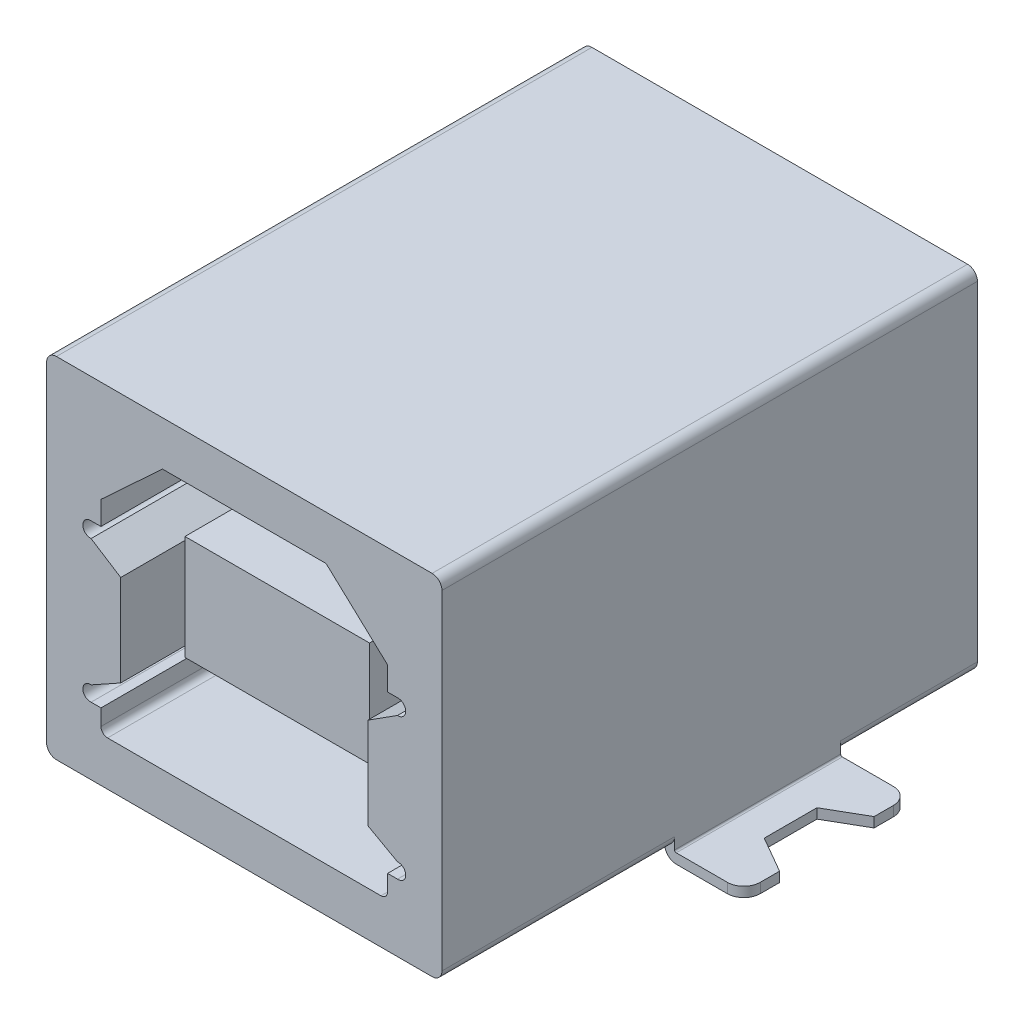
ISO-10303-21;
HEADER;
FILE_DESCRIPTION(('STEP AP214'),'2;1');
FILE_NAME('part.step','',(''),(''),'','','');
FILE_SCHEMA(('AUTOMOTIVE_DESIGN { 1 0 10303 214 1 1 1 1 }'));
ENDSEC;
DATA;
#1=APPLICATION_CONTEXT('core data for automotive mechanical design processes');
#2=APPLICATION_PROTOCOL_DEFINITION('international standard','automotive_design',2000,#1);
#3=PRODUCT_CONTEXT('',#1,'mechanical');
#4=PRODUCT('Part','Part','',(#3));
#5=PRODUCT_RELATED_PRODUCT_CATEGORY('part','',(#4));
#6=PRODUCT_DEFINITION_FORMATION('','',#4);
#7=PRODUCT_DEFINITION_CONTEXT('part definition',#1,'design');
#8=PRODUCT_DEFINITION('design','',#6,#7);
#9=PRODUCT_DEFINITION_SHAPE('','',#8);
#10=(LENGTH_UNIT() NAMED_UNIT(*) SI_UNIT(.MILLI.,.METRE.));
#11=(NAMED_UNIT(*) PLANE_ANGLE_UNIT() SI_UNIT($,.RADIAN.));
#12=(NAMED_UNIT(*) SI_UNIT($,.STERADIAN.) SOLID_ANGLE_UNIT());
#13=UNCERTAINTY_MEASURE_WITH_UNIT(LENGTH_MEASURE(1.E-05),#10,'distance_accuracy_value','');
#14=(GEOMETRIC_REPRESENTATION_CONTEXT(3) GLOBAL_UNCERTAINTY_ASSIGNED_CONTEXT((#13)) GLOBAL_UNIT_ASSIGNED_CONTEXT((#10,
#11,#12)) REPRESENTATION_CONTEXT('',''));
#15=CARTESIAN_POINT('',(0.,0.,0.));
#16=DIRECTION('',(0.,0.,1.));
#17=DIRECTION('',(1.,0.,0.));
#18=AXIS2_PLACEMENT_3D('',#15,#16,#17);
#19=CARTESIAN_POINT('',(0.,4.28465578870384,0.));
#20=DIRECTION('',(0.,0.,-1.));
#21=DIRECTION('',(0.,-1.,0.));
#22=AXIS2_PLACEMENT_3D('',#19,#20,#21);
#23=PLANE('',#22);
#24=CARTESIAN_POINT('',(4.67082532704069,2.26647361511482,0.));
#25=DIRECTION('',(0.,0.,-1.));
#26=DIRECTION('',(-1.,0.,0.));
#27=AXIS2_PLACEMENT_3D('',#24,#25,#26);
#28=CIRCLE('',#27,0.228317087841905);
#29=CARTESIAN_POINT('',(4.64949741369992,2.4937923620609,0.));
#30=VERTEX_POINT('',#29);
#31=CARTESIAN_POINT('',(4.64949741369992,2.03915486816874,0.));
#32=VERTEX_POINT('',#31);
#33=EDGE_CURVE('E1690',#30,#32,#28,.T.);
#34=ORIENTED_EDGE('',*,*,#33,.T.);
#35=DIRECTION('',(-1.,0.,0.));
#36=VECTOR('',#35,1.);
#37=CARTESIAN_POINT('',(2.17474869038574,2.03915486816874,0.));
#38=LINE('',#37,#36);
#39=CARTESIAN_POINT('',(4.34949738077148,2.03915486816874,0.));
#40=VERTEX_POINT('',#39);
#41=EDGE_CURVE('E1279',#32,#40,#38,.T.);
#42=ORIENTED_EDGE('',*,*,#41,.T.);
#43=DIRECTION('',(0.,-1.,0.));
#44=VECTOR('',#43,1.);
#45=CARTESIAN_POINT('',(4.34949738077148,2.91732789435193,0.));
#46=LINE('',#45,#44);
#47=CARTESIAN_POINT('',(4.34949738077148,1.55,0.));
#48=VERTEX_POINT('',#47);
#49=EDGE_CURVE('E862',#40,#48,#46,.T.);
#50=ORIENTED_EDGE('',*,*,#49,.T.);
#51=CARTESIAN_POINT('',(4.14949738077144,1.55000000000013,0.));
#52=DIRECTION('',(0.,0.,-1.));
#53=DIRECTION('',(-1.,0.,0.));
#54=AXIS2_PLACEMENT_3D('',#51,#52,#53);
#55=CIRCLE('',#54,0.200000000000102);
#56=CARTESIAN_POINT('',(4.14949738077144,1.35000000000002,0.));
#57=VERTEX_POINT('',#56);
#58=EDGE_CURVE('E1309',#48,#57,#55,.T.);
#59=ORIENTED_EDGE('',*,*,#58,.T.);
#60=DIRECTION('',(-1.,0.,0.));
#61=VECTOR('',#60,1.);
#62=CARTESIAN_POINT('',(-2.07474869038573,1.35000000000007,0.));
#63=LINE('',#62,#61);
#64=CARTESIAN_POINT('',(-4.14949738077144,1.35000000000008,0.));
#65=VERTEX_POINT('',#64);
#66=EDGE_CURVE('E1499',#57,#65,#63,.T.);
#67=ORIENTED_EDGE('',*,*,#66,.T.);
#68=CARTESIAN_POINT('',(-4.14949738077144,1.55000000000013,0.));
#69=DIRECTION('',(0.,0.,-1.));
#70=DIRECTION('',(-1.,0.,0.));
#71=AXIS2_PLACEMENT_3D('',#68,#69,#70);
#72=CIRCLE('',#71,0.200000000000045);
#73=CARTESIAN_POINT('',(-4.34949738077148,1.55000000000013,0.));
#74=VERTEX_POINT('',#73);
#75=EDGE_CURVE('E927',#65,#74,#72,.T.);
#76=ORIENTED_EDGE('',*,*,#75,.T.);
#77=DIRECTION('',(0.,1.,0.));
#78=VECTOR('',#77,1.);
#79=CARTESIAN_POINT('',(-4.34949738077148,3.16190532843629,0.));
#80=LINE('',#79,#78);
#81=CARTESIAN_POINT('',(-4.34949738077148,2.03915486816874,0.));
#82=VERTEX_POINT('',#81);
#83=EDGE_CURVE('E1788',#74,#82,#80,.T.);
#84=ORIENTED_EDGE('',*,*,#83,.T.);
#85=DIRECTION('',(-1.,0.,0.));
#86=VECTOR('',#85,1.);
#87=CARTESIAN_POINT('',(-2.32474870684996,2.03915486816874,0.));
#88=LINE('',#87,#86);
#89=CARTESIAN_POINT('',(-4.64949741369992,2.03915486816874,0.));
#90=VERTEX_POINT('',#89);
#91=EDGE_CURVE('E1307',#82,#90,#88,.T.);
#92=ORIENTED_EDGE('',*,*,#91,.T.);
#93=CARTESIAN_POINT('',(-4.67082532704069,2.26647361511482,0.));
#94=DIRECTION('',(0.,0.,-1.));
#95=DIRECTION('',(-1.,0.,0.));
#96=AXIS2_PLACEMENT_3D('',#93,#94,#95);
#97=CIRCLE('',#96,0.228317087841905);
#98=CARTESIAN_POINT('',(-4.64949741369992,2.4937923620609,0.));
#99=VERTEX_POINT('',#98);
#100=EDGE_CURVE('E1099',#90,#99,#97,.T.);
#101=ORIENTED_EDGE('',*,*,#100,.T.);
#102=DIRECTION('',(0.874151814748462,0.485652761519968,0.));
#103=VECTOR('',#102,1.);
#104=CARTESIAN_POINT('',(-2.04317056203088,3.94179008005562,0.));
#105=LINE('',#104,#103);
#106=CARTESIAN_POINT('',(-3.75,2.99352638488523,0.));
#107=VERTEX_POINT('',#106);
#108=EDGE_CURVE('E1308',#99,#107,#105,.T.);
#109=ORIENTED_EDGE('',*,*,#108,.T.);
#110=DIRECTION('',(0.,1.,0.));
#111=VECTOR('',#110,1.);
#112=CARTESIAN_POINT('',(-3.75,5.02556470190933,0.));
#113=LINE('',#112,#111);
#114=CARTESIAN_POINT('',(-3.75,5.76647361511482,0.));
#115=VERTEX_POINT('',#114);
#116=EDGE_CURVE('E1901',#107,#115,#113,.T.);
#117=ORIENTED_EDGE('',*,*,#116,.T.);
#118=DIRECTION('',(-0.843387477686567,0.537305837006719,0.));
#119=VECTOR('',#118,1.);
#120=CARTESIAN_POINT('',(-2.53055985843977,4.98959190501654,0.));
#121=LINE('',#120,#119);
#122=CARTESIAN_POINT('',(-4.65000000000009,6.33984619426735,0.));
#123=VERTEX_POINT('',#122);
#124=EDGE_CURVE('E1779',#115,#123,#121,.T.);
#125=ORIENTED_EDGE('',*,*,#124,.T.);
#126=CARTESIAN_POINT('',(-4.66555117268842,6.57291920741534,0.));
#127=DIRECTION('',(0.,0.,-1.));
#128=DIRECTION('',(-1.,0.,0.));
#129=AXIS2_PLACEMENT_3D('',#126,#127,#128);
#130=CIRCLE('',#129,0.233591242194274);
#131=CARTESIAN_POINT('',(-4.65000000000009,6.80599222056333,0.));
#132=VERTEX_POINT('',#131);
#133=EDGE_CURVE('E1602',#123,#132,#130,.T.);
#134=ORIENTED_EDGE('',*,*,#133,.T.);
#135=DIRECTION('',(1.,0.,0.));
#136=VECTOR('',#135,1.);
#137=CARTESIAN_POINT('',(-2.17499999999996,6.80599222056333,0.));
#138=LINE('',#137,#136);
#139=CARTESIAN_POINT('',(-4.34999999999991,6.80599222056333,0.));
#140=VERTEX_POINT('',#139);
#141=EDGE_CURVE('E1689',#132,#140,#138,.T.);
#142=ORIENTED_EDGE('',*,*,#141,.T.);
#143=DIRECTION('',(0.,1.,0.));
#144=VECTOR('',#143,1.);
#145=CARTESIAN_POINT('',(-4.34999999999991,5.90183387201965,0.));
#146=LINE('',#145,#144);
#147=CARTESIAN_POINT('',(-4.34999999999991,7.51901195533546,0.));
#148=VERTEX_POINT('',#147);
#149=EDGE_CURVE('E1260',#140,#148,#146,.T.);
#150=ORIENTED_EDGE('',*,*,#149,.T.);
#151=DIRECTION('',(0.733430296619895,0.679764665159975,0.));
#152=VECTOR('',#151,1.);
#153=CARTESIAN_POINT('',(-3.0524618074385,8.72160832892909,0.));
#154=LINE('',#153,#152);
#155=CARTESIAN_POINT('',(-2.48235500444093,9.25,0.));
#156=VERTEX_POINT('',#155);
#157=EDGE_CURVE('E1629',#148,#156,#154,.T.);
#158=ORIENTED_EDGE('',*,*,#157,.T.);
#159=DIRECTION('',(1.,0.,0.));
#160=VECTOR('',#159,1.);
#161=CARTESIAN_POINT('',(1.24117750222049,9.25,0.));
#162=LINE('',#161,#160);
#163=CARTESIAN_POINT('',(2.48235500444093,9.25,0.));
#164=VERTEX_POINT('',#163);
#165=EDGE_CURVE('E1554',#156,#164,#162,.T.);
#166=ORIENTED_EDGE('',*,*,#165,.T.);
#167=DIRECTION('',(0.733430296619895,-0.679764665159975,0.));
#168=VECTOR('',#167,1.);
#169=CARTESIAN_POINT('',(3.98628430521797,7.85611430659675,0.));
#170=LINE('',#169,#168);
#171=CARTESIAN_POINT('',(4.34999999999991,7.5190119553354,0.));
#172=VERTEX_POINT('',#171);
#173=EDGE_CURVE('E1445',#164,#172,#170,.T.);
#174=ORIENTED_EDGE('',*,*,#173,.T.);
#175=DIRECTION('',(0.,-1.,0.));
#176=VECTOR('',#175,1.);
#177=CARTESIAN_POINT('',(4.34999999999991,5.54532400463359,0.));
#178=LINE('',#177,#176);
#179=CARTESIAN_POINT('',(4.34999999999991,6.80599222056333,0.));
#180=VERTEX_POINT('',#179);
#181=EDGE_CURVE('E1722',#172,#180,#178,.T.);
#182=ORIENTED_EDGE('',*,*,#181,.T.);
#183=DIRECTION('',(1.,0.,0.));
#184=VECTOR('',#183,1.);
#185=CARTESIAN_POINT('',(2.32500000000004,6.80599222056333,0.));
#186=LINE('',#185,#184);
#187=CARTESIAN_POINT('',(4.65000000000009,6.80599222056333,0.));
#188=VERTEX_POINT('',#187);
#189=EDGE_CURVE('E1330',#180,#188,#186,.T.);
#190=ORIENTED_EDGE('',*,*,#189,.T.);
#191=CARTESIAN_POINT('',(4.66555117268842,6.57291920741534,0.));
#192=DIRECTION('',(0.,0.,-1.));
#193=DIRECTION('',(-1.,0.,0.));
#194=AXIS2_PLACEMENT_3D('',#191,#192,#193);
#195=CIRCLE('',#194,0.233591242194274);
#196=CARTESIAN_POINT('',(4.65000000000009,6.33984619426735,0.));
#197=VERTEX_POINT('',#196);
#198=EDGE_CURVE('E1030',#188,#197,#195,.T.);
#199=ORIENTED_EDGE('',*,*,#198,.T.);
#200=DIRECTION('',(-0.843387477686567,-0.537305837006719,0.));
#201=VECTOR('',#200,1.);
#202=CARTESIAN_POINT('',(2.08055985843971,4.70290561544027,0.));
#203=LINE('',#202,#201);
#204=CARTESIAN_POINT('',(3.75,5.76647361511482,0.));
#205=VERTEX_POINT('',#204);
#206=EDGE_CURVE('E1797',#197,#205,#203,.T.);
#207=ORIENTED_EDGE('',*,*,#206,.T.);
#208=DIRECTION('',(0.,-1.,0.));
#209=VECTOR('',#208,1.);
#210=CARTESIAN_POINT('',(3.75,3.63909108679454,0.));
#211=LINE('',#210,#209);
#212=CARTESIAN_POINT('',(3.75,2.99352638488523,0.));
#213=VERTEX_POINT('',#212);
#214=EDGE_CURVE('E1274',#205,#213,#211,.T.);
#215=ORIENTED_EDGE('',*,*,#214,.T.);
#216=DIRECTION('',(0.874151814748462,-0.485652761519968,0.));
#217=VECTOR('',#216,1.);
#218=CARTESIAN_POINT('',(2.49291926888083,3.69192306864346,0.));
#219=LINE('',#218,#217);
#220=EDGE_CURVE('E1780',#213,#30,#219,.T.);
#221=ORIENTED_EDGE('',*,*,#220,.T.);
#222=EDGE_LOOP('',(#34,#42,#50,#59,#67,#76,#84,#92,#101,#109,#117,#125,#134,#142,#150,#158,#166,
#174,#182,#190,#199,#207,#215,#221));
#223=FACE_BOUND('',#222,.T.);
#224=CARTESIAN_POINT('',(5.69999999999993,0.300000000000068,0.));
#225=DIRECTION('',(0.,0.,1.));
#226=DIRECTION('',(-1.,0.,0.));
#227=AXIS2_PLACEMENT_3D('',#224,#225,#226);
#228=CIRCLE('',#227,0.300000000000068);
#229=CARTESIAN_POINT('',(5.7,0.,0.));
#230=VERTEX_POINT('',#229);
#231=CARTESIAN_POINT('',(6.00000000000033,0.300000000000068,0.));
#232=VERTEX_POINT('',#231);
#233=EDGE_CURVE('E1717',#230,#232,#228,.T.);
#234=ORIENTED_EDGE('',*,*,#233,.T.);
#235=DIRECTION('',(0.,1.,0.));
#236=VECTOR('',#235,1.);
#237=CARTESIAN_POINT('',(6.00000000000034,-0.0500000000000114,0.));
#238=LINE('',#237,#236);
#239=CARTESIAN_POINT('',(6.,10.3,0.));
#240=VERTEX_POINT('',#239);
#241=EDGE_CURVE('E1561',#232,#240,#238,.T.);
#242=ORIENTED_EDGE('',*,*,#241,.T.);
#243=CARTESIAN_POINT('',(5.69999999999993,10.3,0.));
#244=DIRECTION('',(0.,0.,-1.));
#245=DIRECTION('',(-1.,0.,0.));
#246=AXIS2_PLACEMENT_3D('',#243,#244,#245);
#247=CIRCLE('',#246,0.300000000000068);
#248=CARTESIAN_POINT('',(5.7,10.6,0.));
#249=VERTEX_POINT('',#248);
#250=EDGE_CURVE('E1572',#249,#240,#247,.T.);
#251=ORIENTED_EDGE('',*,*,#250,.F.);
#252=DIRECTION('',(-1.,0.,0.));
#253=VECTOR('',#252,1.);
#254=CARTESIAN_POINT('',(5.7,10.6,0.));
#255=LINE('',#254,#253);
#256=CARTESIAN_POINT('',(-5.7,10.6,0.));
#257=VERTEX_POINT('',#256);
#258=EDGE_CURVE('E1659',#249,#257,#255,.T.);
#259=ORIENTED_EDGE('',*,*,#258,.T.);
#260=CARTESIAN_POINT('',(-5.69999999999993,10.3,0.));
#261=DIRECTION('',(0.,0.,-1.));
#262=DIRECTION('',(-1.,0.,0.));
#263=AXIS2_PLACEMENT_3D('',#260,#261,#262);
#264=CIRCLE('',#263,0.300000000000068);
#265=CARTESIAN_POINT('',(-6.,10.3,0.));
#266=VERTEX_POINT('',#265);
#267=EDGE_CURVE('E26',#266,#257,#264,.T.);
#268=ORIENTED_EDGE('',*,*,#267,.F.);
#269=DIRECTION('',(0.,1.,0.));
#270=VECTOR('',#269,1.);
#271=CARTESIAN_POINT('',(-6.00000000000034,-0.0500000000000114,0.));
#272=LINE('',#271,#270);
#273=CARTESIAN_POINT('',(-6.00000000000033,0.300000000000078,0.));
#274=VERTEX_POINT('',#273);
#275=EDGE_CURVE('E10',#274,#266,#272,.T.);
#276=ORIENTED_EDGE('',*,*,#275,.F.);
#277=CARTESIAN_POINT('',(-5.69999999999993,0.300000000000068,0.));
#278=DIRECTION('',(0.,0.,1.));
#279=DIRECTION('',(-1.,0.,0.));
#280=AXIS2_PLACEMENT_3D('',#277,#278,#279);
#281=CIRCLE('',#280,0.300000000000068);
#282=CARTESIAN_POINT('',(-5.7,0.,0.));
#283=VERTEX_POINT('',#282);
#284=EDGE_CURVE('E1083',#274,#283,#281,.T.);
#285=ORIENTED_EDGE('',*,*,#284,.T.);
#286=DIRECTION('',(-1.,0.,0.));
#287=VECTOR('',#286,1.);
#288=CARTESIAN_POINT('',(5.7,0.,0.));
#289=LINE('',#288,#287);
#290=EDGE_CURVE('E1379',#230,#283,#289,.T.);
#291=ORIENTED_EDGE('',*,*,#290,.F.);
#292=EDGE_LOOP('',(#234,#242,#251,#259,#268,#276,#285,#291));
#293=FACE_BOUND('',#292,.T.);
#294=ADVANCED_FACE('F15',(#223,#293),#23,.F.);
#295=CARTESIAN_POINT('',(-6.,10.3,0.));
#296=DIRECTION('',(-1.,0.,0.));
#297=DIRECTION('',(0.,0.,1.));
#298=AXIS2_PLACEMENT_3D('',#295,#296,#297);
#299=PLANE('',#298);
#300=DIRECTION('',(0.,-1.,0.));
#301=VECTOR('',#300,1.);
#302=CARTESIAN_POINT('',(-6.00000000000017,4.99049815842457,-12.1));
#303=LINE('',#302,#301);
#304=CARTESIAN_POINT('',(-6.,0.300000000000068,-12.1));
#305=VERTEX_POINT('',#304);
#306=CARTESIAN_POINT('',(-6.00000000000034,-0.0500000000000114,-12.1));
#307=VERTEX_POINT('',#306);
#308=EDGE_CURVE('E1122',#305,#307,#303,.T.);
#309=ORIENTED_EDGE('',*,*,#308,.T.);
#310=DIRECTION('',(0.,0.,-1.));
#311=VECTOR('',#310,1.);
#312=CARTESIAN_POINT('',(-6.00000000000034,-0.0500000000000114,0.));
#313=LINE('',#312,#311);
#314=CARTESIAN_POINT('',(-6.00000000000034,-0.0500000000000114,-7.06));
#315=VERTEX_POINT('',#314);
#316=EDGE_CURVE('E1376',#315,#307,#313,.T.);
#317=ORIENTED_EDGE('',*,*,#316,.F.);
#318=DIRECTION('',(0.,1.,0.));
#319=VECTOR('',#318,1.);
#320=CARTESIAN_POINT('',(-6.00000000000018,4.99049815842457,-7.06));
#321=LINE('',#320,#319);
#322=CARTESIAN_POINT('',(-6.,0.300000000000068,-7.06));
#323=VERTEX_POINT('',#322);
#324=EDGE_CURVE('E1790',#315,#323,#321,.T.);
#325=ORIENTED_EDGE('',*,*,#324,.T.);
#326=DIRECTION('',(0.,0.,1.));
#327=VECTOR('',#326,1.);
#328=CARTESIAN_POINT('',(-6.00000000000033,0.300000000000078,-3.53));
#329=LINE('',#328,#327);
#330=EDGE_CURVE('E1079',#323,#274,#329,.T.);
#331=ORIENTED_EDGE('',*,*,#330,.T.);
#332=ORIENTED_EDGE('',*,*,#275,.T.);
#333=DIRECTION('',(0.,0.,-1.));
#334=VECTOR('',#333,1.);
#335=CARTESIAN_POINT('',(-6.,10.3,0.));
#336=LINE('',#335,#334);
#337=CARTESIAN_POINT('',(-6.,10.3,-16.25));
#338=VERTEX_POINT('',#337);
#339=EDGE_CURVE('E1189',#266,#338,#336,.T.);
#340=ORIENTED_EDGE('',*,*,#339,.T.);
#341=DIRECTION('',(0.,-1.,0.));
#342=VECTOR('',#341,1.);
#343=CARTESIAN_POINT('',(-6.00000000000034,-0.0500000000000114,-16.25));
#344=LINE('',#343,#342);
#345=CARTESIAN_POINT('',(-6.00000000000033,0.300000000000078,-16.25));
#346=VERTEX_POINT('',#345);
#347=EDGE_CURVE('E1404',#338,#346,#344,.T.);
#348=ORIENTED_EDGE('',*,*,#347,.T.);
#349=DIRECTION('',(0.,0.,1.));
#350=VECTOR('',#349,1.);
#351=CARTESIAN_POINT('',(-6.00000000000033,0.300000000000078,-14.175));
#352=LINE('',#351,#350);
#353=EDGE_CURVE('E1399',#346,#305,#352,.T.);
#354=ORIENTED_EDGE('',*,*,#353,.T.);
#355=EDGE_LOOP('',(#309,#317,#325,#331,#332,#340,#348,#354));
#356=FACE_BOUND('',#355,.T.);
#357=ADVANCED_FACE('F2631',(#356),#299,.T.);
#358=CARTESIAN_POINT('',(-5.69999999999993,10.3,0.));
#359=DIRECTION('',(0.,0.,1.));
#360=DIRECTION('',(-1.,0.,0.));
#361=AXIS2_PLACEMENT_3D('',#358,#359,#360);
#362=CYLINDRICAL_SURFACE('',#361,0.300000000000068);
#363=CARTESIAN_POINT('',(-5.69999999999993,10.3,-16.25));
#364=DIRECTION('',(0.,0.,1.));
#365=DIRECTION('',(-1.,0.,0.));
#366=AXIS2_PLACEMENT_3D('',#363,#364,#365);
#367=CIRCLE('',#366,0.300000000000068);
#368=CARTESIAN_POINT('',(-5.7,10.6,-16.25));
#369=VERTEX_POINT('',#368);
#370=EDGE_CURVE('E968',#369,#338,#367,.T.);
#371=ORIENTED_EDGE('',*,*,#370,.T.);
#372=ORIENTED_EDGE('',*,*,#339,.F.);
#373=ORIENTED_EDGE('',*,*,#267,.T.);
#374=DIRECTION('',(0.,0.,-1.));
#375=VECTOR('',#374,1.);
#376=CARTESIAN_POINT('',(-5.7,10.6,0.));
#377=LINE('',#376,#375);
#378=EDGE_CURVE('E1656',#257,#369,#377,.T.);
#379=ORIENTED_EDGE('',*,*,#378,.T.);
#380=EDGE_LOOP('',(#371,#372,#373,#379));
#381=FACE_BOUND('',#380,.T.);
#382=ADVANCED_FACE('F2636',(#381),#362,.T.);
#383=CARTESIAN_POINT('',(5.7,10.6,0.));
#384=DIRECTION('',(0.,1.,0.));
#385=DIRECTION('',(1.,0.,0.));
#386=AXIS2_PLACEMENT_3D('',#383,#384,#385);
#387=PLANE('',#386);
#388=DIRECTION('',(-1.,0.,0.));
#389=VECTOR('',#388,1.);
#390=CARTESIAN_POINT('',(5.7,10.6,-16.25));
#391=LINE('',#390,#389);
#392=CARTESIAN_POINT('',(5.7,10.6,-16.25));
#393=VERTEX_POINT('',#392);
#394=EDGE_CURVE('E963',#393,#369,#391,.T.);
#395=ORIENTED_EDGE('',*,*,#394,.T.);
#396=ORIENTED_EDGE('',*,*,#378,.F.);
#397=ORIENTED_EDGE('',*,*,#258,.F.);
#398=DIRECTION('',(0.,0.,-1.));
#399=VECTOR('',#398,1.);
#400=CARTESIAN_POINT('',(5.7,10.6,0.));
#401=LINE('',#400,#399);
#402=EDGE_CURVE('E1565',#249,#393,#401,.T.);
#403=ORIENTED_EDGE('',*,*,#402,.T.);
#404=EDGE_LOOP('',(#395,#396,#397,#403));
#405=FACE_BOUND('',#404,.T.);
#406=ADVANCED_FACE('F2827',(#405),#387,.T.);
#407=CARTESIAN_POINT('',(5.69999999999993,10.3,0.));
#408=DIRECTION('',(0.,0.,1.));
#409=DIRECTION('',(-1.,0.,0.));
#410=AXIS2_PLACEMENT_3D('',#407,#408,#409);
#411=CYLINDRICAL_SURFACE('',#410,0.300000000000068);
#412=CARTESIAN_POINT('',(5.69999999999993,10.3,-16.25));
#413=DIRECTION('',(0.,0.,1.));
#414=DIRECTION('',(-1.,0.,0.));
#415=AXIS2_PLACEMENT_3D('',#412,#413,#414);
#416=CIRCLE('',#415,0.300000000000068);
#417=CARTESIAN_POINT('',(6.,10.3,-16.25));
#418=VERTEX_POINT('',#417);
#419=EDGE_CURVE('E967',#418,#393,#416,.T.);
#420=ORIENTED_EDGE('',*,*,#419,.T.);
#421=ORIENTED_EDGE('',*,*,#402,.F.);
#422=ORIENTED_EDGE('',*,*,#250,.T.);
#423=DIRECTION('',(0.,0.,-1.));
#424=VECTOR('',#423,1.);
#425=CARTESIAN_POINT('',(6.,10.3,0.));
#426=LINE('',#425,#424);
#427=EDGE_CURVE('E1385',#240,#418,#426,.T.);
#428=ORIENTED_EDGE('',*,*,#427,.T.);
#429=EDGE_LOOP('',(#420,#421,#422,#428));
#430=FACE_BOUND('',#429,.T.);
#431=ADVANCED_FACE('F2824',(#430),#411,.T.);
#432=CARTESIAN_POINT('',(6.00000000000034,-0.0500000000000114,0.));
#433=DIRECTION('',(1.,0.,0.));
#434=DIRECTION('',(0.,1.,0.));
#435=AXIS2_PLACEMENT_3D('',#432,#433,#434);
#436=PLANE('',#435);
#437=DIRECTION('',(0.,0.,-1.));
#438=VECTOR('',#437,1.);
#439=CARTESIAN_POINT('',(6.,0.300000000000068,-6.05));
#440=LINE('',#439,#438);
#441=CARTESIAN_POINT('',(6.,0.300000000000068,-12.1));
#442=VERTEX_POINT('',#441);
#443=CARTESIAN_POINT('',(6.00000000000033,0.300000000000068,-16.25));
#444=VERTEX_POINT('',#443);
#445=EDGE_CURVE('E1556',#442,#444,#440,.T.);
#446=ORIENTED_EDGE('',*,*,#445,.T.);
#447=DIRECTION('',(0.,1.,0.));
#448=VECTOR('',#447,1.);
#449=CARTESIAN_POINT('',(6.00000000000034,-0.0500000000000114,-16.25));
#450=LINE('',#449,#448);
#451=EDGE_CURVE('E1761',#444,#418,#450,.T.);
#452=ORIENTED_EDGE('',*,*,#451,.T.);
#453=ORIENTED_EDGE('',*,*,#427,.F.);
#454=ORIENTED_EDGE('',*,*,#241,.F.);
#455=DIRECTION('',(0.,0.,-1.));
#456=VECTOR('',#455,1.);
#457=CARTESIAN_POINT('',(6.,0.300000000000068,0.5));
#458=LINE('',#457,#456);
#459=CARTESIAN_POINT('',(6.,0.300000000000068,-7.06));
#460=VERTEX_POINT('',#459);
#461=EDGE_CURVE('E1716',#232,#460,#458,.T.);
#462=ORIENTED_EDGE('',*,*,#461,.T.);
#463=DIRECTION('',(0.,-1.,0.));
#464=VECTOR('',#463,1.);
#465=CARTESIAN_POINT('',(6.00000000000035,-0.1845018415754,-7.06));
#466=LINE('',#465,#464);
#467=CARTESIAN_POINT('',(6.00000000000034,-0.0500000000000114,-7.06));
#468=VERTEX_POINT('',#467);
#469=EDGE_CURVE('E1452',#460,#468,#466,.T.);
#470=ORIENTED_EDGE('',*,*,#469,.T.);
#471=DIRECTION('',(0.,0.,-1.));
#472=VECTOR('',#471,1.);
#473=CARTESIAN_POINT('',(6.00000000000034,-0.0500000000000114,0.));
#474=LINE('',#473,#472);
#475=CARTESIAN_POINT('',(6.00000000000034,-0.0500000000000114,-12.1));
#476=VERTEX_POINT('',#475);
#477=EDGE_CURVE('E1381',#468,#476,#474,.T.);
#478=ORIENTED_EDGE('',*,*,#477,.T.);
#479=DIRECTION('',(0.,1.,0.));
#480=VECTOR('',#479,1.);
#481=CARTESIAN_POINT('',(6.00000000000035,-0.1845018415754,-12.1));
#482=LINE('',#481,#480);
#483=EDGE_CURVE('E1001',#476,#442,#482,.T.);
#484=ORIENTED_EDGE('',*,*,#483,.T.);
#485=EDGE_LOOP('',(#446,#452,#453,#454,#462,#470,#478,#484));
#486=FACE_BOUND('',#485,.T.);
#487=ADVANCED_FACE('F2809',(#486),#436,.T.);
#488=CARTESIAN_POINT('',(6.05000000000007,-0.0500000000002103,0.));
#489=DIRECTION('',(0.,0.,1.));
#490=DIRECTION('',(-1.,0.,0.));
#491=AXIS2_PLACEMENT_3D('',#488,#489,#490);
#492=CYLINDRICAL_SURFACE('',#491,0.0499999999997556);
#493=CARTESIAN_POINT('',(6.05000000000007,-0.0500000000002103,-12.1));
#494=DIRECTION('',(0.,0.,-1.));
#495=DIRECTION('',(-1.,0.,0.));
#496=AXIS2_PLACEMENT_3D('',#493,#494,#495);
#497=CIRCLE('',#496,0.0499999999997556);
#498=CARTESIAN_POINT('',(6.05000000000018,-0.0999999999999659,-12.1));
#499=VERTEX_POINT('',#498);
#500=EDGE_CURVE('E1491',#499,#476,#497,.T.);
#501=ORIENTED_EDGE('',*,*,#500,.T.);
#502=ORIENTED_EDGE('',*,*,#477,.F.);
#503=CARTESIAN_POINT('',(6.05000000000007,-0.0500000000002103,-7.06));
#504=DIRECTION('',(0.,0.,1.));
#505=DIRECTION('',(-1.,0.,0.));
#506=AXIS2_PLACEMENT_3D('',#503,#504,#505);
#507=CIRCLE('',#506,0.0499999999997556);
#508=CARTESIAN_POINT('',(6.05000000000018,-0.0999999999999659,-7.06));
#509=VERTEX_POINT('',#508);
#510=EDGE_CURVE('E1456',#468,#509,#507,.T.);
#511=ORIENTED_EDGE('',*,*,#510,.T.);
#512=DIRECTION('',(0.,0.,-1.));
#513=VECTOR('',#512,1.);
#514=CARTESIAN_POINT('',(6.05000000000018,-0.0999999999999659,0.));
#515=LINE('',#514,#513);
#516=EDGE_CURVE('E1017',#509,#499,#515,.T.);
#517=ORIENTED_EDGE('',*,*,#516,.T.);
#518=EDGE_LOOP('',(#501,#502,#511,#517));
#519=FACE_BOUND('',#518,.T.);
#520=ADVANCED_FACE('F2806',(#519),#492,.F.);
#521=CARTESIAN_POINT('',(-5.7,0.,0.));
#522=DIRECTION('',(0.,-1.,0.));
#523=DIRECTION('',(0.,0.,-1.));
#524=AXIS2_PLACEMENT_3D('',#521,#522,#523);
#525=PLANE('',#524);
#526=DIRECTION('',(1.,0.,0.));
#527=VECTOR('',#526,1.);
#528=CARTESIAN_POINT('',(-1.00000000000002,0.,-2.));
#529=LINE('',#528,#527);
#530=CARTESIAN_POINT('',(3.5,0.,-2.));
#531=VERTEX_POINT('',#530);
#532=CARTESIAN_POINT('',(3.9,0.,-2.));
#533=VERTEX_POINT('',#532);
#534=EDGE_CURVE('E1047',#531,#533,#529,.T.);
#535=ORIENTED_EDGE('',*,*,#534,.T.);
#536=DIRECTION('',(0.,0.,-1.));
#537=VECTOR('',#536,1.);
#538=CARTESIAN_POINT('',(3.9,0.,-3.2625));
#539=LINE('',#538,#537);
#540=CARTESIAN_POINT('',(3.9,0.,-11.05));
#541=VERTEX_POINT('',#540);
#542=EDGE_CURVE('E1039',#533,#541,#539,.T.);
#543=ORIENTED_EDGE('',*,*,#542,.T.);
#544=DIRECTION('',(-1.,0.,0.));
#545=VECTOR('',#544,1.);
#546=CARTESIAN_POINT('',(-1.00000000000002,0.,-11.05));
#547=LINE('',#546,#545);
#548=CARTESIAN_POINT('',(3.5,0.,-11.05));
#549=VERTEX_POINT('',#548);
#550=EDGE_CURVE('E1168',#541,#549,#547,.T.);
#551=ORIENTED_EDGE('',*,*,#550,.T.);
#552=DIRECTION('',(0.,0.,1.));
#553=VECTOR('',#552,1.);
#554=CARTESIAN_POINT('',(3.5,0.,-3.2625));
#555=LINE('',#554,#553);
#556=EDGE_CURVE('E1411',#549,#531,#555,.T.);
#557=ORIENTED_EDGE('',*,*,#556,.T.);
#558=EDGE_LOOP('',(#535,#543,#551,#557));
#559=FACE_BOUND('',#558,.T.);
#560=DIRECTION('',(1.,0.,0.));
#561=VECTOR('',#560,1.);
#562=CARTESIAN_POINT('',(-4.7,0.,-2.));
#563=LINE('',#562,#561);
#564=CARTESIAN_POINT('',(-3.9,0.,-2.));
#565=VERTEX_POINT('',#564);
#566=CARTESIAN_POINT('',(-3.5,0.,-2.));
#567=VERTEX_POINT('',#566);
#568=EDGE_CURVE('E1070',#565,#567,#563,.T.);
#569=ORIENTED_EDGE('',*,*,#568,.T.);
#570=DIRECTION('',(0.,0.,-1.));
#571=VECTOR('',#570,1.);
#572=CARTESIAN_POINT('',(-3.5,0.,-3.2625));
#573=LINE('',#572,#571);
#574=CARTESIAN_POINT('',(-3.5,0.,-11.05));
#575=VERTEX_POINT('',#574);
#576=EDGE_CURVE('E1703',#567,#575,#573,.T.);
#577=ORIENTED_EDGE('',*,*,#576,.T.);
#578=DIRECTION('',(-1.,0.,0.));
#579=VECTOR('',#578,1.);
#580=CARTESIAN_POINT('',(-4.7,0.,-11.05));
#581=LINE('',#580,#579);
#582=CARTESIAN_POINT('',(-3.9,0.,-11.05));
#583=VERTEX_POINT('',#582);
#584=EDGE_CURVE('E950',#575,#583,#581,.T.);
#585=ORIENTED_EDGE('',*,*,#584,.T.);
#586=DIRECTION('',(0.,0.,1.));
#587=VECTOR('',#586,1.);
#588=CARTESIAN_POINT('',(-3.9,0.,-3.2625));
#589=LINE('',#588,#587);
#590=EDGE_CURVE('E1036',#583,#565,#589,.T.);
#591=ORIENTED_EDGE('',*,*,#590,.T.);
#592=EDGE_LOOP('',(#569,#577,#585,#591));
#593=FACE_BOUND('',#592,.T.);
#594=DIRECTION('',(0.,0.,1.));
#595=VECTOR('',#594,1.);
#596=CARTESIAN_POINT('',(1.575,0.,-8.2));
#597=LINE('',#596,#595);
#598=CARTESIAN_POINT('',(1.575,0.,-15.4));
#599=VERTEX_POINT('',#598);
#600=CARTESIAN_POINT('',(1.575,0.,-15.15));
#601=VERTEX_POINT('',#600);
#602=EDGE_CURVE('E1074',#599,#601,#597,.T.);
#603=ORIENTED_EDGE('',*,*,#602,.T.);
#604=DIRECTION('',(1.,0.,0.));
#605=VECTOR('',#604,1.);
#606=CARTESIAN_POINT('',(-2.1125,0.,-15.15));
#607=LINE('',#606,#605);
#608=CARTESIAN_POINT('',(2.175,0.,-15.15));
#609=VERTEX_POINT('',#608);
#610=EDGE_CURVE('E1982',#601,#609,#607,.T.);
#611=ORIENTED_EDGE('',*,*,#610,.T.);
#612=DIRECTION('',(0.,0.,-1.));
#613=VECTOR('',#612,1.);
#614=CARTESIAN_POINT('',(2.175,0.,-7.4361989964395));
#615=LINE('',#614,#613);
#616=CARTESIAN_POINT('',(2.175,0.,-15.4));
#617=VERTEX_POINT('',#616);
#618=EDGE_CURVE('E2115',#609,#617,#615,.T.);
#619=ORIENTED_EDGE('',*,*,#618,.T.);
#620=DIRECTION('',(-1.,0.,0.));
#621=VECTOR('',#620,1.);
#622=CARTESIAN_POINT('',(-2.1125,0.,-15.4));
#623=LINE('',#622,#621);
#624=EDGE_CURVE('E1167',#617,#599,#623,.T.);
#625=ORIENTED_EDGE('',*,*,#624,.T.);
#626=EDGE_LOOP('',(#603,#611,#619,#625));
#627=FACE_BOUND('',#626,.T.);
#628=DIRECTION('',(0.,0.,1.));
#629=VECTOR('',#628,1.);
#630=CARTESIAN_POINT('',(0.325000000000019,0.,-8.2));
#631=LINE('',#630,#629);
#632=CARTESIAN_POINT('',(0.325000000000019,0.,-15.4));
#633=VERTEX_POINT('',#632);
#634=CARTESIAN_POINT('',(0.325000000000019,0.,-15.15));
#635=VERTEX_POINT('',#634);
#636=EDGE_CURVE('E921',#633,#635,#631,.T.);
#637=ORIENTED_EDGE('',*,*,#636,.T.);
#638=DIRECTION('',(1.,0.,0.));
#639=VECTOR('',#638,1.);
#640=CARTESIAN_POINT('',(-2.7375,0.,-15.15));
#641=LINE('',#640,#639);
#642=CARTESIAN_POINT('',(0.925000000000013,0.,-15.15));
#643=VERTEX_POINT('',#642);
#644=EDGE_CURVE('E939',#635,#643,#641,.T.);
#645=ORIENTED_EDGE('',*,*,#644,.T.);
#646=DIRECTION('',(0.,0.,-1.));
#647=VECTOR('',#646,1.);
#648=CARTESIAN_POINT('',(0.925000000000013,0.,-7.4361989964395));
#649=LINE('',#648,#647);
#650=CARTESIAN_POINT('',(0.925000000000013,0.,-15.4));
#651=VERTEX_POINT('',#650);
#652=EDGE_CURVE('E1022',#643,#651,#649,.T.);
#653=ORIENTED_EDGE('',*,*,#652,.T.);
#654=DIRECTION('',(-1.,0.,0.));
#655=VECTOR('',#654,1.);
#656=CARTESIAN_POINT('',(-2.7375,0.,-15.4));
#657=LINE('',#656,#655);
#658=EDGE_CURVE('E1470',#651,#633,#657,.T.);
#659=ORIENTED_EDGE('',*,*,#658,.T.);
#660=EDGE_LOOP('',(#637,#645,#653,#659));
#661=FACE_BOUND('',#660,.T.);
#662=DIRECTION('',(0.,0.,1.));
#663=VECTOR('',#662,1.);
#664=CARTESIAN_POINT('',(-0.924999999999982,0.,-8.2));
#665=LINE('',#664,#663);
#666=CARTESIAN_POINT('',(-0.924999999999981,0.,-15.4));
#667=VERTEX_POINT('',#666);
#668=CARTESIAN_POINT('',(-0.924999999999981,0.,-15.15));
#669=VERTEX_POINT('',#668);
#670=EDGE_CURVE('E956',#667,#669,#665,.T.);
#671=ORIENTED_EDGE('',*,*,#670,.T.);
#672=DIRECTION('',(1.,0.,0.));
#673=VECTOR('',#672,1.);
#674=CARTESIAN_POINT('',(-3.3625,0.,-15.15));
#675=LINE('',#674,#673);
#676=CARTESIAN_POINT('',(-0.324999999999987,0.,-15.15));
#677=VERTEX_POINT('',#676);
#678=EDGE_CURVE('E1202',#669,#677,#675,.T.);
#679=ORIENTED_EDGE('',*,*,#678,.T.);
#680=DIRECTION('',(0.,0.,-1.));
#681=VECTOR('',#680,1.);
#682=CARTESIAN_POINT('',(-0.324999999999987,0.,-7.4361989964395));
#683=LINE('',#682,#681);
#684=CARTESIAN_POINT('',(-0.324999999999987,0.,-15.4));
#685=VERTEX_POINT('',#684);
#686=EDGE_CURVE('E961',#677,#685,#683,.T.);
#687=ORIENTED_EDGE('',*,*,#686,.T.);
#688=DIRECTION('',(-1.,0.,0.));
#689=VECTOR('',#688,1.);
#690=CARTESIAN_POINT('',(-3.3625,0.,-15.4));
#691=LINE('',#690,#689);
#692=EDGE_CURVE('E1533',#685,#667,#691,.T.);
#693=ORIENTED_EDGE('',*,*,#692,.T.);
#694=EDGE_LOOP('',(#671,#679,#687,#693));
#695=FACE_BOUND('',#694,.T.);
#696=DIRECTION('',(0.,0.,1.));
#697=VECTOR('',#696,1.);
#698=CARTESIAN_POINT('',(-2.175,0.,-8.2));
#699=LINE('',#698,#697);
#700=CARTESIAN_POINT('',(-2.175,0.,-15.4));
#701=VERTEX_POINT('',#700);
#702=CARTESIAN_POINT('',(-2.175,0.,-15.15));
#703=VERTEX_POINT('',#702);
#704=EDGE_CURVE('E979',#701,#703,#699,.T.);
#705=ORIENTED_EDGE('',*,*,#704,.T.);
#706=DIRECTION('',(1.,0.,0.));
#707=VECTOR('',#706,1.);
#708=CARTESIAN_POINT('',(-3.9875,0.,-15.15));
#709=LINE('',#708,#707);
#710=CARTESIAN_POINT('',(-1.575,0.,-15.15));
#711=VERTEX_POINT('',#710);
#712=EDGE_CURVE('E1864',#703,#711,#709,.T.);
#713=ORIENTED_EDGE('',*,*,#712,.T.);
#714=DIRECTION('',(0.,0.,-1.));
#715=VECTOR('',#714,1.);
#716=CARTESIAN_POINT('',(-1.575,0.,-7.4361989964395));
#717=LINE('',#716,#715);
#718=CARTESIAN_POINT('',(-1.575,0.,-15.4));
#719=VERTEX_POINT('',#718);
#720=EDGE_CURVE('E1540',#711,#719,#717,.T.);
#721=ORIENTED_EDGE('',*,*,#720,.T.);
#722=DIRECTION('',(-1.,0.,0.));
#723=VECTOR('',#722,1.);
#724=CARTESIAN_POINT('',(-3.9875,0.,-15.4));
#725=LINE('',#724,#723);
#726=EDGE_CURVE('E1852',#719,#701,#725,.T.);
#727=ORIENTED_EDGE('',*,*,#726,.T.);
#728=EDGE_LOOP('',(#705,#713,#721,#727));
#729=FACE_BOUND('',#728,.T.);
#730=CARTESIAN_POINT('',(2.75,0.,-9.));
#731=DIRECTION('',(0.,1.,0.));
#732=DIRECTION('',(-1.,0.,0.));
#733=AXIS2_PLACEMENT_3D('',#730,#731,#732);
#734=CIRCLE('',#733,0.524999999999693);
#735=CARTESIAN_POINT('',(3.27499999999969,0.,-9.));
#736=VERTEX_POINT('',#735);
#737=EDGE_CURVE('E946',#736,#736,#734,.T.);
#738=ORIENTED_EDGE('',*,*,#737,.T.);
#739=EDGE_LOOP('',(#738));
#740=FACE_BOUND('',#739,.T.);
#741=CARTESIAN_POINT('',(-2.75,0.,-9.));
#742=DIRECTION('',(0.,1.,0.));
#743=DIRECTION('',(-1.,0.,0.));
#744=AXIS2_PLACEMENT_3D('',#741,#742,#743);
#745=CIRCLE('',#744,0.524999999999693);
#746=CARTESIAN_POINT('',(-2.22500000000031,0.,-9.));
#747=VERTEX_POINT('',#746);
#748=EDGE_CURVE('E1957',#747,#747,#745,.T.);
#749=ORIENTED_EDGE('',*,*,#748,.T.);
#750=EDGE_LOOP('',(#749));
#751=FACE_BOUND('',#750,.T.);
#752=DIRECTION('',(1.,0.,0.));
#753=VECTOR('',#752,1.);
#754=CARTESIAN_POINT('',(5.7,0.,-16.25));
#755=LINE('',#754,#753);
#756=CARTESIAN_POINT('',(-5.7,0.,-16.25));
#757=VERTEX_POINT('',#756);
#758=CARTESIAN_POINT('',(5.7,0.,-16.25));
#759=VERTEX_POINT('',#758);
#760=EDGE_CURVE('E973',#757,#759,#755,.T.);
#761=ORIENTED_EDGE('',*,*,#760,.T.);
#762=DIRECTION('',(0.,0.,-1.));
#763=VECTOR('',#762,1.);
#764=CARTESIAN_POINT('',(5.7,0.,0.));
#765=LINE('',#764,#763);
#766=CARTESIAN_POINT('',(5.7,0.,-12.1));
#767=VERTEX_POINT('',#766);
#768=EDGE_CURVE('E1569',#767,#759,#765,.T.);
#769=ORIENTED_EDGE('',*,*,#768,.F.);
#770=DIRECTION('',(0.,0.,-1.));
#771=VECTOR('',#770,1.);
#772=CARTESIAN_POINT('',(5.7,0.,0.));
#773=LINE('',#772,#771);
#774=CARTESIAN_POINT('',(5.7,0.,-7.06));
#775=VERTEX_POINT('',#774);
#776=EDGE_CURVE('E972',#775,#767,#773,.T.);
#777=ORIENTED_EDGE('',*,*,#776,.F.);
#778=DIRECTION('',(0.,0.,-1.));
#779=VECTOR('',#778,1.);
#780=CARTESIAN_POINT('',(5.7,0.,0.));
#781=LINE('',#780,#779);
#782=EDGE_CURVE('E1713',#230,#775,#781,.T.);
#783=ORIENTED_EDGE('',*,*,#782,.F.);
#784=ORIENTED_EDGE('',*,*,#290,.T.);
#785=DIRECTION('',(0.,0.,-1.));
#786=VECTOR('',#785,1.);
#787=CARTESIAN_POINT('',(-5.7,0.,0.));
#788=LINE('',#787,#786);
#789=CARTESIAN_POINT('',(-5.7,0.,-7.06));
#790=VERTEX_POINT('',#789);
#791=EDGE_CURVE('E1082',#283,#790,#788,.T.);
#792=ORIENTED_EDGE('',*,*,#791,.T.);
#793=DIRECTION('',(0.,0.,-1.));
#794=VECTOR('',#793,1.);
#795=CARTESIAN_POINT('',(-5.7,0.,0.));
#796=LINE('',#795,#794);
#797=CARTESIAN_POINT('',(-5.7,0.,-12.1));
#798=VERTEX_POINT('',#797);
#799=EDGE_CURVE('E1407',#790,#798,#796,.T.);
#800=ORIENTED_EDGE('',*,*,#799,.T.);
#801=DIRECTION('',(0.,0.,-1.));
#802=VECTOR('',#801,1.);
#803=CARTESIAN_POINT('',(-5.7,0.,0.));
#804=LINE('',#803,#802);
#805=EDGE_CURVE('E1354',#798,#757,#804,.T.);
#806=ORIENTED_EDGE('',*,*,#805,.T.);
#807=EDGE_LOOP('',(#761,#769,#777,#783,#784,#792,#800,#806));
#808=FACE_BOUND('',#807,.T.);
#809=ADVANCED_FACE('F2413',(#559,#593,#627,#661,#695,#729,#740,#751,#808),#525,.T.);
#810=CARTESIAN_POINT('',(-6.05000000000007,-0.0500000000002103,0.));
#811=DIRECTION('',(0.,0.,1.));
#812=DIRECTION('',(-1.,0.,0.));
#813=AXIS2_PLACEMENT_3D('',#810,#811,#812);
#814=CYLINDRICAL_SURFACE('',#813,0.0499999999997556);
#815=CARTESIAN_POINT('',(-6.05000000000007,-0.0500000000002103,-12.1));
#816=DIRECTION('',(0.,0.,-1.));
#817=DIRECTION('',(-1.,0.,0.));
#818=AXIS2_PLACEMENT_3D('',#815,#816,#817);
#819=CIRCLE('',#818,0.0499999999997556);
#820=CARTESIAN_POINT('',(-6.05000000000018,-0.100000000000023,-12.1));
#821=VERTEX_POINT('',#820);
#822=EDGE_CURVE('E1118',#307,#821,#819,.T.);
#823=ORIENTED_EDGE('',*,*,#822,.T.);
#824=DIRECTION('',(0.,0.,-1.));
#825=VECTOR('',#824,1.);
#826=CARTESIAN_POINT('',(-6.05000000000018,-0.100000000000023,0.));
#827=LINE('',#826,#825);
#828=CARTESIAN_POINT('',(-6.05000000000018,-0.100000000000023,-7.06));
#829=VERTEX_POINT('',#828);
#830=EDGE_CURVE('E1380',#829,#821,#827,.T.);
#831=ORIENTED_EDGE('',*,*,#830,.F.);
#832=CARTESIAN_POINT('',(-6.05000000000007,-0.0500000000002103,-7.06));
#833=DIRECTION('',(0.,0.,1.));
#834=DIRECTION('',(-1.,0.,0.));
#835=AXIS2_PLACEMENT_3D('',#832,#833,#834);
#836=CIRCLE('',#835,0.0499999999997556);
#837=EDGE_CURVE('E1794',#829,#315,#836,.T.);
#838=ORIENTED_EDGE('',*,*,#837,.T.);
#839=ORIENTED_EDGE('',*,*,#316,.T.);
#840=EDGE_LOOP('',(#823,#831,#838,#839));
#841=FACE_BOUND('',#840,.T.);
#842=ADVANCED_FACE('F2832',(#841),#814,.F.);
#843=CARTESIAN_POINT('',(-6.05000000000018,-0.100000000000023,0.));
#844=DIRECTION('',(0.,1.,0.));
#845=DIRECTION('',(1.,0.,0.));
#846=AXIS2_PLACEMENT_3D('',#843,#844,#845);
#847=PLANE('',#846);
#848=CARTESIAN_POINT('',(-7.60000000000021,-0.100000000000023,-7.56));
#849=DIRECTION('',(0.,1.,0.));
#850=DIRECTION('',(1.,0.,0.));
#851=AXIS2_PLACEMENT_3D('',#848,#849,#850);
#852=CIRCLE('',#851,0.499999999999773);
#853=CARTESIAN_POINT('',(-8.1,-0.0999999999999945,-7.56000000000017));
#854=VERTEX_POINT('',#853);
#855=CARTESIAN_POINT('',(-7.60000000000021,-0.1,-7.06));
#856=VERTEX_POINT('',#855);
#857=EDGE_CURVE('E1662',#854,#856,#852,.T.);
#858=ORIENTED_EDGE('',*,*,#857,.T.);
#859=DIRECTION('',(1.,0.,0.));
#860=VECTOR('',#859,1.);
#861=CARTESIAN_POINT('',(-3.02578013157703,-0.100000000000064,-7.06));
#862=LINE('',#861,#860);
#863=EDGE_CURVE('E1195',#856,#829,#862,.T.);
#864=ORIENTED_EDGE('',*,*,#863,.T.);
#865=ORIENTED_EDGE('',*,*,#830,.T.);
#866=DIRECTION('',(-1.,0.,0.));
#867=VECTOR('',#866,1.);
#868=CARTESIAN_POINT('',(-3.02578013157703,-0.100000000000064,-12.1));
#869=LINE('',#868,#867);
#870=CARTESIAN_POINT('',(-7.6,-0.1,-12.1));
#871=VERTEX_POINT('',#870);
#872=EDGE_CURVE('E1123',#821,#871,#869,.T.);
#873=ORIENTED_EDGE('',*,*,#872,.T.);
#874=CARTESIAN_POINT('',(-7.6000000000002,-0.100000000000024,-11.6000000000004));
#875=DIRECTION('',(0.,1.,0.));
#876=DIRECTION('',(1.,0.,0.));
#877=AXIS2_PLACEMENT_3D('',#874,#875,#876);
#878=CIRCLE('',#877,0.499999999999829);
#879=CARTESIAN_POINT('',(-8.1,-0.0999999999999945,-11.6));
#880=VERTEX_POINT('',#879);
#881=EDGE_CURVE('E1318',#871,#880,#878,.T.);
#882=ORIENTED_EDGE('',*,*,#881,.T.);
#883=DIRECTION('',(0.,0.,1.));
#884=VECTOR('',#883,1.);
#885=CARTESIAN_POINT('',(-8.1,-0.0999999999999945,-5.80000000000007));
#886=LINE('',#885,#884);
#887=CARTESIAN_POINT('',(-8.1,-0.0999999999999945,-11.0150852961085));
#888=VERTEX_POINT('',#887);
#889=EDGE_CURVE('E1063',#880,#888,#886,.T.);
#890=ORIENTED_EDGE('',*,*,#889,.T.);
#891=DIRECTION('',(0.866025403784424,0.,0.500000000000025));
#892=VECTOR('',#891,1.);
#893=CARTESIAN_POINT('',(-4.94641407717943,-0.100000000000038,-9.19436161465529));
#894=LINE('',#893,#892);
#895=CARTESIAN_POINT('',(-7.,-0.10000000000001,-10.38));
#896=VERTEX_POINT('',#895);
#897=EDGE_CURVE('E935',#888,#896,#894,.T.);
#898=ORIENTED_EDGE('',*,*,#897,.T.);
#899=DIRECTION('',(0.,0.,1.));
#900=VECTOR('',#899,1.);
#901=CARTESIAN_POINT('',(-7.,-0.10000000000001,-5.18999999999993));
#902=LINE('',#901,#900);
#903=CARTESIAN_POINT('',(-7.,-0.10000000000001,-8.78));
#904=VERTEX_POINT('',#903);
#905=EDGE_CURVE('E1819',#896,#904,#902,.T.);
#906=ORIENTED_EDGE('',*,*,#905,.T.);
#907=DIRECTION('',(-0.86602540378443,0.,0.500000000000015));
#908=VECTOR('',#907,1.);
#909=CARTESIAN_POINT('',(-8.54467576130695,-0.0999999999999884,-7.88818103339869));
#910=LINE('',#909,#908);
#911=CARTESIAN_POINT('',(-8.1,-0.0999999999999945,-8.14491470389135));
#912=VERTEX_POINT('',#911);
#913=EDGE_CURVE('E1672',#904,#912,#910,.T.);
#914=ORIENTED_EDGE('',*,*,#913,.T.);
#915=DIRECTION('',(0.,0.,1.));
#916=VECTOR('',#915,1.);
#917=CARTESIAN_POINT('',(-8.09999999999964,-0.0999999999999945,-4.07245735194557));
#918=LINE('',#917,#916);
#919=EDGE_CURVE('E1157',#912,#854,#918,.T.);
#920=ORIENTED_EDGE('',*,*,#919,.T.);
#921=EDGE_LOOP('',(#858,#864,#865,#873,#882,#890,#898,#906,#914,#920));
#922=FACE_BOUND('',#921,.T.);
#923=ADVANCED_FACE('F2343',(#922),#847,.T.);
#924=CARTESIAN_POINT('',(-5.69999999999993,0.300000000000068,1.));
#925=DIRECTION('',(0.,0.,1.));
#926=DIRECTION('',(-1.,0.,0.));
#927=AXIS2_PLACEMENT_3D('',#924,#925,#926);
#928=CYLINDRICAL_SURFACE('',#927,0.300000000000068);
#929=ORIENTED_EDGE('',*,*,#284,.F.);
#930=ORIENTED_EDGE('',*,*,#330,.F.);
#931=CARTESIAN_POINT('',(-5.69999999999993,0.300000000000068,-7.06));
#932=DIRECTION('',(0.,0.,-1.));
#933=DIRECTION('',(-1.,0.,0.));
#934=AXIS2_PLACEMENT_3D('',#931,#932,#933);
#935=CIRCLE('',#934,0.300000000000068);
#936=EDGE_CURVE('E1109',#790,#323,#935,.T.);
#937=ORIENTED_EDGE('',*,*,#936,.F.);
#938=ORIENTED_EDGE('',*,*,#791,.F.);
#939=EDGE_LOOP('',(#929,#930,#937,#938));
#940=FACE_BOUND('',#939,.T.);
#941=ADVANCED_FACE('F2831',(#940),#928,.T.);
#942=CARTESIAN_POINT('',(5.69999999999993,0.300000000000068,1.));
#943=DIRECTION('',(0.,0.,1.));
#944=DIRECTION('',(-1.,0.,0.));
#945=AXIS2_PLACEMENT_3D('',#942,#943,#944);
#946=CYLINDRICAL_SURFACE('',#945,0.300000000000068);
#947=ORIENTED_EDGE('',*,*,#233,.F.);
#948=ORIENTED_EDGE('',*,*,#782,.T.);
#949=CARTESIAN_POINT('',(5.69999999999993,0.300000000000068,-7.06));
#950=DIRECTION('',(0.,0.,-1.));
#951=DIRECTION('',(-1.,0.,0.));
#952=AXIS2_PLACEMENT_3D('',#949,#950,#951);
#953=CIRCLE('',#952,0.300000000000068);
#954=EDGE_CURVE('E1153',#460,#775,#953,.T.);
#955=ORIENTED_EDGE('',*,*,#954,.F.);
#956=ORIENTED_EDGE('',*,*,#461,.F.);
#957=EDGE_LOOP('',(#947,#948,#955,#956));
#958=FACE_BOUND('',#957,.T.);
#959=ADVANCED_FACE('F2890',(#958),#946,.T.);
#960=CARTESIAN_POINT('',(6.05000000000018,-0.399999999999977,0.));
#961=DIRECTION('',(0.,-1.,0.));
#962=DIRECTION('',(0.,0.,-1.));
#963=AXIS2_PLACEMENT_3D('',#960,#961,#962);
#964=PLANE('',#963);
#965=CARTESIAN_POINT('',(7.60000000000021,-0.399999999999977,-7.56));
#966=DIRECTION('',(0.,-1.,0.));
#967=DIRECTION('',(-1.,0.,0.));
#968=AXIS2_PLACEMENT_3D('',#965,#966,#967);
#969=CIRCLE('',#968,0.499999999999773);
#970=CARTESIAN_POINT('',(8.1,-0.399999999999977,-7.56000000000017));
#971=VERTEX_POINT('',#970);
#972=CARTESIAN_POINT('',(7.6,-0.399999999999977,-7.06000000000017));
#973=VERTEX_POINT('',#972);
#974=EDGE_CURVE('E1343',#971,#973,#969,.T.);
#975=ORIENTED_EDGE('',*,*,#974,.T.);
#976=DIRECTION('',(-1.,0.,0.));
#977=VECTOR('',#976,1.);
#978=CARTESIAN_POINT('',(3.02421986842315,-0.399999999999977,-7.06));
#979=LINE('',#978,#977);
#980=CARTESIAN_POINT('',(6.05000000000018,-0.399999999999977,-7.06));
#981=VERTEX_POINT('',#980);
#982=EDGE_CURVE('E1011',#973,#981,#979,.T.);
#983=ORIENTED_EDGE('',*,*,#982,.T.);
#984=DIRECTION('',(0.,0.,-1.));
#985=VECTOR('',#984,1.);
#986=CARTESIAN_POINT('',(6.05000000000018,-0.399999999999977,0.));
#987=LINE('',#986,#985);
#988=CARTESIAN_POINT('',(6.05000000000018,-0.399999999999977,-12.1));
#989=VERTEX_POINT('',#988);
#990=EDGE_CURVE('E1186',#981,#989,#987,.T.);
#991=ORIENTED_EDGE('',*,*,#990,.T.);
#992=DIRECTION('',(1.,0.,0.));
#993=VECTOR('',#992,1.);
#994=CARTESIAN_POINT('',(3.02421986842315,-0.399999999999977,-12.1));
#995=LINE('',#994,#993);
#996=CARTESIAN_POINT('',(7.6,-0.399999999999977,-12.1));
#997=VERTEX_POINT('',#996);
#998=EDGE_CURVE('E1633',#989,#997,#995,.T.);
#999=ORIENTED_EDGE('',*,*,#998,.T.);
#1000=CARTESIAN_POINT('',(7.60000000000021,-0.399999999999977,-11.6000000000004));
#1001=DIRECTION('',(0.,-1.,0.));
#1002=DIRECTION('',(-1.,0.,0.));
#1003=AXIS2_PLACEMENT_3D('',#1000,#1001,#1002);
#1004=CIRCLE('',#1003,0.499999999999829);
#1005=CARTESIAN_POINT('',(8.1,-0.399999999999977,-11.6));
#1006=VERTEX_POINT('',#1005);
#1007=EDGE_CURVE('E1732',#997,#1006,#1004,.T.);
#1008=ORIENTED_EDGE('',*,*,#1007,.T.);
#1009=DIRECTION('',(0.,0.,1.));
#1010=VECTOR('',#1009,1.);
#1011=CARTESIAN_POINT('',(8.1,-0.399999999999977,-5.80000000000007));
#1012=LINE('',#1011,#1010);
#1013=CARTESIAN_POINT('',(8.1,-0.399999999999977,-11.0150852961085));
#1014=VERTEX_POINT('',#1013);
#1015=EDGE_CURVE('E1849',#1006,#1014,#1012,.T.);
#1016=ORIENTED_EDGE('',*,*,#1015,.T.);
#1017=DIRECTION('',(-0.866025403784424,0.,0.500000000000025));
#1018=VECTOR('',#1017,1.);
#1019=CARTESIAN_POINT('',(4.94641407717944,-0.399999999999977,-9.1943616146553));
#1020=LINE('',#1019,#1018);
#1021=CARTESIAN_POINT('',(7.,-0.399999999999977,-10.38));
#1022=VERTEX_POINT('',#1021);
#1023=EDGE_CURVE('E1588',#1014,#1022,#1020,.T.);
#1024=ORIENTED_EDGE('',*,*,#1023,.T.);
#1025=DIRECTION('',(0.,0.,1.));
#1026=VECTOR('',#1025,1.);
#1027=CARTESIAN_POINT('',(7.,-0.399999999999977,-5.18999999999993));
#1028=LINE('',#1027,#1026);
#1029=CARTESIAN_POINT('',(7.,-0.399999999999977,-8.78));
#1030=VERTEX_POINT('',#1029);
#1031=EDGE_CURVE('E1344',#1022,#1030,#1028,.T.);
#1032=ORIENTED_EDGE('',*,*,#1031,.T.);
#1033=DIRECTION('',(0.86602540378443,0.,0.500000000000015));
#1034=VECTOR('',#1033,1.);
#1035=CARTESIAN_POINT('',(8.54467576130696,-0.399999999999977,-7.88818103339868));
#1036=LINE('',#1035,#1034);
#1037=CARTESIAN_POINT('',(8.1,-0.399999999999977,-8.14491470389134));
#1038=VERTEX_POINT('',#1037);
#1039=EDGE_CURVE('E1135',#1030,#1038,#1036,.T.);
#1040=ORIENTED_EDGE('',*,*,#1039,.T.);
#1041=DIRECTION('',(0.,0.,1.));
#1042=VECTOR('',#1041,1.);
#1043=CARTESIAN_POINT('',(8.09999999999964,-0.399999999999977,-4.07245735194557));
#1044=LINE('',#1043,#1042);
#1045=EDGE_CURVE('E1461',#1038,#971,#1044,.T.);
#1046=ORIENTED_EDGE('',*,*,#1045,.T.);
#1047=EDGE_LOOP('',(#975,#983,#991,#999,#1008,#1016,#1024,#1032,#1040,#1046));
#1048=FACE_BOUND('',#1047,.T.);
#1049=ADVANCED_FACE('F2668',(#1048),#964,.T.);
#1050=CARTESIAN_POINT('',(6.05000000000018,-0.0499999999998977,0.));
#1051=DIRECTION('',(0.,0.,1.));
#1052=DIRECTION('',(-1.,0.,0.));
#1053=AXIS2_PLACEMENT_3D('',#1050,#1051,#1052);
#1054=CYLINDRICAL_SURFACE('',#1053,0.35000000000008);
#1055=CARTESIAN_POINT('',(6.05000000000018,-0.0499999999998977,-12.1));
#1056=DIRECTION('',(0.,0.,1.));
#1057=DIRECTION('',(-1.,0.,0.));
#1058=AXIS2_PLACEMENT_3D('',#1055,#1056,#1057);
#1059=CIRCLE('',#1058,0.35000000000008);
#1060=CARTESIAN_POINT('',(5.7000000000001,-0.0499999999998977,-12.1));
#1061=VERTEX_POINT('',#1060);
#1062=EDGE_CURVE('E1002',#1061,#989,#1059,.T.);
#1063=ORIENTED_EDGE('',*,*,#1062,.T.);
#1064=ORIENTED_EDGE('',*,*,#990,.F.);
#1065=CARTESIAN_POINT('',(6.05000000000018,-0.0499999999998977,-7.06));
#1066=DIRECTION('',(0.,0.,-1.));
#1067=DIRECTION('',(-1.,0.,0.));
#1068=AXIS2_PLACEMENT_3D('',#1065,#1066,#1067);
#1069=CIRCLE('',#1068,0.35000000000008);
#1070=CARTESIAN_POINT('',(5.7000000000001,-0.0499999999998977,-7.06));
#1071=VERTEX_POINT('',#1070);
#1072=EDGE_CURVE('E1007',#981,#1071,#1069,.T.);
#1073=ORIENTED_EDGE('',*,*,#1072,.T.);
#1074=DIRECTION('',(0.,0.,-1.));
#1075=VECTOR('',#1074,1.);
#1076=CARTESIAN_POINT('',(5.7000000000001,-0.0499999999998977,0.));
#1077=LINE('',#1076,#1075);
#1078=EDGE_CURVE('E969',#1071,#1061,#1077,.T.);
#1079=ORIENTED_EDGE('',*,*,#1078,.T.);
#1080=EDGE_LOOP('',(#1063,#1064,#1073,#1079));
#1081=FACE_BOUND('',#1080,.T.);
#1082=ADVANCED_FACE('F3106',(#1081),#1054,.T.);
#1083=CARTESIAN_POINT('',(5.7,0.,0.));
#1084=DIRECTION('',(-1.,0.,0.));
#1085=DIRECTION('',(0.,0.,1.));
#1086=AXIS2_PLACEMENT_3D('',#1083,#1084,#1085);
#1087=PLANE('',#1086);
#1088=DIRECTION('',(0.,-1.,0.));
#1089=VECTOR('',#1088,1.);
#1090=CARTESIAN_POINT('',(5.7,-0.159501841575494,-12.1));
#1091=LINE('',#1090,#1089);
#1092=EDGE_CURVE('E997',#767,#1061,#1091,.T.);
#1093=ORIENTED_EDGE('',*,*,#1092,.T.);
#1094=ORIENTED_EDGE('',*,*,#1078,.F.);
#1095=DIRECTION('',(0.,1.,0.));
#1096=VECTOR('',#1095,1.);
#1097=CARTESIAN_POINT('',(5.7,-0.159501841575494,-7.06));
#1098=LINE('',#1097,#1096);
#1099=EDGE_CURVE('E1012',#1071,#775,#1098,.T.);
#1100=ORIENTED_EDGE('',*,*,#1099,.T.);
#1101=ORIENTED_EDGE('',*,*,#776,.T.);
#1102=EDGE_LOOP('',(#1093,#1094,#1100,#1101));
#1103=FACE_BOUND('',#1102,.T.);
#1104=ADVANCED_FACE('F2888',(#1103),#1087,.T.);
#1105=CARTESIAN_POINT('',(0.,4.28465578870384,-16.25));
#1106=DIRECTION('',(0.,0.,-1.));
#1107=DIRECTION('',(0.,-1.,0.));
#1108=AXIS2_PLACEMENT_3D('',#1105,#1106,#1107);
#1109=PLANE('',#1108);
#1110=CARTESIAN_POINT('',(-5.69999999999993,0.300000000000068,-16.25));
#1111=DIRECTION('',(0.,0.,-1.));
#1112=DIRECTION('',(-1.,0.,0.));
#1113=AXIS2_PLACEMENT_3D('',#1110,#1111,#1112);
#1114=CIRCLE('',#1113,0.300000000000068);
#1115=EDGE_CURVE('E1350',#757,#346,#1114,.T.);
#1116=ORIENTED_EDGE('',*,*,#1115,.T.);
#1117=ORIENTED_EDGE('',*,*,#347,.F.);
#1118=ORIENTED_EDGE('',*,*,#370,.F.);
#1119=ORIENTED_EDGE('',*,*,#394,.F.);
#1120=ORIENTED_EDGE('',*,*,#419,.F.);
#1121=ORIENTED_EDGE('',*,*,#451,.F.);
#1122=CARTESIAN_POINT('',(5.69999999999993,0.300000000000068,-16.25));
#1123=DIRECTION('',(0.,0.,-1.));
#1124=DIRECTION('',(-1.,0.,0.));
#1125=AXIS2_PLACEMENT_3D('',#1122,#1123,#1124);
#1126=CIRCLE('',#1125,0.300000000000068);
#1127=EDGE_CURVE('E1403',#444,#759,#1126,.T.);
#1128=ORIENTED_EDGE('',*,*,#1127,.T.);
#1129=ORIENTED_EDGE('',*,*,#760,.F.);
#1130=EDGE_LOOP('',(#1116,#1117,#1118,#1119,#1120,#1121,#1128,#1129));
#1131=FACE_BOUND('',#1130,.T.);
#1132=ADVANCED_FACE('F2884',(#1131),#1109,.T.);
#1133=CARTESIAN_POINT('',(-5.70000000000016,-0.0500000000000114,0.));
#1134=DIRECTION('',(1.,-2.2737367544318E-12,0.));
#1135=DIRECTION('',(-2.2737367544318E-12,-1.,0.));
#1136=AXIS2_PLACEMENT_3D('',#1133,#1134,#1135);
#1137=PLANE('',#1136);
#1138=DIRECTION('',(2.2737367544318E-12,1.,0.));
#1139=VECTOR('',#1138,1.);
#1140=CARTESIAN_POINT('',(-5.70000000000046,-0.184501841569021,-12.1));
#1141=LINE('',#1140,#1139);
#1142=CARTESIAN_POINT('',(-5.70000000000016,-0.0500000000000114,-12.1));
#1143=VERTEX_POINT('',#1142);
#1144=EDGE_CURVE('E1364',#1143,#798,#1141,.T.);
#1145=ORIENTED_EDGE('',*,*,#1144,.T.);
#1146=ORIENTED_EDGE('',*,*,#799,.F.);
#1147=DIRECTION('',(-2.2737367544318E-12,-1.,0.));
#1148=VECTOR('',#1147,1.);
#1149=CARTESIAN_POINT('',(-5.70000000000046,-0.184501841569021,-7.06));
#1150=LINE('',#1149,#1148);
#1151=CARTESIAN_POINT('',(-5.70000000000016,-0.0500000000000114,-7.06));
#1152=VERTEX_POINT('',#1151);
#1153=EDGE_CURVE('E1104',#790,#1152,#1150,.T.);
#1154=ORIENTED_EDGE('',*,*,#1153,.T.);
#1155=DIRECTION('',(0.,0.,-1.));
#1156=VECTOR('',#1155,1.);
#1157=CARTESIAN_POINT('',(-5.70000000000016,-0.0500000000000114,0.));
#1158=LINE('',#1157,#1156);
#1159=EDGE_CURVE('E1363',#1152,#1143,#1158,.T.);
#1160=ORIENTED_EDGE('',*,*,#1159,.T.);
#1161=EDGE_LOOP('',(#1145,#1146,#1154,#1160));
#1162=FACE_BOUND('',#1161,.T.);
#1163=ADVANCED_FACE('F2887',(#1162),#1137,.T.);
#1164=CARTESIAN_POINT('',(-6.05000000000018,-0.0499999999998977,0.));
#1165=DIRECTION('',(0.,0.,1.));
#1166=DIRECTION('',(-1.,0.,0.));
#1167=AXIS2_PLACEMENT_3D('',#1164,#1165,#1166);
#1168=CYLINDRICAL_SURFACE('',#1167,0.350000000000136);
#1169=CARTESIAN_POINT('',(-6.05000000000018,-0.0499999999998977,-12.1));
#1170=DIRECTION('',(0.,0.,1.));
#1171=DIRECTION('',(-1.,0.,0.));
#1172=AXIS2_PLACEMENT_3D('',#1169,#1170,#1171);
#1173=CIRCLE('',#1172,0.350000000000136);
#1174=CARTESIAN_POINT('',(-6.05000000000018,-0.400000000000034,-12.1));
#1175=VERTEX_POINT('',#1174);
#1176=EDGE_CURVE('E1359',#1175,#1143,#1173,.T.);
#1177=ORIENTED_EDGE('',*,*,#1176,.T.);
#1178=ORIENTED_EDGE('',*,*,#1159,.F.);
#1179=CARTESIAN_POINT('',(-6.05000000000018,-0.0499999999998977,-7.06));
#1180=DIRECTION('',(0.,0.,-1.));
#1181=DIRECTION('',(-1.,0.,0.));
#1182=AXIS2_PLACEMENT_3D('',#1179,#1180,#1181);
#1183=CIRCLE('',#1182,0.350000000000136);
#1184=CARTESIAN_POINT('',(-6.05000000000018,-0.400000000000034,-7.06));
#1185=VERTEX_POINT('',#1184);
#1186=EDGE_CURVE('E1100',#1152,#1185,#1183,.T.);
#1187=ORIENTED_EDGE('',*,*,#1186,.T.);
#1188=DIRECTION('',(0.,0.,-1.));
#1189=VECTOR('',#1188,1.);
#1190=CARTESIAN_POINT('',(-6.05000000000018,-0.400000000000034,0.));
#1191=LINE('',#1190,#1189);
#1192=EDGE_CURVE('E1194',#1185,#1175,#1191,.T.);
#1193=ORIENTED_EDGE('',*,*,#1192,.T.);
#1194=EDGE_LOOP('',(#1177,#1178,#1187,#1193));
#1195=FACE_BOUND('',#1194,.T.);
#1196=ADVANCED_FACE('F2326',(#1195),#1168,.T.);
#1197=CARTESIAN_POINT('',(-0.00156026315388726,-0.319003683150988,-12.1));
#1198=DIRECTION('',(0.,0.,-1.));
#1199=DIRECTION('',(0.,-1.,0.));
#1200=AXIS2_PLACEMENT_3D('',#1197,#1198,#1199);
#1201=PLANE('',#1200);
#1202=DIRECTION('',(0.,1.,0.));
#1203=VECTOR('',#1202,1.);
#1204=CARTESIAN_POINT('',(-7.6000000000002,-1.1595018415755,-12.1000000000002));
#1205=LINE('',#1204,#1203);
#1206=CARTESIAN_POINT('',(-7.6,-0.399999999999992,-12.1));
#1207=VERTEX_POINT('',#1206);
#1208=EDGE_CURVE('E1652',#1207,#871,#1205,.T.);
#1209=ORIENTED_EDGE('',*,*,#1208,.T.);
#1210=ORIENTED_EDGE('',*,*,#872,.F.);
#1211=ORIENTED_EDGE('',*,*,#822,.F.);
#1212=ORIENTED_EDGE('',*,*,#308,.F.);
#1213=CARTESIAN_POINT('',(-5.69999999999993,0.300000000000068,-12.1));
#1214=DIRECTION('',(0.,0.,-1.));
#1215=DIRECTION('',(-1.,0.,0.));
#1216=AXIS2_PLACEMENT_3D('',#1213,#1214,#1215);
#1217=CIRCLE('',#1216,0.300000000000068);
#1218=EDGE_CURVE('E1395',#798,#305,#1217,.T.);
#1219=ORIENTED_EDGE('',*,*,#1218,.F.);
#1220=ORIENTED_EDGE('',*,*,#1144,.F.);
#1221=ORIENTED_EDGE('',*,*,#1176,.F.);
#1222=DIRECTION('',(1.,0.,0.));
#1223=VECTOR('',#1222,1.);
#1224=CARTESIAN_POINT('',(-4.06078013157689,-0.400000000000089,-12.1));
#1225=LINE('',#1224,#1223);
#1226=EDGE_CURVE('E1190',#1207,#1175,#1225,.T.);
#1227=ORIENTED_EDGE('',*,*,#1226,.F.);
#1228=EDGE_LOOP('',(#1209,#1210,#1211,#1212,#1219,#1220,#1221,#1227));
#1229=FACE_BOUND('',#1228,.T.);
#1230=ADVANCED_FACE('F2320',(#1229),#1201,.T.);
#1231=CARTESIAN_POINT('',(-0.00156026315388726,-0.319003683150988,-12.1));
#1232=DIRECTION('',(0.,0.,-1.));
#1233=DIRECTION('',(0.,-1.,0.));
#1234=AXIS2_PLACEMENT_3D('',#1231,#1232,#1233);
#1235=PLANE('',#1234);
#1236=DIRECTION('',(0.,-1.,0.));
#1237=VECTOR('',#1236,1.);
#1238=CARTESIAN_POINT('',(7.60000000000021,-0.159501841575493,-12.1000000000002));
#1239=LINE('',#1238,#1237);
#1240=CARTESIAN_POINT('',(7.6,-0.0999999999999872,-12.1));
#1241=VERTEX_POINT('',#1240);
#1242=EDGE_CURVE('E1727',#1241,#997,#1239,.T.);
#1243=ORIENTED_EDGE('',*,*,#1242,.T.);
#1244=ORIENTED_EDGE('',*,*,#998,.F.);
#1245=ORIENTED_EDGE('',*,*,#1062,.F.);
#1246=ORIENTED_EDGE('',*,*,#1092,.F.);
#1247=CARTESIAN_POINT('',(5.69999999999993,0.300000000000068,-12.1));
#1248=DIRECTION('',(0.,0.,-1.));
#1249=DIRECTION('',(-1.,0.,0.));
#1250=AXIS2_PLACEMENT_3D('',#1247,#1248,#1249);
#1251=CIRCLE('',#1250,0.300000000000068);
#1252=EDGE_CURVE('E1560',#442,#767,#1251,.T.);
#1253=ORIENTED_EDGE('',*,*,#1252,.F.);
#1254=ORIENTED_EDGE('',*,*,#483,.F.);
#1255=ORIENTED_EDGE('',*,*,#500,.F.);
#1256=DIRECTION('',(-1.,0.,0.));
#1257=VECTOR('',#1256,1.);
#1258=CARTESIAN_POINT('',(4.059219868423,-0.0999999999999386,-12.1));
#1259=LINE('',#1258,#1257);
#1260=EDGE_CURVE('E1013',#1241,#499,#1259,.T.);
#1261=ORIENTED_EDGE('',*,*,#1260,.F.);
#1262=EDGE_LOOP('',(#1243,#1244,#1245,#1246,#1253,#1254,#1255,#1261));
#1263=FACE_BOUND('',#1262,.T.);
#1264=ADVANCED_FACE('F2673',(#1263),#1235,.T.);
#1265=CARTESIAN_POINT('',(5.69999999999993,0.300000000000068,-12.1));
#1266=DIRECTION('',(0.,0.,1.));
#1267=DIRECTION('',(-1.,0.,0.));
#1268=AXIS2_PLACEMENT_3D('',#1265,#1266,#1267);
#1269=CYLINDRICAL_SURFACE('',#1268,0.300000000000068);
#1270=ORIENTED_EDGE('',*,*,#1127,.F.);
#1271=ORIENTED_EDGE('',*,*,#445,.F.);
#1272=ORIENTED_EDGE('',*,*,#1252,.T.);
#1273=ORIENTED_EDGE('',*,*,#768,.T.);
#1274=EDGE_LOOP('',(#1270,#1271,#1272,#1273));
#1275=FACE_BOUND('',#1274,.T.);
#1276=ADVANCED_FACE('F3024',(#1275),#1269,.T.);
#1277=CARTESIAN_POINT('',(-5.69999999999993,0.300000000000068,-12.1));
#1278=DIRECTION('',(0.,0.,1.));
#1279=DIRECTION('',(-1.,0.,0.));
#1280=AXIS2_PLACEMENT_3D('',#1277,#1278,#1279);
#1281=CYLINDRICAL_SURFACE('',#1280,0.300000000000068);
#1282=ORIENTED_EDGE('',*,*,#1115,.F.);
#1283=ORIENTED_EDGE('',*,*,#805,.F.);
#1284=ORIENTED_EDGE('',*,*,#1218,.T.);
#1285=ORIENTED_EDGE('',*,*,#353,.F.);
#1286=EDGE_LOOP('',(#1282,#1283,#1284,#1285));
#1287=FACE_BOUND('',#1286,.T.);
#1288=ADVANCED_FACE('F3129',(#1287),#1281,.T.);
#1289=CARTESIAN_POINT('',(8.11999999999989,-0.0999999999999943,0.));
#1290=DIRECTION('',(0.,1.,0.));
#1291=DIRECTION('',(1.,0.,0.));
#1292=AXIS2_PLACEMENT_3D('',#1289,#1290,#1291);
#1293=PLANE('',#1292);
#1294=CARTESIAN_POINT('',(7.60000000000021,-0.0999999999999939,-7.56));
#1295=DIRECTION('',(0.,1.,0.));
#1296=DIRECTION('',(-1.,0.,0.));
#1297=AXIS2_PLACEMENT_3D('',#1294,#1295,#1296);
#1298=CIRCLE('',#1297,0.499999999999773);
#1299=CARTESIAN_POINT('',(7.60000000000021,-0.0999999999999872,-7.06));
#1300=VERTEX_POINT('',#1299);
#1301=CARTESIAN_POINT('',(8.1,-0.099999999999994,-7.56000000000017));
#1302=VERTEX_POINT('',#1301);
#1303=EDGE_CURVE('E1830',#1300,#1302,#1298,.T.);
#1304=ORIENTED_EDGE('',*,*,#1303,.T.);
#1305=DIRECTION('',(0.,0.,-1.));
#1306=VECTOR('',#1305,1.);
#1307=CARTESIAN_POINT('',(8.09999999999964,-0.099999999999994,-4.07245735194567));
#1308=LINE('',#1307,#1306);
#1309=CARTESIAN_POINT('',(8.1,-0.099999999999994,-8.14491470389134));
#1310=VERTEX_POINT('',#1309);
#1311=EDGE_CURVE('E1457',#1302,#1310,#1308,.T.);
#1312=ORIENTED_EDGE('',*,*,#1311,.T.);
#1313=DIRECTION('',(-0.86602540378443,0.,-0.500000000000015));
#1314=VECTOR('',#1313,1.);
#1315=CARTESIAN_POINT('',(9.32092576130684,-0.100000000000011,-7.44001288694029));
#1316=LINE('',#1315,#1314);
#1317=CARTESIAN_POINT('',(7.,-0.0999999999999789,-8.78));
#1318=VERTEX_POINT('',#1317);
#1319=EDGE_CURVE('E1139',#1310,#1318,#1316,.T.);
#1320=ORIENTED_EDGE('',*,*,#1319,.T.);
#1321=DIRECTION('',(0.,0.,-1.));
#1322=VECTOR('',#1321,1.);
#1323=CARTESIAN_POINT('',(7.,-0.0999999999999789,-5.19));
#1324=LINE('',#1323,#1322);
#1325=CARTESIAN_POINT('',(7.,-0.0999999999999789,-10.38));
#1326=VERTEX_POINT('',#1325);
#1327=EDGE_CURVE('E1348',#1318,#1326,#1324,.T.);
#1328=ORIENTED_EDGE('',*,*,#1327,.T.);
#1329=DIRECTION('',(0.866025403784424,0.,-0.500000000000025));
#1330=VECTOR('',#1329,1.);
#1331=CARTESIAN_POINT('',(5.7226640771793,-0.0999999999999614,-9.6425297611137));
#1332=LINE('',#1331,#1330);
#1333=CARTESIAN_POINT('',(8.1,-0.099999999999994,-11.0150852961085));
#1334=VERTEX_POINT('',#1333);
#1335=EDGE_CURVE('E1592',#1326,#1334,#1332,.T.);
#1336=ORIENTED_EDGE('',*,*,#1335,.T.);
#1337=DIRECTION('',(0.,0.,-1.));
#1338=VECTOR('',#1337,1.);
#1339=CARTESIAN_POINT('',(8.1,-0.099999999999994,-5.80000000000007));
#1340=LINE('',#1339,#1338);
#1341=CARTESIAN_POINT('',(8.1,-0.099999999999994,-11.6));
#1342=VERTEX_POINT('',#1341);
#1343=EDGE_CURVE('E1845',#1334,#1342,#1340,.T.);
#1344=ORIENTED_EDGE('',*,*,#1343,.T.);
#1345=CARTESIAN_POINT('',(7.60000000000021,-0.0999999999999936,-11.6000000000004));
#1346=DIRECTION('',(0.,1.,0.));
#1347=DIRECTION('',(-1.,0.,0.));
#1348=AXIS2_PLACEMENT_3D('',#1345,#1346,#1347);
#1349=CIRCLE('',#1348,0.499999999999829);
#1350=EDGE_CURVE('E1731',#1342,#1241,#1349,.T.);
#1351=ORIENTED_EDGE('',*,*,#1350,.T.);
#1352=ORIENTED_EDGE('',*,*,#1260,.T.);
#1353=ORIENTED_EDGE('',*,*,#516,.F.);
#1354=DIRECTION('',(1.,0.,0.));
#1355=VECTOR('',#1354,1.);
#1356=CARTESIAN_POINT('',(4.059219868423,-0.0999999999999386,-7.06));
#1357=LINE('',#1356,#1355);
#1358=EDGE_CURVE('E1460',#509,#1300,#1357,.T.);
#1359=ORIENTED_EDGE('',*,*,#1358,.T.);
#1360=EDGE_LOOP('',(#1304,#1312,#1320,#1328,#1336,#1344,#1351,#1352,#1353,#1359));
#1361=FACE_BOUND('',#1360,.T.);
#1362=ADVANCED_FACE('F2678',(#1361),#1293,.T.);
#1363=CARTESIAN_POINT('',(-0.00156026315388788,-0.319003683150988,-7.06));
#1364=DIRECTION('',(0.,0.,-1.));
#1365=DIRECTION('',(0.,-1.,0.));
#1366=AXIS2_PLACEMENT_3D('',#1363,#1364,#1365);
#1367=PLANE('',#1366);
#1368=DIRECTION('',(0.,1.,0.));
#1369=VECTOR('',#1368,1.);
#1370=CARTESIAN_POINT('',(7.60000000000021,-0.199999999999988,-7.06));
#1371=LINE('',#1370,#1369);
#1372=EDGE_CURVE('E1978',#973,#1300,#1371,.T.);
#1373=ORIENTED_EDGE('',*,*,#1372,.T.);
#1374=ORIENTED_EDGE('',*,*,#1358,.F.);
#1375=ORIENTED_EDGE('',*,*,#510,.F.);
#1376=ORIENTED_EDGE('',*,*,#469,.F.);
#1377=ORIENTED_EDGE('',*,*,#954,.T.);
#1378=ORIENTED_EDGE('',*,*,#1099,.F.);
#1379=ORIENTED_EDGE('',*,*,#1072,.F.);
#1380=ORIENTED_EDGE('',*,*,#982,.F.);
#1381=EDGE_LOOP('',(#1373,#1374,#1375,#1376,#1377,#1378,#1379,#1380));
#1382=FACE_BOUND('',#1381,.T.);
#1383=ADVANCED_FACE('F2822',(#1382),#1367,.F.);
#1384=CARTESIAN_POINT('',(8.1,0.,-8.14491470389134));
#1385=DIRECTION('',(-1.,0.,0.));
#1386=DIRECTION('',(0.,0.,1.));
#1387=AXIS2_PLACEMENT_3D('',#1384,#1385,#1386);
#1388=PLANE('',#1387);
#1389=ORIENTED_EDGE('',*,*,#1045,.F.);
#1390=DIRECTION('',(0.,-1.,0.));
#1391=VECTOR('',#1390,1.);
#1392=CARTESIAN_POINT('',(8.1,0.,-8.14491470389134));
#1393=LINE('',#1392,#1391);
#1394=EDGE_CURVE('E1522',#1310,#1038,#1393,.T.);
#1395=ORIENTED_EDGE('',*,*,#1394,.F.);
#1396=ORIENTED_EDGE('',*,*,#1311,.F.);
#1397=DIRECTION('',(0.,-1.,0.));
#1398=VECTOR('',#1397,1.);
#1399=CARTESIAN_POINT('',(8.1,0.,-7.56000000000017));
#1400=LINE('',#1399,#1398);
#1401=EDGE_CURVE('E1826',#1302,#971,#1400,.T.);
#1402=ORIENTED_EDGE('',*,*,#1401,.T.);
#1403=EDGE_LOOP('',(#1389,#1395,#1396,#1402));
#1404=FACE_BOUND('',#1403,.T.);
#1405=ADVANCED_FACE('F2818',(#1404),#1388,.F.);
#1406=CARTESIAN_POINT('',(7.,0.,-8.78));
#1407=DIRECTION('',(-0.500000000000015,0.,0.86602540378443));
#1408=DIRECTION('',(0.,1.,0.));
#1409=AXIS2_PLACEMENT_3D('',#1406,#1407,#1408);
#1410=PLANE('',#1409);
#1411=ORIENTED_EDGE('',*,*,#1039,.F.);
#1412=DIRECTION('',(0.,-1.,0.));
#1413=VECTOR('',#1412,1.);
#1414=CARTESIAN_POINT('',(7.,0.,-8.78));
#1415=LINE('',#1414,#1413);
#1416=EDGE_CURVE('E1140',#1318,#1030,#1415,.T.);
#1417=ORIENTED_EDGE('',*,*,#1416,.F.);
#1418=ORIENTED_EDGE('',*,*,#1319,.F.);
#1419=ORIENTED_EDGE('',*,*,#1394,.T.);
#1420=EDGE_LOOP('',(#1411,#1417,#1418,#1419));
#1421=FACE_BOUND('',#1420,.T.);
#1422=ADVANCED_FACE('F2821',(#1421),#1410,.F.);
#1423=CARTESIAN_POINT('',(7.,0.,-10.38));
#1424=DIRECTION('',(-1.,0.,0.));
#1425=DIRECTION('',(0.,0.,1.));
#1426=AXIS2_PLACEMENT_3D('',#1423,#1424,#1425);
#1427=PLANE('',#1426);
#1428=ORIENTED_EDGE('',*,*,#1031,.F.);
#1429=DIRECTION('',(0.,-1.,0.));
#1430=VECTOR('',#1429,1.);
#1431=CARTESIAN_POINT('',(7.,0.,-10.38));
#1432=LINE('',#1431,#1430);
#1433=EDGE_CURVE('E1349',#1326,#1022,#1432,.T.);
#1434=ORIENTED_EDGE('',*,*,#1433,.F.);
#1435=ORIENTED_EDGE('',*,*,#1327,.F.);
#1436=ORIENTED_EDGE('',*,*,#1416,.T.);
#1437=EDGE_LOOP('',(#1428,#1434,#1435,#1436));
#1438=FACE_BOUND('',#1437,.T.);
#1439=ADVANCED_FACE('F2894',(#1438),#1427,.F.);
#1440=CARTESIAN_POINT('',(8.1,0.,-11.0150852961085));
#1441=DIRECTION('',(-0.500000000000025,0.,-0.866025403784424));
#1442=DIRECTION('',(-0.866025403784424,0.,0.500000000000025));
#1443=AXIS2_PLACEMENT_3D('',#1440,#1441,#1442);
#1444=PLANE('',#1443);
#1445=ORIENTED_EDGE('',*,*,#1023,.F.);
#1446=DIRECTION('',(0.,-1.,0.));
#1447=VECTOR('',#1446,1.);
#1448=CARTESIAN_POINT('',(8.1,0.,-11.0150852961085));
#1449=LINE('',#1448,#1447);
#1450=EDGE_CURVE('E1593',#1334,#1014,#1449,.T.);
#1451=ORIENTED_EDGE('',*,*,#1450,.F.);
#1452=ORIENTED_EDGE('',*,*,#1335,.F.);
#1453=ORIENTED_EDGE('',*,*,#1433,.T.);
#1454=EDGE_LOOP('',(#1445,#1451,#1452,#1453));
#1455=FACE_BOUND('',#1454,.T.);
#1456=ADVANCED_FACE('F2658',(#1455),#1444,.F.);
#1457=CARTESIAN_POINT('',(8.1,0.,-11.6));
#1458=DIRECTION('',(-1.,0.,0.));
#1459=DIRECTION('',(0.,0.,1.));
#1460=AXIS2_PLACEMENT_3D('',#1457,#1458,#1459);
#1461=PLANE('',#1460);
#1462=ORIENTED_EDGE('',*,*,#1015,.F.);
#1463=DIRECTION('',(0.,-1.,0.));
#1464=VECTOR('',#1463,1.);
#1465=CARTESIAN_POINT('',(8.1,0.,-11.6));
#1466=LINE('',#1465,#1464);
#1467=EDGE_CURVE('E1944',#1342,#1006,#1466,.T.);
#1468=ORIENTED_EDGE('',*,*,#1467,.F.);
#1469=ORIENTED_EDGE('',*,*,#1343,.F.);
#1470=ORIENTED_EDGE('',*,*,#1450,.T.);
#1471=EDGE_LOOP('',(#1462,#1468,#1469,#1470));
#1472=FACE_BOUND('',#1471,.T.);
#1473=ADVANCED_FACE('F2650',(#1472),#1461,.F.);
#1474=CARTESIAN_POINT('',(7.60000000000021,0.,-11.6000000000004));
#1475=DIRECTION('',(0.,1.,0.));
#1476=DIRECTION('',(-1.,0.,0.));
#1477=AXIS2_PLACEMENT_3D('',#1474,#1475,#1476);
#1478=CYLINDRICAL_SURFACE('',#1477,0.499999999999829);
#1479=ORIENTED_EDGE('',*,*,#1007,.F.);
#1480=ORIENTED_EDGE('',*,*,#1242,.F.);
#1481=ORIENTED_EDGE('',*,*,#1350,.F.);
#1482=ORIENTED_EDGE('',*,*,#1467,.T.);
#1483=EDGE_LOOP('',(#1479,#1480,#1481,#1482));
#1484=FACE_BOUND('',#1483,.T.);
#1485=ADVANCED_FACE('F2647',(#1484),#1478,.T.);
#1486=CARTESIAN_POINT('',(7.60000000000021,0.,-7.56));
#1487=DIRECTION('',(0.,1.,0.));
#1488=DIRECTION('',(-1.,0.,0.));
#1489=AXIS2_PLACEMENT_3D('',#1486,#1487,#1488);
#1490=CYLINDRICAL_SURFACE('',#1489,0.499999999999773);
#1491=ORIENTED_EDGE('',*,*,#974,.F.);
#1492=ORIENTED_EDGE('',*,*,#1401,.F.);
#1493=ORIENTED_EDGE('',*,*,#1303,.F.);
#1494=ORIENTED_EDGE('',*,*,#1372,.F.);
#1495=EDGE_LOOP('',(#1491,#1492,#1493,#1494));
#1496=FACE_BOUND('',#1495,.T.);
#1497=ADVANCED_FACE('F2649',(#1496),#1490,.T.);
#1498=CARTESIAN_POINT('',(-8.11999999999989,-0.399999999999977,0.));
#1499=DIRECTION('',(0.,-1.,0.));
#1500=DIRECTION('',(-1.,0.,0.));
#1501=AXIS2_PLACEMENT_3D('',#1498,#1499,#1500);
#1502=PLANE('',#1501);
#1503=CARTESIAN_POINT('',(-7.60000000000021,-0.399999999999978,-7.56));
#1504=DIRECTION('',(0.,-1.,0.));
#1505=DIRECTION('',(1.,0.,0.));
#1506=AXIS2_PLACEMENT_3D('',#1503,#1504,#1505);
#1507=CIRCLE('',#1506,0.499999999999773);
#1508=CARTESIAN_POINT('',(-7.6,-0.399999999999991,-7.06000000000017));
#1509=VERTEX_POINT('',#1508);
#1510=CARTESIAN_POINT('',(-8.1,-0.399999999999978,-7.56000000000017));
#1511=VERTEX_POINT('',#1510);
#1512=EDGE_CURVE('E1319',#1509,#1511,#1507,.T.);
#1513=ORIENTED_EDGE('',*,*,#1512,.T.);
#1514=DIRECTION('',(0.,0.,-1.));
#1515=VECTOR('',#1514,1.);
#1516=CARTESIAN_POINT('',(-8.09999999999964,-0.399999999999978,-4.07245735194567));
#1517=LINE('',#1516,#1515);
#1518=CARTESIAN_POINT('',(-8.1,-0.399999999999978,-8.14491470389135));
#1519=VERTEX_POINT('',#1518);
#1520=EDGE_CURVE('E1154',#1511,#1519,#1517,.T.);
#1521=ORIENTED_EDGE('',*,*,#1520,.T.);
#1522=DIRECTION('',(0.86602540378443,0.,-0.500000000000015));
#1523=VECTOR('',#1522,1.);
#1524=CARTESIAN_POINT('',(-9.32092576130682,-0.399999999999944,-7.4400128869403));
#1525=LINE('',#1524,#1523);
#1526=CARTESIAN_POINT('',(-7.,-0.400000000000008,-8.78));
#1527=VERTEX_POINT('',#1526);
#1528=EDGE_CURVE('E1451',#1519,#1527,#1525,.T.);
#1529=ORIENTED_EDGE('',*,*,#1528,.T.);
#1530=DIRECTION('',(0.,0.,-1.));
#1531=VECTOR('',#1530,1.);
#1532=CARTESIAN_POINT('',(-7.,-0.400000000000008,-5.19));
#1533=LINE('',#1532,#1531);
#1534=CARTESIAN_POINT('',(-7.,-0.400000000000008,-10.38));
#1535=VERTEX_POINT('',#1534);
#1536=EDGE_CURVE('E1673',#1527,#1535,#1533,.T.);
#1537=ORIENTED_EDGE('',*,*,#1536,.T.);
#1538=DIRECTION('',(-0.866025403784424,0.,-0.500000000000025));
#1539=VECTOR('',#1538,1.);
#1540=CARTESIAN_POINT('',(-5.72266407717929,-0.400000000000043,-9.64252976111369));
#1541=LINE('',#1540,#1539);
#1542=CARTESIAN_POINT('',(-8.1,-0.399999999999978,-11.0150852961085));
#1543=VERTEX_POINT('',#1542);
#1544=EDGE_CURVE('E931',#1535,#1543,#1541,.T.);
#1545=ORIENTED_EDGE('',*,*,#1544,.T.);
#1546=DIRECTION('',(0.,0.,-1.));
#1547=VECTOR('',#1546,1.);
#1548=CARTESIAN_POINT('',(-8.1,-0.399999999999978,-5.80000000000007));
#1549=LINE('',#1548,#1547);
#1550=CARTESIAN_POINT('',(-8.1,-0.399999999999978,-11.6));
#1551=VERTEX_POINT('',#1550);
#1552=EDGE_CURVE('E1059',#1543,#1551,#1549,.T.);
#1553=ORIENTED_EDGE('',*,*,#1552,.T.);
#1554=CARTESIAN_POINT('',(-7.6000000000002,-0.399999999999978,-11.6000000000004));
#1555=DIRECTION('',(0.,-1.,0.));
#1556=DIRECTION('',(1.,0.,0.));
#1557=AXIS2_PLACEMENT_3D('',#1554,#1555,#1556);
#1558=CIRCLE('',#1557,0.499999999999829);
#1559=EDGE_CURVE('E1647',#1551,#1207,#1558,.T.);
#1560=ORIENTED_EDGE('',*,*,#1559,.T.);
#1561=ORIENTED_EDGE('',*,*,#1226,.T.);
#1562=ORIENTED_EDGE('',*,*,#1192,.F.);
#1563=DIRECTION('',(-1.,0.,0.));
#1564=VECTOR('',#1563,1.);
#1565=CARTESIAN_POINT('',(-4.06078013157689,-0.400000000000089,-7.06));
#1566=LINE('',#1565,#1564);
#1567=EDGE_CURVE('E1105',#1185,#1509,#1566,.T.);
#1568=ORIENTED_EDGE('',*,*,#1567,.T.);
#1569=EDGE_LOOP('',(#1513,#1521,#1529,#1537,#1545,#1553,#1560,#1561,#1562,#1568));
#1570=FACE_BOUND('',#1569,.T.);
#1571=ADVANCED_FACE('F2292',(#1570),#1502,.T.);
#1572=CARTESIAN_POINT('',(-0.00156026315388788,-0.319003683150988,-7.06));
#1573=DIRECTION('',(0.,0.,-1.));
#1574=DIRECTION('',(0.,-1.,0.));
#1575=AXIS2_PLACEMENT_3D('',#1572,#1573,#1574);
#1576=PLANE('',#1575);
#1577=DIRECTION('',(0.,-1.,0.));
#1578=VECTOR('',#1577,1.);
#1579=CARTESIAN_POINT('',(-7.60000000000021,-0.200000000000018,-7.06));
#1580=LINE('',#1579,#1578);
#1581=EDGE_CURVE('E1314',#856,#1509,#1580,.T.);
#1582=ORIENTED_EDGE('',*,*,#1581,.T.);
#1583=ORIENTED_EDGE('',*,*,#1567,.F.);
#1584=ORIENTED_EDGE('',*,*,#1186,.F.);
#1585=ORIENTED_EDGE('',*,*,#1153,.F.);
#1586=ORIENTED_EDGE('',*,*,#936,.T.);
#1587=ORIENTED_EDGE('',*,*,#324,.F.);
#1588=ORIENTED_EDGE('',*,*,#837,.F.);
#1589=ORIENTED_EDGE('',*,*,#863,.F.);
#1590=EDGE_LOOP('',(#1582,#1583,#1584,#1585,#1586,#1587,#1588,#1589));
#1591=FACE_BOUND('',#1590,.T.);
#1592=ADVANCED_FACE('F2329',(#1591),#1576,.F.);
#1593=CARTESIAN_POINT('',(-8.1,-2.,-8.14491470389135));
#1594=DIRECTION('',(1.,0.,0.));
#1595=DIRECTION('',(0.,0.,-1.));
#1596=AXIS2_PLACEMENT_3D('',#1593,#1594,#1595);
#1597=PLANE('',#1596);
#1598=ORIENTED_EDGE('',*,*,#919,.F.);
#1599=DIRECTION('',(0.,1.,0.));
#1600=VECTOR('',#1599,1.);
#1601=CARTESIAN_POINT('',(-8.1,-2.,-8.14491470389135));
#1602=LINE('',#1601,#1600);
#1603=EDGE_CURVE('E1447',#1519,#912,#1602,.T.);
#1604=ORIENTED_EDGE('',*,*,#1603,.F.);
#1605=ORIENTED_EDGE('',*,*,#1520,.F.);
#1606=DIRECTION('',(0.,1.,0.));
#1607=VECTOR('',#1606,1.);
#1608=CARTESIAN_POINT('',(-8.1,-2.,-7.56000000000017));
#1609=LINE('',#1608,#1607);
#1610=EDGE_CURVE('E1666',#1511,#854,#1609,.T.);
#1611=ORIENTED_EDGE('',*,*,#1610,.T.);
#1612=EDGE_LOOP('',(#1598,#1604,#1605,#1611));
#1613=FACE_BOUND('',#1612,.T.);
#1614=ADVANCED_FACE('F2341',(#1613),#1597,.F.);
#1615=CARTESIAN_POINT('',(-7.,-2.,-8.78));
#1616=DIRECTION('',(0.500000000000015,0.,0.86602540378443));
#1617=DIRECTION('',(0.,-1.,0.));
#1618=AXIS2_PLACEMENT_3D('',#1615,#1616,#1617);
#1619=PLANE('',#1618);
#1620=ORIENTED_EDGE('',*,*,#913,.F.);
#1621=DIRECTION('',(0.,1.,0.));
#1622=VECTOR('',#1621,1.);
#1623=CARTESIAN_POINT('',(-7.,-2.,-8.78));
#1624=LINE('',#1623,#1622);
#1625=EDGE_CURVE('E1668',#1527,#904,#1624,.T.);
#1626=ORIENTED_EDGE('',*,*,#1625,.F.);
#1627=ORIENTED_EDGE('',*,*,#1528,.F.);
#1628=ORIENTED_EDGE('',*,*,#1603,.T.);
#1629=EDGE_LOOP('',(#1620,#1626,#1627,#1628));
#1630=FACE_BOUND('',#1629,.T.);
#1631=ADVANCED_FACE('F2297',(#1630),#1619,.F.);
#1632=CARTESIAN_POINT('',(-7.,-2.,-10.38));
#1633=DIRECTION('',(1.,0.,0.));
#1634=DIRECTION('',(0.,0.,-1.));
#1635=AXIS2_PLACEMENT_3D('',#1632,#1633,#1634);
#1636=PLANE('',#1635);
#1637=ORIENTED_EDGE('',*,*,#905,.F.);
#1638=DIRECTION('',(0.,1.,0.));
#1639=VECTOR('',#1638,1.);
#1640=CARTESIAN_POINT('',(-7.,-2.,-10.38));
#1641=LINE('',#1640,#1639);
#1642=EDGE_CURVE('E934',#1535,#896,#1641,.T.);
#1643=ORIENTED_EDGE('',*,*,#1642,.F.);
#1644=ORIENTED_EDGE('',*,*,#1536,.F.);
#1645=ORIENTED_EDGE('',*,*,#1625,.T.);
#1646=EDGE_LOOP('',(#1637,#1643,#1644,#1645));
#1647=FACE_BOUND('',#1646,.T.);
#1648=ADVANCED_FACE('F2299',(#1647),#1636,.F.);
#1649=CARTESIAN_POINT('',(-8.1,-2.,-11.0150852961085));
#1650=DIRECTION('',(0.500000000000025,0.,-0.866025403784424));
#1651=DIRECTION('',(0.,-1.,0.));
#1652=AXIS2_PLACEMENT_3D('',#1649,#1650,#1651);
#1653=PLANE('',#1652);
#1654=ORIENTED_EDGE('',*,*,#897,.F.);
#1655=DIRECTION('',(0.,1.,0.));
#1656=VECTOR('',#1655,1.);
#1657=CARTESIAN_POINT('',(-8.1,-2.,-11.0150852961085));
#1658=LINE('',#1657,#1656);
#1659=EDGE_CURVE('E1062',#1543,#888,#1658,.T.);
#1660=ORIENTED_EDGE('',*,*,#1659,.F.);
#1661=ORIENTED_EDGE('',*,*,#1544,.F.);
#1662=ORIENTED_EDGE('',*,*,#1642,.T.);
#1663=EDGE_LOOP('',(#1654,#1660,#1661,#1662));
#1664=FACE_BOUND('',#1663,.T.);
#1665=ADVANCED_FACE('F2303',(#1664),#1653,.F.);
#1666=CARTESIAN_POINT('',(-8.1,-2.,-11.6));
#1667=DIRECTION('',(1.,0.,0.));
#1668=DIRECTION('',(0.,1.,0.));
#1669=AXIS2_PLACEMENT_3D('',#1666,#1667,#1668);
#1670=PLANE('',#1669);
#1671=ORIENTED_EDGE('',*,*,#889,.F.);
#1672=DIRECTION('',(0.,1.,0.));
#1673=VECTOR('',#1672,1.);
#1674=CARTESIAN_POINT('',(-8.1,-2.,-11.6));
#1675=LINE('',#1674,#1673);
#1676=EDGE_CURVE('E1651',#1551,#880,#1675,.T.);
#1677=ORIENTED_EDGE('',*,*,#1676,.F.);
#1678=ORIENTED_EDGE('',*,*,#1552,.F.);
#1679=ORIENTED_EDGE('',*,*,#1659,.T.);
#1680=EDGE_LOOP('',(#1671,#1677,#1678,#1679));
#1681=FACE_BOUND('',#1680,.T.);
#1682=ADVANCED_FACE('F2311',(#1681),#1670,.F.);
#1683=CARTESIAN_POINT('',(-7.6000000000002,-2.,-11.6000000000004));
#1684=DIRECTION('',(0.,-1.,0.));
#1685=DIRECTION('',(1.,0.,0.));
#1686=AXIS2_PLACEMENT_3D('',#1683,#1684,#1685);
#1687=CYLINDRICAL_SURFACE('',#1686,0.499999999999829);
#1688=ORIENTED_EDGE('',*,*,#881,.F.);
#1689=ORIENTED_EDGE('',*,*,#1208,.F.);
#1690=ORIENTED_EDGE('',*,*,#1559,.F.);
#1691=ORIENTED_EDGE('',*,*,#1676,.T.);
#1692=EDGE_LOOP('',(#1688,#1689,#1690,#1691));
#1693=FACE_BOUND('',#1692,.T.);
#1694=ADVANCED_FACE('F2317',(#1693),#1687,.T.);
#1695=CARTESIAN_POINT('',(-7.60000000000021,-2.,-7.56));
#1696=DIRECTION('',(0.,-1.,0.));
#1697=DIRECTION('',(1.,0.,0.));
#1698=AXIS2_PLACEMENT_3D('',#1695,#1696,#1697);
#1699=CYLINDRICAL_SURFACE('',#1698,0.499999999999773);
#1700=ORIENTED_EDGE('',*,*,#857,.F.);
#1701=ORIENTED_EDGE('',*,*,#1610,.F.);
#1702=ORIENTED_EDGE('',*,*,#1512,.F.);
#1703=ORIENTED_EDGE('',*,*,#1581,.F.);
#1704=EDGE_LOOP('',(#1700,#1701,#1702,#1703));
#1705=FACE_BOUND('',#1704,.T.);
#1706=ADVANCED_FACE('F2339',(#1705),#1699,.T.);
#1707=CARTESIAN_POINT('',(0.,4.92853997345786,-15.));
#1708=DIRECTION('',(0.,0.,-1.));
#1709=DIRECTION('',(0.,-1.,0.));
#1710=AXIS2_PLACEMENT_3D('',#1707,#1708,#1709);
#1711=PLANE('',#1710);
#1712=DIRECTION('',(0.,1.,0.));
#1713=VECTOR('',#1712,1.);
#1714=CARTESIAN_POINT('',(0.75,4.80426998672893,-15.));
#1715=LINE('',#1714,#1713);
#1716=CARTESIAN_POINT('',(0.75,2.89,-15.));
#1717=VERTEX_POINT('',#1716);
#1718=CARTESIAN_POINT('',(0.75,3.64,-15.));
#1719=VERTEX_POINT('',#1718);
#1720=EDGE_CURVE('E1281',#1717,#1719,#1715,.T.);
#1721=ORIENTED_EDGE('',*,*,#1720,.T.);
#1722=DIRECTION('',(-1.,0.,0.));
#1723=VECTOR('',#1722,1.);
#1724=CARTESIAN_POINT('',(0.,3.64,-15.));
#1725=LINE('',#1724,#1723);
#1726=CARTESIAN_POINT('',(-0.75,3.64,-15.));
#1727=VERTEX_POINT('',#1726);
#1728=EDGE_CURVE('E1303',#1719,#1727,#1725,.T.);
#1729=ORIENTED_EDGE('',*,*,#1728,.T.);
#1730=DIRECTION('',(0.,-1.,0.));
#1731=VECTOR('',#1730,1.);
#1732=CARTESIAN_POINT('',(-0.75,3.90926998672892,-15.));
#1733=LINE('',#1732,#1731);
#1734=CARTESIAN_POINT('',(-0.75,2.89,-15.));
#1735=VERTEX_POINT('',#1734);
#1736=EDGE_CURVE('E1807',#1727,#1735,#1733,.T.);
#1737=ORIENTED_EDGE('',*,*,#1736,.T.);
#1738=DIRECTION('',(-1.,0.,0.));
#1739=VECTOR('',#1738,1.);
#1740=CARTESIAN_POINT('',(-0.875,2.89,-15.));
#1741=LINE('',#1740,#1739);
#1742=CARTESIAN_POINT('',(-1.75,2.89,-15.));
#1743=VERTEX_POINT('',#1742);
#1744=EDGE_CURVE('E1611',#1735,#1743,#1741,.T.);
#1745=ORIENTED_EDGE('',*,*,#1744,.T.);
#1746=DIRECTION('',(0.,1.,0.));
#1747=VECTOR('',#1746,1.);
#1748=CARTESIAN_POINT('',(-1.75,6.19926998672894,-15.));
#1749=LINE('',#1748,#1747);
#1750=CARTESIAN_POINT('',(-1.75,3.64,-15.));
#1751=VERTEX_POINT('',#1750);
#1752=EDGE_CURVE('E1370',#1743,#1751,#1749,.T.);
#1753=ORIENTED_EDGE('',*,*,#1752,.T.);
#1754=DIRECTION('',(-1.,0.,0.));
#1755=VECTOR('',#1754,1.);
#1756=CARTESIAN_POINT('',(0.,3.64,-15.));
#1757=LINE('',#1756,#1755);
#1758=CARTESIAN_POINT('',(-2.8,3.64,-15.));
#1759=VERTEX_POINT('',#1758);
#1760=EDGE_CURVE('E1145',#1751,#1759,#1757,.T.);
#1761=ORIENTED_EDGE('',*,*,#1760,.T.);
#1762=DIRECTION('',(0.,1.,0.));
#1763=VECTOR('',#1762,1.);
#1764=CARTESIAN_POINT('',(-2.8,5.07926998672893,-15.));
#1765=LINE('',#1764,#1763);
#1766=CARTESIAN_POINT('',(-2.8,6.82,-15.));
#1767=VERTEX_POINT('',#1766);
#1768=EDGE_CURVE('E1299',#1759,#1767,#1765,.T.);
#1769=ORIENTED_EDGE('',*,*,#1768,.T.);
#1770=DIRECTION('',(1.,0.,0.));
#1771=VECTOR('',#1770,1.);
#1772=CARTESIAN_POINT('',(0.,6.82,-15.));
#1773=LINE('',#1772,#1771);
#1774=CARTESIAN_POINT('',(-1.75,6.82,-15.));
#1775=VERTEX_POINT('',#1774);
#1776=EDGE_CURVE('E1084',#1767,#1775,#1773,.T.);
#1777=ORIENTED_EDGE('',*,*,#1776,.T.);
#1778=DIRECTION('',(0.,1.,0.));
#1779=VECTOR('',#1778,1.);
#1780=CARTESIAN_POINT('',(-1.75,6.19926998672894,-15.));
#1781=LINE('',#1780,#1779);
#1782=CARTESIAN_POINT('',(-1.75,7.47,-15.));
#1783=VERTEX_POINT('',#1782);
#1784=EDGE_CURVE('E990',#1775,#1783,#1781,.T.);
#1785=ORIENTED_EDGE('',*,*,#1784,.T.);
#1786=DIRECTION('',(1.,0.,0.));
#1787=VECTOR('',#1786,1.);
#1788=CARTESIAN_POINT('',(-0.375,7.47,-15.));
#1789=LINE('',#1788,#1787);
#1790=CARTESIAN_POINT('',(-0.75,7.47,-15.));
#1791=VERTEX_POINT('',#1790);
#1792=EDGE_CURVE('E1680',#1783,#1791,#1789,.T.);
#1793=ORIENTED_EDGE('',*,*,#1792,.T.);
#1794=DIRECTION('',(0.,-1.,0.));
#1795=VECTOR('',#1794,1.);
#1796=CARTESIAN_POINT('',(-0.75,5.30426998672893,-15.));
#1797=LINE('',#1796,#1795);
#1798=CARTESIAN_POINT('',(-0.75,6.82,-15.));
#1799=VERTEX_POINT('',#1798);
#1800=EDGE_CURVE('E1254',#1791,#1799,#1797,.T.);
#1801=ORIENTED_EDGE('',*,*,#1800,.T.);
#1802=DIRECTION('',(1.,0.,0.));
#1803=VECTOR('',#1802,1.);
#1804=CARTESIAN_POINT('',(0.,6.82,-15.));
#1805=LINE('',#1804,#1803);
#1806=CARTESIAN_POINT('',(0.750000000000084,6.82,-15.));
#1807=VERTEX_POINT('',#1806);
#1808=EDGE_CURVE('E1088',#1799,#1807,#1805,.T.);
#1809=ORIENTED_EDGE('',*,*,#1808,.T.);
#1810=DIRECTION('',(-1.27024399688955E-13,1.,0.));
#1811=VECTOR('',#1810,1.);
#1812=CARTESIAN_POINT('',(0.750000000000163,6.19926998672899,-15.));
#1813=LINE('',#1812,#1811);
#1814=CARTESIAN_POINT('',(0.75,7.47,-15.));
#1815=VERTEX_POINT('',#1814);
#1816=EDGE_CURVE('E1425',#1807,#1815,#1813,.T.);
#1817=ORIENTED_EDGE('',*,*,#1816,.T.);
#1818=DIRECTION('',(1.,0.,0.));
#1819=VECTOR('',#1818,1.);
#1820=CARTESIAN_POINT('',(0.875,7.47,-15.));
#1821=LINE('',#1820,#1819);
#1822=CARTESIAN_POINT('',(1.75,7.47,-15.));
#1823=VERTEX_POINT('',#1822);
#1824=EDGE_CURVE('E1249',#1815,#1823,#1821,.T.);
#1825=ORIENTED_EDGE('',*,*,#1824,.T.);
#1826=DIRECTION('',(0.,-1.,0.));
#1827=VECTOR('',#1826,1.);
#1828=CARTESIAN_POINT('',(1.75,3.90926998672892,-15.));
#1829=LINE('',#1828,#1827);
#1830=CARTESIAN_POINT('',(1.75,6.82,-15.));
#1831=VERTEX_POINT('',#1830);
#1832=EDGE_CURVE('E991',#1823,#1831,#1829,.T.);
#1833=ORIENTED_EDGE('',*,*,#1832,.T.);
#1834=DIRECTION('',(1.,0.,0.));
#1835=VECTOR('',#1834,1.);
#1836=CARTESIAN_POINT('',(0.,6.82,-15.));
#1837=LINE('',#1836,#1835);
#1838=CARTESIAN_POINT('',(2.8,6.82,-15.));
#1839=VERTEX_POINT('',#1838);
#1840=EDGE_CURVE('E1116',#1831,#1839,#1837,.T.);
#1841=ORIENTED_EDGE('',*,*,#1840,.T.);
#1842=DIRECTION('',(0.,-1.,0.));
#1843=VECTOR('',#1842,1.);
#1844=CARTESIAN_POINT('',(2.8,5.07926998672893,-15.));
#1845=LINE('',#1844,#1843);
#1846=CARTESIAN_POINT('',(2.8,3.64,-15.));
#1847=VERTEX_POINT('',#1846);
#1848=EDGE_CURVE('E1182',#1839,#1847,#1845,.T.);
#1849=ORIENTED_EDGE('',*,*,#1848,.T.);
#1850=DIRECTION('',(-1.,0.,0.));
#1851=VECTOR('',#1850,1.);
#1852=CARTESIAN_POINT('',(0.,3.64,-15.));
#1853=LINE('',#1852,#1851);
#1854=CARTESIAN_POINT('',(1.75,3.64,-15.));
#1855=VERTEX_POINT('',#1854);
#1856=EDGE_CURVE('E1488',#1847,#1855,#1853,.T.);
#1857=ORIENTED_EDGE('',*,*,#1856,.T.);
#1858=DIRECTION('',(0.,-1.,0.));
#1859=VECTOR('',#1858,1.);
#1860=CARTESIAN_POINT('',(1.75,3.90926998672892,-15.));
#1861=LINE('',#1860,#1859);
#1862=CARTESIAN_POINT('',(1.75,2.89,-15.));
#1863=VERTEX_POINT('',#1862);
#1864=EDGE_CURVE('E1046',#1855,#1863,#1861,.T.);
#1865=ORIENTED_EDGE('',*,*,#1864,.T.);
#1866=DIRECTION('',(-1.,0.,0.));
#1867=VECTOR('',#1866,1.);
#1868=CARTESIAN_POINT('',(0.375,2.89,-15.));
#1869=LINE('',#1868,#1867);
#1870=EDGE_CURVE('E1408',#1863,#1717,#1869,.T.);
#1871=ORIENTED_EDGE('',*,*,#1870,.T.);
#1872=EDGE_LOOP('',(#1721,#1729,#1737,#1745,#1753,#1761,#1769,#1777,#1785,#1793,#1801,#1809,
#1817,#1825,#1833,#1841,#1849,#1857,#1865,#1871));
#1873=FACE_BOUND('',#1872,.T.);
#1874=CARTESIAN_POINT('',(4.67082532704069,2.26647361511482,-15.));
#1875=DIRECTION('',(0.,0.,1.));
#1876=DIRECTION('',(-1.,0.,0.));
#1877=AXIS2_PLACEMENT_3D('',#1874,#1875,#1876);
#1878=CIRCLE('',#1877,0.228317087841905);
#1879=CARTESIAN_POINT('',(4.64949741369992,2.03915486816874,-15.));
#1880=VERTEX_POINT('',#1879);
#1881=CARTESIAN_POINT('',(4.64949741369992,2.4937923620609,-15.));
#1882=VERTEX_POINT('',#1881);
#1883=EDGE_CURVE('E1741',#1880,#1882,#1878,.T.);
#1884=ORIENTED_EDGE('',*,*,#1883,.T.);
#1885=DIRECTION('',(-0.874151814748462,0.485652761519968,0.));
#1886=VECTOR('',#1885,1.);
#1887=CARTESIAN_POINT('',(4.64949741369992,2.4937923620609,-15.));
#1888=LINE('',#1887,#1886);
#1889=CARTESIAN_POINT('',(3.75,2.99352638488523,-15.));
#1890=VERTEX_POINT('',#1889);
#1891=EDGE_CURVE('E1776',#1882,#1890,#1888,.T.);
#1892=ORIENTED_EDGE('',*,*,#1891,.T.);
#1893=DIRECTION('',(0.,1.,0.));
#1894=VECTOR('',#1893,1.);
#1895=CARTESIAN_POINT('',(3.75,2.99352638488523,-15.));
#1896=LINE('',#1895,#1894);
#1897=CARTESIAN_POINT('',(3.75,5.76647361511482,-15.));
#1898=VERTEX_POINT('',#1897);
#1899=EDGE_CURVE('E1269',#1890,#1898,#1896,.T.);
#1900=ORIENTED_EDGE('',*,*,#1899,.T.);
#1901=DIRECTION('',(0.843387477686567,0.537305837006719,0.));
#1902=VECTOR('',#1901,1.);
#1903=CARTESIAN_POINT('',(3.75,5.76647361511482,-15.));
#1904=LINE('',#1903,#1902);
#1905=CARTESIAN_POINT('',(4.65000000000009,6.33984619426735,-15.));
#1906=VERTEX_POINT('',#1905);
#1907=EDGE_CURVE('E1339',#1898,#1906,#1904,.T.);
#1908=ORIENTED_EDGE('',*,*,#1907,.T.);
#1909=CARTESIAN_POINT('',(4.66555117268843,6.57291920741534,-15.));
#1910=DIRECTION('',(0.,0.,1.));
#1911=DIRECTION('',(-1.,0.,0.));
#1912=AXIS2_PLACEMENT_3D('',#1909,#1910,#1911);
#1913=CIRCLE('',#1912,0.233591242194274);
#1914=CARTESIAN_POINT('',(4.65000000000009,6.80599222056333,-15.));
#1915=VERTEX_POINT('',#1914);
#1916=EDGE_CURVE('E1775',#1906,#1915,#1913,.T.);
#1917=ORIENTED_EDGE('',*,*,#1916,.T.);
#1918=DIRECTION('',(-1.,0.,0.));
#1919=VECTOR('',#1918,1.);
#1920=CARTESIAN_POINT('',(4.65000000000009,6.80599222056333,-15.));
#1921=LINE('',#1920,#1919);
#1922=CARTESIAN_POINT('',(4.34999999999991,6.80599222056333,-15.));
#1923=VERTEX_POINT('',#1922);
#1924=EDGE_CURVE('E1333',#1915,#1923,#1921,.T.);
#1925=ORIENTED_EDGE('',*,*,#1924,.T.);
#1926=DIRECTION('',(0.,1.,0.));
#1927=VECTOR('',#1926,1.);
#1928=CARTESIAN_POINT('',(4.34999999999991,6.80599222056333,-15.));
#1929=LINE('',#1928,#1927);
#1930=CARTESIAN_POINT('',(4.34999999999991,7.5190119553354,-15.));
#1931=VERTEX_POINT('',#1930);
#1932=EDGE_CURVE('E1623',#1923,#1931,#1929,.T.);
#1933=ORIENTED_EDGE('',*,*,#1932,.T.);
#1934=DIRECTION('',(-0.733430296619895,0.679764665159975,0.));
#1935=VECTOR('',#1934,1.);
#1936=CARTESIAN_POINT('',(4.34999999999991,7.5190119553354,-15.));
#1937=LINE('',#1936,#1935);
#1938=CARTESIAN_POINT('',(2.48235500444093,9.25,-15.));
#1939=VERTEX_POINT('',#1938);
#1940=EDGE_CURVE('E1723',#1931,#1939,#1937,.T.);
#1941=ORIENTED_EDGE('',*,*,#1940,.T.);
#1942=DIRECTION('',(-1.,0.,0.));
#1943=VECTOR('',#1942,1.);
#1944=CARTESIAN_POINT('',(2.48235500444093,9.25,-15.));
#1945=LINE('',#1944,#1943);
#1946=CARTESIAN_POINT('',(-2.48235500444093,9.25,-15.));
#1947=VERTEX_POINT('',#1946);
#1948=EDGE_CURVE('E1446',#1939,#1947,#1945,.T.);
#1949=ORIENTED_EDGE('',*,*,#1948,.T.);
#1950=DIRECTION('',(-0.733430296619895,-0.679764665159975,0.));
#1951=VECTOR('',#1950,1.);
#1952=CARTESIAN_POINT('',(-2.48235500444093,9.25,-15.));
#1953=LINE('',#1952,#1951);
#1954=CARTESIAN_POINT('',(-4.34999999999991,7.51901195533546,-15.));
#1955=VERTEX_POINT('',#1954);
#1956=EDGE_CURVE('E1555',#1947,#1955,#1953,.T.);
#1957=ORIENTED_EDGE('',*,*,#1956,.T.);
#1958=DIRECTION('',(0.,-1.,0.));
#1959=VECTOR('',#1958,1.);
#1960=CARTESIAN_POINT('',(-4.34999999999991,7.51901195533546,-15.));
#1961=LINE('',#1960,#1959);
#1962=CARTESIAN_POINT('',(-4.34999999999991,6.80599222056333,-15.));
#1963=VERTEX_POINT('',#1962);
#1964=EDGE_CURVE('E1256',#1955,#1963,#1961,.T.);
#1965=ORIENTED_EDGE('',*,*,#1964,.T.);
#1966=DIRECTION('',(-1.,0.,0.));
#1967=VECTOR('',#1966,1.);
#1968=CARTESIAN_POINT('',(-4.34999999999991,6.80599222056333,-15.));
#1969=LINE('',#1968,#1967);
#1970=CARTESIAN_POINT('',(-4.65000000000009,6.80599222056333,-15.));
#1971=VERTEX_POINT('',#1970);
#1972=EDGE_CURVE('E1685',#1963,#1971,#1969,.T.);
#1973=ORIENTED_EDGE('',*,*,#1972,.T.);
#1974=CARTESIAN_POINT('',(-4.66555117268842,6.57291920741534,-15.));
#1975=DIRECTION('',(0.,0.,1.));
#1976=DIRECTION('',(-1.,0.,0.));
#1977=AXIS2_PLACEMENT_3D('',#1974,#1975,#1976);
#1978=CIRCLE('',#1977,0.233591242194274);
#1979=CARTESIAN_POINT('',(-4.65000000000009,6.33984619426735,-15.));
#1980=VERTEX_POINT('',#1979);
#1981=EDGE_CURVE('E1475',#1971,#1980,#1978,.T.);
#1982=ORIENTED_EDGE('',*,*,#1981,.T.);
#1983=DIRECTION('',(0.843387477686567,-0.537305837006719,0.));
#1984=VECTOR('',#1983,1.);
#1985=CARTESIAN_POINT('',(-4.65000000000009,6.33984619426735,-15.));
#1986=LINE('',#1985,#1984);
#1987=CARTESIAN_POINT('',(-3.75,5.76647361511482,-15.));
#1988=VERTEX_POINT('',#1987);
#1989=EDGE_CURVE('E1904',#1980,#1988,#1986,.T.);
#1990=ORIENTED_EDGE('',*,*,#1989,.T.);
#1991=DIRECTION('',(0.,-1.,0.));
#1992=VECTOR('',#1991,1.);
#1993=CARTESIAN_POINT('',(-3.75,5.76647361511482,-15.));
#1994=LINE('',#1993,#1992);
#1995=CARTESIAN_POINT('',(-3.75,2.99352638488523,-15.));
#1996=VERTEX_POINT('',#1995);
#1997=EDGE_CURVE('E1371',#1988,#1996,#1994,.T.);
#1998=ORIENTED_EDGE('',*,*,#1997,.T.);
#1999=DIRECTION('',(-0.874151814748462,-0.485652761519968,0.));
#2000=VECTOR('',#1999,1.);
#2001=CARTESIAN_POINT('',(-3.75,2.99352638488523,-15.));
#2002=LINE('',#2001,#2000);
#2003=CARTESIAN_POINT('',(-4.64949741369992,2.4937923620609,-15.));
#2004=VERTEX_POINT('',#2003);
#2005=EDGE_CURVE('E1304',#1996,#2004,#2002,.T.);
#2006=ORIENTED_EDGE('',*,*,#2005,.T.);
#2007=CARTESIAN_POINT('',(-4.67082532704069,2.26647361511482,-15.));
#2008=DIRECTION('',(0.,0.,1.));
#2009=DIRECTION('',(-1.,0.,0.));
#2010=AXIS2_PLACEMENT_3D('',#2007,#2008,#2009);
#2011=CIRCLE('',#2010,0.228317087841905);
#2012=CARTESIAN_POINT('',(-4.64949741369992,2.03915486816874,-15.));
#2013=VERTEX_POINT('',#2012);
#2014=EDGE_CURVE('E1098',#2004,#2013,#2011,.T.);
#2015=ORIENTED_EDGE('',*,*,#2014,.T.);
#2016=DIRECTION('',(1.,0.,0.));
#2017=VECTOR('',#2016,1.);
#2018=CARTESIAN_POINT('',(-4.64949741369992,2.03915486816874,-15.));
#2019=LINE('',#2018,#2017);
#2020=CARTESIAN_POINT('',(-4.34949738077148,2.03915486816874,-15.));
#2021=VERTEX_POINT('',#2020);
#2022=EDGE_CURVE('E1784',#2013,#2021,#2019,.T.);
#2023=ORIENTED_EDGE('',*,*,#2022,.T.);
#2024=DIRECTION('',(0.,-1.,0.));
#2025=VECTOR('',#2024,1.);
#2026=CARTESIAN_POINT('',(-4.34949738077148,2.03915486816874,-15.));
#2027=LINE('',#2026,#2025);
#2028=CARTESIAN_POINT('',(-4.34949738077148,1.55000000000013,-15.));
#2029=VERTEX_POINT('',#2028);
#2030=EDGE_CURVE('E930',#2021,#2029,#2027,.T.);
#2031=ORIENTED_EDGE('',*,*,#2030,.T.);
#2032=CARTESIAN_POINT('',(-4.14949738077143,1.55000000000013,-15.));
#2033=DIRECTION('',(0.,0.,1.));
#2034=DIRECTION('',(-1.,0.,0.));
#2035=AXIS2_PLACEMENT_3D('',#2032,#2033,#2034);
#2036=CIRCLE('',#2035,0.200000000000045);
#2037=CARTESIAN_POINT('',(-4.14949738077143,1.35000000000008,-15.));
#2038=VERTEX_POINT('',#2037);
#2039=EDGE_CURVE('E1495',#2029,#2038,#2036,.T.);
#2040=ORIENTED_EDGE('',*,*,#2039,.T.);
#2041=DIRECTION('',(1.,0.,0.));
#2042=VECTOR('',#2041,1.);
#2043=CARTESIAN_POINT('',(-4.14949738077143,1.35000000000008,-15.));
#2044=LINE('',#2043,#2042);
#2045=CARTESIAN_POINT('',(4.14949738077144,1.35000000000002,-15.));
#2046=VERTEX_POINT('',#2045);
#2047=EDGE_CURVE('E1313',#2038,#2046,#2044,.T.);
#2048=ORIENTED_EDGE('',*,*,#2047,.T.);
#2049=CARTESIAN_POINT('',(4.14949738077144,1.55000000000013,-15.));
#2050=DIRECTION('',(0.,0.,1.));
#2051=DIRECTION('',(-1.,0.,0.));
#2052=AXIS2_PLACEMENT_3D('',#2049,#2050,#2051);
#2053=CIRCLE('',#2052,0.200000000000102);
#2054=CARTESIAN_POINT('',(4.34949738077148,1.55,-15.));
#2055=VERTEX_POINT('',#2054);
#2056=EDGE_CURVE('E874',#2046,#2055,#2053,.T.);
#2057=ORIENTED_EDGE('',*,*,#2056,.T.);
#2058=DIRECTION('',(0.,1.,0.));
#2059=VECTOR('',#2058,1.);
#2060=CARTESIAN_POINT('',(4.34949738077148,1.55,-15.));
#2061=LINE('',#2060,#2059);
#2062=CARTESIAN_POINT('',(4.34949738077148,2.03915486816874,-15.));
#2063=VERTEX_POINT('',#2062);
#2064=EDGE_CURVE('E1275',#2055,#2063,#2061,.T.);
#2065=ORIENTED_EDGE('',*,*,#2064,.T.);
#2066=DIRECTION('',(1.,0.,0.));
#2067=VECTOR('',#2066,1.);
#2068=CARTESIAN_POINT('',(4.34949738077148,2.03915486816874,-15.));
#2069=LINE('',#2068,#2067);
#2070=EDGE_CURVE('E1667',#2063,#1880,#2069,.T.);
#2071=ORIENTED_EDGE('',*,*,#2070,.T.);
#2072=EDGE_LOOP('',(#1884,#1892,#1900,#1908,#1917,#1925,#1933,#1941,#1949,#1957,#1965,#1973,
#1982,#1990,#1998,#2006,#2015,#2023,#2031,#2040,#2048,#2057,#2065,#2071));
#2073=FACE_BOUND('',#2072,.T.);
#2074=ADVANCED_FACE('F2539',(#1873,#2073),#1711,.F.);
#2075=CARTESIAN_POINT('',(4.34949738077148,2.03915486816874,1.));
#2076=DIRECTION('',(0.,-1.,0.));
#2077=DIRECTION('',(0.,0.,-1.));
#2078=AXIS2_PLACEMENT_3D('',#2075,#2076,#2077);
#2079=PLANE('',#2078);
#2080=ORIENTED_EDGE('',*,*,#41,.F.);
#2081=DIRECTION('',(0.,0.,-1.));
#2082=VECTOR('',#2081,1.);
#2083=CARTESIAN_POINT('',(4.64949741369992,2.03915486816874,1.));
#2084=LINE('',#2083,#2082);
#2085=EDGE_CURVE('E1695',#32,#1880,#2084,.T.);
#2086=ORIENTED_EDGE('',*,*,#2085,.T.);
#2087=ORIENTED_EDGE('',*,*,#2070,.F.);
#2088=DIRECTION('',(0.,0.,-1.));
#2089=VECTOR('',#2088,1.);
#2090=CARTESIAN_POINT('',(4.34949738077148,2.03915486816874,1.));
#2091=LINE('',#2090,#2089);
#2092=EDGE_CURVE('E1280',#40,#2063,#2091,.T.);
#2093=ORIENTED_EDGE('',*,*,#2092,.F.);
#2094=EDGE_LOOP('',(#2080,#2086,#2087,#2093));
#2095=FACE_BOUND('',#2094,.T.);
#2096=ADVANCED_FACE('F2862',(#2095),#2079,.F.);
#2097=CARTESIAN_POINT('',(4.34949738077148,1.55,1.));
#2098=DIRECTION('',(1.,0.,0.));
#2099=DIRECTION('',(0.,0.,1.));
#2100=AXIS2_PLACEMENT_3D('',#2097,#2098,#2099);
#2101=PLANE('',#2100);
#2102=ORIENTED_EDGE('',*,*,#49,.F.);
#2103=ORIENTED_EDGE('',*,*,#2092,.T.);
#2104=ORIENTED_EDGE('',*,*,#2064,.F.);
#2105=DIRECTION('',(0.,0.,-1.));
#2106=VECTOR('',#2105,1.);
#2107=CARTESIAN_POINT('',(4.34949738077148,1.55,1.));
#2108=LINE('',#2107,#2106);
#2109=EDGE_CURVE('E1312',#48,#2055,#2108,.T.);
#2110=ORIENTED_EDGE('',*,*,#2109,.F.);
#2111=EDGE_LOOP('',(#2102,#2103,#2104,#2110));
#2112=FACE_BOUND('',#2111,.T.);
#2113=ADVANCED_FACE('F3125',(#2112),#2101,.F.);
#2114=CARTESIAN_POINT('',(4.14949738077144,1.55000000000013,1.));
#2115=DIRECTION('',(0.,0.,1.));
#2116=DIRECTION('',(-1.,0.,0.));
#2117=AXIS2_PLACEMENT_3D('',#2114,#2115,#2116);
#2118=CYLINDRICAL_SURFACE('',#2117,0.200000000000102);
#2119=ORIENTED_EDGE('',*,*,#58,.F.);
#2120=ORIENTED_EDGE('',*,*,#2109,.T.);
#2121=ORIENTED_EDGE('',*,*,#2056,.F.);
#2122=DIRECTION('',(0.,0.,-1.));
#2123=VECTOR('',#2122,1.);
#2124=CARTESIAN_POINT('',(4.14949738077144,1.35000000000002,1.));
#2125=LINE('',#2124,#2123);
#2126=EDGE_CURVE('E1487',#57,#2046,#2125,.T.);
#2127=ORIENTED_EDGE('',*,*,#2126,.F.);
#2128=EDGE_LOOP('',(#2119,#2120,#2121,#2127));
#2129=FACE_BOUND('',#2128,.T.);
#2130=ADVANCED_FACE('F2764',(#2129),#2118,.F.);
#2131=CARTESIAN_POINT('',(-4.14949738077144,1.35000000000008,1.));
#2132=DIRECTION('',(0.,-1.,0.));
#2133=DIRECTION('',(-1.,0.,0.));
#2134=AXIS2_PLACEMENT_3D('',#2131,#2132,#2133);
#2135=PLANE('',#2134);
#2136=ORIENTED_EDGE('',*,*,#66,.F.);
#2137=ORIENTED_EDGE('',*,*,#2126,.T.);
#2138=ORIENTED_EDGE('',*,*,#2047,.F.);
#2139=DIRECTION('',(0.,0.,-1.));
#2140=VECTOR('',#2139,1.);
#2141=CARTESIAN_POINT('',(-4.14949738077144,1.35000000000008,1.));
#2142=LINE('',#2141,#2140);
#2143=EDGE_CURVE('E929',#65,#2038,#2142,.T.);
#2144=ORIENTED_EDGE('',*,*,#2143,.F.);
#2145=EDGE_LOOP('',(#2136,#2137,#2138,#2144));
#2146=FACE_BOUND('',#2145,.T.);
#2147=ADVANCED_FACE('F2761',(#2146),#2135,.F.);
#2148=CARTESIAN_POINT('',(-4.14949738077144,1.55000000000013,1.));
#2149=DIRECTION('',(0.,0.,1.));
#2150=DIRECTION('',(-1.,0.,0.));
#2151=AXIS2_PLACEMENT_3D('',#2148,#2149,#2150);
#2152=CYLINDRICAL_SURFACE('',#2151,0.200000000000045);
#2153=ORIENTED_EDGE('',*,*,#75,.F.);
#2154=ORIENTED_EDGE('',*,*,#2143,.T.);
#2155=ORIENTED_EDGE('',*,*,#2039,.F.);
#2156=DIRECTION('',(0.,0.,-1.));
#2157=VECTOR('',#2156,1.);
#2158=CARTESIAN_POINT('',(-4.34949738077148,1.55000000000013,1.));
#2159=LINE('',#2158,#2157);
#2160=EDGE_CURVE('E1836',#74,#2029,#2159,.T.);
#2161=ORIENTED_EDGE('',*,*,#2160,.F.);
#2162=EDGE_LOOP('',(#2153,#2154,#2155,#2161));
#2163=FACE_BOUND('',#2162,.T.);
#2164=ADVANCED_FACE('F2763',(#2163),#2152,.F.);
#2165=CARTESIAN_POINT('',(-4.34949738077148,2.03915486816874,1.));
#2166=DIRECTION('',(-1.,0.,0.));
#2167=DIRECTION('',(0.,0.,1.));
#2168=AXIS2_PLACEMENT_3D('',#2165,#2166,#2167);
#2169=PLANE('',#2168);
#2170=ORIENTED_EDGE('',*,*,#83,.F.);
#2171=ORIENTED_EDGE('',*,*,#2160,.T.);
#2172=ORIENTED_EDGE('',*,*,#2030,.F.);
#2173=DIRECTION('',(0.,0.,-1.));
#2174=VECTOR('',#2173,1.);
#2175=CARTESIAN_POINT('',(-4.34949738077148,2.03915486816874,1.));
#2176=LINE('',#2175,#2174);
#2177=EDGE_CURVE('E1789',#82,#2021,#2176,.T.);
#2178=ORIENTED_EDGE('',*,*,#2177,.F.);
#2179=EDGE_LOOP('',(#2170,#2171,#2172,#2178));
#2180=FACE_BOUND('',#2179,.T.);
#2181=ADVANCED_FACE('F2882',(#2180),#2169,.F.);
#2182=CARTESIAN_POINT('',(-4.64949741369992,2.03915486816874,1.));
#2183=DIRECTION('',(0.,-1.,0.));
#2184=DIRECTION('',(0.,0.,-1.));
#2185=AXIS2_PLACEMENT_3D('',#2182,#2183,#2184);
#2186=PLANE('',#2185);
#2187=ORIENTED_EDGE('',*,*,#91,.F.);
#2188=ORIENTED_EDGE('',*,*,#2177,.T.);
#2189=ORIENTED_EDGE('',*,*,#2022,.F.);
#2190=DIRECTION('',(0.,0.,-1.));
#2191=VECTOR('',#2190,1.);
#2192=CARTESIAN_POINT('',(-4.64949741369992,2.03915486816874,1.));
#2193=LINE('',#2192,#2191);
#2194=EDGE_CURVE('E1094',#90,#2013,#2193,.T.);
#2195=ORIENTED_EDGE('',*,*,#2194,.F.);
#2196=EDGE_LOOP('',(#2187,#2188,#2189,#2195));
#2197=FACE_BOUND('',#2196,.T.);
#2198=ADVANCED_FACE('F2900',(#2197),#2186,.F.);
#2199=CARTESIAN_POINT('',(-3.75,2.99352638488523,1.));
#2200=DIRECTION('',(-0.485652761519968,0.874151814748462,0.));
#2201=DIRECTION('',(0.,0.,1.));
#2202=AXIS2_PLACEMENT_3D('',#2199,#2200,#2201);
#2203=PLANE('',#2202);
#2204=ORIENTED_EDGE('',*,*,#108,.F.);
#2205=DIRECTION('',(0.,0.,-1.));
#2206=VECTOR('',#2205,1.);
#2207=CARTESIAN_POINT('',(-4.64949741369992,2.4937923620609,1.));
#2208=LINE('',#2207,#2206);
#2209=EDGE_CURVE('E1745',#99,#2004,#2208,.T.);
#2210=ORIENTED_EDGE('',*,*,#2209,.T.);
#2211=ORIENTED_EDGE('',*,*,#2005,.F.);
#2212=DIRECTION('',(0.,0.,-1.));
#2213=VECTOR('',#2212,1.);
#2214=CARTESIAN_POINT('',(-3.75,2.99352638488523,1.));
#2215=LINE('',#2214,#2213);
#2216=EDGE_CURVE('E1375',#107,#1996,#2215,.T.);
#2217=ORIENTED_EDGE('',*,*,#2216,.F.);
#2218=EDGE_LOOP('',(#2204,#2210,#2211,#2217));
#2219=FACE_BOUND('',#2218,.T.);
#2220=ADVANCED_FACE('F2903',(#2219),#2203,.F.);
#2221=CARTESIAN_POINT('',(-3.75,5.76647361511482,1.));
#2222=DIRECTION('',(-1.,0.,0.));
#2223=DIRECTION('',(0.,0.,1.));
#2224=AXIS2_PLACEMENT_3D('',#2221,#2222,#2223);
#2225=PLANE('',#2224);
#2226=ORIENTED_EDGE('',*,*,#116,.F.);
#2227=ORIENTED_EDGE('',*,*,#2216,.T.);
#2228=ORIENTED_EDGE('',*,*,#1997,.F.);
#2229=DIRECTION('',(0.,0.,-1.));
#2230=VECTOR('',#2229,1.);
#2231=CARTESIAN_POINT('',(-3.75,5.76647361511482,1.));
#2232=LINE('',#2231,#2230);
#2233=EDGE_CURVE('E2136',#115,#1988,#2232,.T.);
#2234=ORIENTED_EDGE('',*,*,#2233,.F.);
#2235=EDGE_LOOP('',(#2226,#2227,#2228,#2234));
#2236=FACE_BOUND('',#2235,.T.);
#2237=ADVANCED_FACE('F3107',(#2236),#2225,.F.);
#2238=CARTESIAN_POINT('',(-4.65000000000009,6.33984619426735,1.));
#2239=DIRECTION('',(-0.537305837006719,-0.843387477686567,0.));
#2240=DIRECTION('',(-0.843387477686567,0.537305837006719,0.));
#2241=AXIS2_PLACEMENT_3D('',#2238,#2239,#2240);
#2242=PLANE('',#2241);
#2243=ORIENTED_EDGE('',*,*,#124,.F.);
#2244=ORIENTED_EDGE('',*,*,#2233,.T.);
#2245=ORIENTED_EDGE('',*,*,#1989,.F.);
#2246=DIRECTION('',(0.,0.,-1.));
#2247=VECTOR('',#2246,1.);
#2248=CARTESIAN_POINT('',(-4.65000000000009,6.33984619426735,1.));
#2249=LINE('',#2248,#2247);
#2250=EDGE_CURVE('E1579',#123,#1980,#2249,.T.);
#2251=ORIENTED_EDGE('',*,*,#2250,.F.);
#2252=EDGE_LOOP('',(#2243,#2244,#2245,#2251));
#2253=FACE_BOUND('',#2252,.T.);
#2254=ADVANCED_FACE('F2990',(#2253),#2242,.F.);
#2255=CARTESIAN_POINT('',(4.64949741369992,2.4937923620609,1.));
#2256=DIRECTION('',(0.485652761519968,0.874151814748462,0.));
#2257=DIRECTION('',(0.,0.,-1.));
#2258=AXIS2_PLACEMENT_3D('',#2255,#2256,#2257);
#2259=PLANE('',#2258);
#2260=ORIENTED_EDGE('',*,*,#220,.F.);
#2261=DIRECTION('',(0.,0.,-1.));
#2262=VECTOR('',#2261,1.);
#2263=CARTESIAN_POINT('',(3.75,2.99352638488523,1.));
#2264=LINE('',#2263,#2262);
#2265=EDGE_CURVE('E1273',#213,#1890,#2264,.T.);
#2266=ORIENTED_EDGE('',*,*,#2265,.T.);
#2267=ORIENTED_EDGE('',*,*,#1891,.F.);
#2268=DIRECTION('',(0.,0.,-1.));
#2269=VECTOR('',#2268,1.);
#2270=CARTESIAN_POINT('',(4.64949741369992,2.4937923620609,1.));
#2271=LINE('',#2270,#2269);
#2272=EDGE_CURVE('E1694',#30,#1882,#2271,.T.);
#2273=ORIENTED_EDGE('',*,*,#2272,.F.);
#2274=EDGE_LOOP('',(#2260,#2266,#2267,#2273));
#2275=FACE_BOUND('',#2274,.T.);
#2276=ADVANCED_FACE('F2910',(#2275),#2259,.F.);
#2277=CARTESIAN_POINT('',(3.75,2.99352638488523,1.));
#2278=DIRECTION('',(1.,0.,0.));
#2279=DIRECTION('',(0.,0.,1.));
#2280=AXIS2_PLACEMENT_3D('',#2277,#2278,#2279);
#2281=PLANE('',#2280);
#2282=ORIENTED_EDGE('',*,*,#214,.F.);
#2283=DIRECTION('',(0.,0.,-1.));
#2284=VECTOR('',#2283,1.);
#2285=CARTESIAN_POINT('',(3.75,5.76647361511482,1.));
#2286=LINE('',#2285,#2284);
#2287=EDGE_CURVE('E1335',#205,#1898,#2286,.T.);
#2288=ORIENTED_EDGE('',*,*,#2287,.T.);
#2289=ORIENTED_EDGE('',*,*,#1899,.F.);
#2290=ORIENTED_EDGE('',*,*,#2265,.F.);
#2291=EDGE_LOOP('',(#2282,#2288,#2289,#2290));
#2292=FACE_BOUND('',#2291,.T.);
#2293=ADVANCED_FACE('F2907',(#2292),#2281,.F.);
#2294=CARTESIAN_POINT('',(3.75,5.76647361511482,1.));
#2295=DIRECTION('',(0.537305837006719,-0.843387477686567,0.));
#2296=DIRECTION('',(0.,0.,-1.));
#2297=AXIS2_PLACEMENT_3D('',#2294,#2295,#2296);
#2298=PLANE('',#2297);
#2299=ORIENTED_EDGE('',*,*,#206,.F.);
#2300=DIRECTION('',(0.,0.,-1.));
#2301=VECTOR('',#2300,1.);
#2302=CARTESIAN_POINT('',(4.65000000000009,6.33984619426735,1.));
#2303=LINE('',#2302,#2301);
#2304=EDGE_CURVE('E1035',#197,#1906,#2303,.T.);
#2305=ORIENTED_EDGE('',*,*,#2304,.T.);
#2306=ORIENTED_EDGE('',*,*,#1907,.F.);
#2307=ORIENTED_EDGE('',*,*,#2287,.F.);
#2308=EDGE_LOOP('',(#2299,#2305,#2306,#2307));
#2309=FACE_BOUND('',#2308,.T.);
#2310=ADVANCED_FACE('F2855',(#2309),#2298,.F.);
#2311=CARTESIAN_POINT('',(4.65000000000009,6.80599222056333,1.));
#2312=DIRECTION('',(0.,1.,0.));
#2313=DIRECTION('',(1.,0.,0.));
#2314=AXIS2_PLACEMENT_3D('',#2311,#2312,#2313);
#2315=PLANE('',#2314);
#2316=ORIENTED_EDGE('',*,*,#189,.F.);
#2317=DIRECTION('',(0.,0.,-1.));
#2318=VECTOR('',#2317,1.);
#2319=CARTESIAN_POINT('',(4.34999999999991,6.80599222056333,1.));
#2320=LINE('',#2319,#2318);
#2321=EDGE_CURVE('E1334',#180,#1923,#2320,.T.);
#2322=ORIENTED_EDGE('',*,*,#2321,.T.);
#2323=ORIENTED_EDGE('',*,*,#1924,.F.);
#2324=DIRECTION('',(0.,0.,-1.));
#2325=VECTOR('',#2324,1.);
#2326=CARTESIAN_POINT('',(4.65000000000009,6.80599222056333,1.));
#2327=LINE('',#2326,#2325);
#2328=EDGE_CURVE('E1034',#188,#1915,#2327,.T.);
#2329=ORIENTED_EDGE('',*,*,#2328,.F.);
#2330=EDGE_LOOP('',(#2316,#2322,#2323,#2329));
#2331=FACE_BOUND('',#2330,.T.);
#2332=ADVANCED_FACE('F2852',(#2331),#2315,.F.);
#2333=CARTESIAN_POINT('',(4.34999999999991,6.80599222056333,1.));
#2334=DIRECTION('',(1.,0.,0.));
#2335=DIRECTION('',(0.,0.,1.));
#2336=AXIS2_PLACEMENT_3D('',#2333,#2334,#2335);
#2337=PLANE('',#2336);
#2338=ORIENTED_EDGE('',*,*,#181,.F.);
#2339=DIRECTION('',(0.,0.,-1.));
#2340=VECTOR('',#2339,1.);
#2341=CARTESIAN_POINT('',(4.34999999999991,7.5190119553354,1.));
#2342=LINE('',#2341,#2340);
#2343=EDGE_CURVE('E1718',#172,#1931,#2342,.T.);
#2344=ORIENTED_EDGE('',*,*,#2343,.T.);
#2345=ORIENTED_EDGE('',*,*,#1932,.F.);
#2346=ORIENTED_EDGE('',*,*,#2321,.F.);
#2347=EDGE_LOOP('',(#2338,#2344,#2345,#2346));
#2348=FACE_BOUND('',#2347,.T.);
#2349=ADVANCED_FACE('F2771',(#2348),#2337,.F.);
#2350=CARTESIAN_POINT('',(4.34999999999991,7.5190119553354,1.));
#2351=DIRECTION('',(0.679764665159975,0.733430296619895,0.));
#2352=DIRECTION('',(0.,0.,-1.));
#2353=AXIS2_PLACEMENT_3D('',#2350,#2351,#2352);
#2354=PLANE('',#2353);
#2355=ORIENTED_EDGE('',*,*,#173,.F.);
#2356=DIRECTION('',(0.,0.,-1.));
#2357=VECTOR('',#2356,1.);
#2358=CARTESIAN_POINT('',(2.48235500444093,9.25,1.));
#2359=LINE('',#2358,#2357);
#2360=EDGE_CURVE('E1441',#164,#1939,#2359,.T.);
#2361=ORIENTED_EDGE('',*,*,#2360,.T.);
#2362=ORIENTED_EDGE('',*,*,#1940,.F.);
#2363=ORIENTED_EDGE('',*,*,#2343,.F.);
#2364=EDGE_LOOP('',(#2355,#2361,#2362,#2363));
#2365=FACE_BOUND('',#2364,.T.);
#2366=ADVANCED_FACE('F2767',(#2365),#2354,.F.);
#2367=CARTESIAN_POINT('',(2.48235500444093,9.25,1.));
#2368=DIRECTION('',(0.,1.,0.));
#2369=DIRECTION('',(1.,0.,0.));
#2370=AXIS2_PLACEMENT_3D('',#2367,#2368,#2369);
#2371=PLANE('',#2370);
#2372=ORIENTED_EDGE('',*,*,#165,.F.);
#2373=DIRECTION('',(0.,0.,-1.));
#2374=VECTOR('',#2373,1.);
#2375=CARTESIAN_POINT('',(-2.48235500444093,9.25,1.));
#2376=LINE('',#2375,#2374);
#2377=EDGE_CURVE('E1550',#156,#1947,#2376,.T.);
#2378=ORIENTED_EDGE('',*,*,#2377,.T.);
#2379=ORIENTED_EDGE('',*,*,#1948,.F.);
#2380=ORIENTED_EDGE('',*,*,#2360,.F.);
#2381=EDGE_LOOP('',(#2372,#2378,#2379,#2380));
#2382=FACE_BOUND('',#2381,.T.);
#2383=ADVANCED_FACE('F2770',(#2382),#2371,.F.);
#2384=CARTESIAN_POINT('',(-2.48235500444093,9.25,1.));
#2385=DIRECTION('',(-0.679764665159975,0.733430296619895,0.));
#2386=DIRECTION('',(0.,0.,1.));
#2387=AXIS2_PLACEMENT_3D('',#2384,#2385,#2386);
#2388=PLANE('',#2387);
#2389=ORIENTED_EDGE('',*,*,#157,.F.);
#2390=DIRECTION('',(0.,0.,-1.));
#2391=VECTOR('',#2390,1.);
#2392=CARTESIAN_POINT('',(-4.34999999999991,7.51901195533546,1.));
#2393=LINE('',#2392,#2391);
#2394=EDGE_CURVE('E1259',#148,#1955,#2393,.T.);
#2395=ORIENTED_EDGE('',*,*,#2394,.T.);
#2396=ORIENTED_EDGE('',*,*,#1956,.F.);
#2397=ORIENTED_EDGE('',*,*,#2377,.F.);
#2398=EDGE_LOOP('',(#2389,#2395,#2396,#2397));
#2399=FACE_BOUND('',#2398,.T.);
#2400=ADVANCED_FACE('F2792',(#2399),#2388,.F.);
#2401=CARTESIAN_POINT('',(-4.34999999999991,7.51901195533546,1.));
#2402=DIRECTION('',(-1.,0.,0.));
#2403=DIRECTION('',(0.,0.,1.));
#2404=AXIS2_PLACEMENT_3D('',#2401,#2402,#2403);
#2405=PLANE('',#2404);
#2406=ORIENTED_EDGE('',*,*,#149,.F.);
#2407=DIRECTION('',(0.,0.,-1.));
#2408=VECTOR('',#2407,1.);
#2409=CARTESIAN_POINT('',(-4.34999999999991,6.80599222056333,1.));
#2410=LINE('',#2409,#2408);
#2411=EDGE_CURVE('E1688',#140,#1963,#2410,.T.);
#2412=ORIENTED_EDGE('',*,*,#2411,.T.);
#2413=ORIENTED_EDGE('',*,*,#1964,.F.);
#2414=ORIENTED_EDGE('',*,*,#2394,.F.);
#2415=EDGE_LOOP('',(#2406,#2412,#2413,#2414));
#2416=FACE_BOUND('',#2415,.T.);
#2417=ADVANCED_FACE('F2641',(#2416),#2405,.F.);
#2418=CARTESIAN_POINT('',(-4.34999999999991,6.80599222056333,1.));
#2419=DIRECTION('',(0.,1.,0.));
#2420=DIRECTION('',(1.,0.,0.));
#2421=AXIS2_PLACEMENT_3D('',#2418,#2419,#2420);
#2422=PLANE('',#2421);
#2423=ORIENTED_EDGE('',*,*,#141,.F.);
#2424=DIRECTION('',(0.,0.,-1.));
#2425=VECTOR('',#2424,1.);
#2426=CARTESIAN_POINT('',(-4.65000000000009,6.80599222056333,1.));
#2427=LINE('',#2426,#2425);
#2428=EDGE_CURVE('E1471',#132,#1971,#2427,.T.);
#2429=ORIENTED_EDGE('',*,*,#2428,.T.);
#2430=ORIENTED_EDGE('',*,*,#1972,.F.);
#2431=ORIENTED_EDGE('',*,*,#2411,.F.);
#2432=EDGE_LOOP('',(#2423,#2429,#2430,#2431));
#2433=FACE_BOUND('',#2432,.T.);
#2434=ADVANCED_FACE('F2627',(#2433),#2422,.F.);
#2435=CARTESIAN_POINT('',(2.8,5.23,-8.5));
#2436=DIRECTION('',(-1.,0.,0.));
#2437=DIRECTION('',(0.,0.,1.));
#2438=AXIS2_PLACEMENT_3D('',#2435,#2436,#2437);
#2439=PLANE('',#2438);
#2440=ORIENTED_EDGE('',*,*,#1848,.F.);
#2441=DIRECTION('',(0.,0.,1.));
#2442=VECTOR('',#2441,1.);
#2443=CARTESIAN_POINT('',(2.8,6.82,-8.5));
#2444=LINE('',#2443,#2442);
#2445=CARTESIAN_POINT('',(2.8,6.82,-1.));
#2446=VERTEX_POINT('',#2445);
#2447=EDGE_CURVE('E1112',#1839,#2446,#2444,.T.);
#2448=ORIENTED_EDGE('',*,*,#2447,.T.);
#2449=DIRECTION('',(0.,1.,0.));
#2450=VECTOR('',#2449,1.);
#2451=CARTESIAN_POINT('',(2.8,5.23,-1.));
#2452=LINE('',#2451,#2450);
#2453=CARTESIAN_POINT('',(2.8,3.64,-1.));
#2454=VERTEX_POINT('',#2453);
#2455=EDGE_CURVE('E1178',#2454,#2446,#2452,.T.);
#2456=ORIENTED_EDGE('',*,*,#2455,.F.);
#2457=DIRECTION('',(0.,0.,1.));
#2458=VECTOR('',#2457,1.);
#2459=CARTESIAN_POINT('',(2.8,3.64,-8.5));
#2460=LINE('',#2459,#2458);
#2461=EDGE_CURVE('E1177',#1847,#2454,#2460,.T.);
#2462=ORIENTED_EDGE('',*,*,#2461,.F.);
#2463=EDGE_LOOP('',(#2440,#2448,#2456,#2462));
#2464=FACE_BOUND('',#2463,.T.);
#2465=ADVANCED_FACE('F2583',(#2464),#2439,.F.);
#2466=CARTESIAN_POINT('',(0.,5.23,-1.));
#2467=DIRECTION('',(0.,0.,-1.));
#2468=DIRECTION('',(0.,-1.,0.));
#2469=AXIS2_PLACEMENT_3D('',#2466,#2467,#2468);
#2470=PLANE('',#2469);
#2471=DIRECTION('',(0.,-1.,0.));
#2472=VECTOR('',#2471,1.);
#2473=CARTESIAN_POINT('',(-2.8,5.23,-1.));
#2474=LINE('',#2473,#2472);
#2475=CARTESIAN_POINT('',(-2.8,6.82,-1.));
#2476=VERTEX_POINT('',#2475);
#2477=CARTESIAN_POINT('',(-2.8,3.64,-1.));
#2478=VERTEX_POINT('',#2477);
#2479=EDGE_CURVE('E1183',#2476,#2478,#2474,.T.);
#2480=ORIENTED_EDGE('',*,*,#2479,.T.);
#2481=DIRECTION('',(1.,0.,0.));
#2482=VECTOR('',#2481,1.);
#2483=CARTESIAN_POINT('',(0.,3.64,-1.));
#2484=LINE('',#2483,#2482);
#2485=EDGE_CURVE('E1146',#2478,#2454,#2484,.T.);
#2486=ORIENTED_EDGE('',*,*,#2485,.T.);
#2487=ORIENTED_EDGE('',*,*,#2455,.T.);
#2488=DIRECTION('',(-1.,0.,0.));
#2489=VECTOR('',#2488,1.);
#2490=CARTESIAN_POINT('',(0.,6.82,-1.));
#2491=LINE('',#2490,#2489);
#2492=EDGE_CURVE('E1117',#2446,#2476,#2491,.T.);
#2493=ORIENTED_EDGE('',*,*,#2492,.T.);
#2494=EDGE_LOOP('',(#2480,#2486,#2487,#2493));
#2495=FACE_BOUND('',#2494,.T.);
#2496=ADVANCED_FACE('F2618',(#2495),#2470,.F.);
#2497=CARTESIAN_POINT('',(-2.8,5.23,-8.5));
#2498=DIRECTION('',(1.,0.,0.));
#2499=DIRECTION('',(0.,0.,1.));
#2500=AXIS2_PLACEMENT_3D('',#2497,#2498,#2499);
#2501=PLANE('',#2500);
#2502=ORIENTED_EDGE('',*,*,#1768,.F.);
#2503=DIRECTION('',(0.,0.,1.));
#2504=VECTOR('',#2503,1.);
#2505=CARTESIAN_POINT('',(-2.8,3.64,-8.5));
#2506=LINE('',#2505,#2504);
#2507=EDGE_CURVE('E1141',#1759,#2478,#2506,.T.);
#2508=ORIENTED_EDGE('',*,*,#2507,.T.);
#2509=ORIENTED_EDGE('',*,*,#2479,.F.);
#2510=DIRECTION('',(0.,0.,1.));
#2511=VECTOR('',#2510,1.);
#2512=CARTESIAN_POINT('',(-2.8,6.82,-8.5));
#2513=LINE('',#2512,#2511);
#2514=EDGE_CURVE('E1087',#1767,#2476,#2513,.T.);
#2515=ORIENTED_EDGE('',*,*,#2514,.F.);
#2516=EDGE_LOOP('',(#2502,#2508,#2509,#2515));
#2517=FACE_BOUND('',#2516,.T.);
#2518=ADVANCED_FACE('F2544',(#2517),#2501,.F.);
#2519=CARTESIAN_POINT('',(0.,3.64,-8.5));
#2520=DIRECTION('',(0.,1.,0.));
#2521=DIRECTION('',(1.,0.,0.));
#2522=AXIS2_PLACEMENT_3D('',#2519,#2520,#2521);
#2523=PLANE('',#2522);
#2524=DIRECTION('',(0.,0.,1.));
#2525=VECTOR('',#2524,1.);
#2526=CARTESIAN_POINT('',(0.75,3.64,-5.75));
#2527=LINE('',#2526,#2525);
#2528=CARTESIAN_POINT('',(0.75,3.64,-3.));
#2529=VERTEX_POINT('',#2528);
#2530=EDGE_CURVE('E1250',#1719,#2529,#2527,.T.);
#2531=ORIENTED_EDGE('',*,*,#2530,.T.);
#2532=DIRECTION('',(1.,0.,0.));
#2533=VECTOR('',#2532,1.);
#2534=CARTESIAN_POINT('',(0.,3.64,-3.));
#2535=LINE('',#2534,#2533);
#2536=CARTESIAN_POINT('',(1.75,3.64,-3.));
#2537=VERTEX_POINT('',#2536);
#2538=EDGE_CURVE('E1513',#2529,#2537,#2535,.T.);
#2539=ORIENTED_EDGE('',*,*,#2538,.T.);
#2540=DIRECTION('',(0.,0.,-1.));
#2541=VECTOR('',#2540,1.);
#2542=CARTESIAN_POINT('',(1.75,3.64,-5.75));
#2543=LINE('',#2542,#2541);
#2544=EDGE_CURVE('E1041',#2537,#1855,#2543,.T.);
#2545=ORIENTED_EDGE('',*,*,#2544,.T.);
#2546=ORIENTED_EDGE('',*,*,#1856,.F.);
#2547=ORIENTED_EDGE('',*,*,#2461,.T.);
#2548=ORIENTED_EDGE('',*,*,#2485,.F.);
#2549=ORIENTED_EDGE('',*,*,#2507,.F.);
#2550=ORIENTED_EDGE('',*,*,#1760,.F.);
#2551=DIRECTION('',(0.,0.,1.));
#2552=VECTOR('',#2551,1.);
#2553=CARTESIAN_POINT('',(-1.75,3.64,-5.75));
#2554=LINE('',#2553,#2552);
#2555=CARTESIAN_POINT('',(-1.75,3.64,-3.));
#2556=VERTEX_POINT('',#2555);
#2557=EDGE_CURVE('E1266',#1751,#2556,#2554,.T.);
#2558=ORIENTED_EDGE('',*,*,#2557,.T.);
#2559=DIRECTION('',(1.,0.,0.));
#2560=VECTOR('',#2559,1.);
#2561=CARTESIAN_POINT('',(0.,3.64,-3.));
#2562=LINE('',#2561,#2560);
#2563=CARTESIAN_POINT('',(-0.75,3.64,-3.));
#2564=VERTEX_POINT('',#2563);
#2565=EDGE_CURVE('E1057',#2556,#2564,#2562,.T.);
#2566=ORIENTED_EDGE('',*,*,#2565,.T.);
#2567=DIRECTION('',(0.,0.,-1.));
#2568=VECTOR('',#2567,1.);
#2569=CARTESIAN_POINT('',(-0.75,3.64,-5.75));
#2570=LINE('',#2569,#2568);
#2571=EDGE_CURVE('E1058',#2564,#1727,#2570,.T.);
#2572=ORIENTED_EDGE('',*,*,#2571,.T.);
#2573=ORIENTED_EDGE('',*,*,#1728,.F.);
#2574=EDGE_LOOP('',(#2531,#2539,#2545,#2546,#2547,#2548,#2549,#2550,#2558,#2566,#2572,#2573));
#2575=FACE_BOUND('',#2574,.T.);
#2576=ADVANCED_FACE('F2587',(#2575),#2523,.F.);
#2577=CARTESIAN_POINT('',(0.,6.82,-8.5));
#2578=DIRECTION('',(0.,-1.,0.));
#2579=DIRECTION('',(0.,0.,-1.));
#2580=AXIS2_PLACEMENT_3D('',#2577,#2578,#2579);
#2581=PLANE('',#2580);
#2582=DIRECTION('',(0.,0.,1.));
#2583=VECTOR('',#2582,1.);
#2584=CARTESIAN_POINT('',(1.75,6.82,-5.75));
#2585=LINE('',#2584,#2583);
#2586=CARTESIAN_POINT('',(1.75,6.82,-3.));
#2587=VERTEX_POINT('',#2586);
#2588=EDGE_CURVE('E1093',#1831,#2587,#2585,.T.);
#2589=ORIENTED_EDGE('',*,*,#2588,.T.);
#2590=DIRECTION('',(-1.,0.,0.));
#2591=VECTOR('',#2590,1.);
#2592=CARTESIAN_POINT('',(0.,6.82,-3.));
#2593=LINE('',#2592,#2591);
#2594=CARTESIAN_POINT('',(0.750000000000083,6.82,-3.));
#2595=VERTEX_POINT('',#2594);
#2596=EDGE_CURVE('E1285',#2587,#2595,#2593,.T.);
#2597=ORIENTED_EDGE('',*,*,#2596,.T.);
#2598=DIRECTION('',(0.,0.,-1.));
#2599=VECTOR('',#2598,1.);
#2600=CARTESIAN_POINT('',(0.750000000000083,6.82,-5.75));
#2601=LINE('',#2600,#2599);
#2602=EDGE_CURVE('E1429',#2595,#1807,#2601,.T.);
#2603=ORIENTED_EDGE('',*,*,#2602,.T.);
#2604=ORIENTED_EDGE('',*,*,#1808,.F.);
#2605=DIRECTION('',(0.,0.,1.));
#2606=VECTOR('',#2605,1.);
#2607=CARTESIAN_POINT('',(-0.75,6.82,-5.75));
#2608=LINE('',#2607,#2606);
#2609=CARTESIAN_POINT('',(-0.75,6.82,-3.));
#2610=VERTEX_POINT('',#2609);
#2611=EDGE_CURVE('E1516',#1799,#2610,#2608,.T.);
#2612=ORIENTED_EDGE('',*,*,#2611,.T.);
#2613=DIRECTION('',(-1.,0.,0.));
#2614=VECTOR('',#2613,1.);
#2615=CARTESIAN_POINT('',(0.,6.82,-3.));
#2616=LINE('',#2615,#2614);
#2617=CARTESIAN_POINT('',(-1.75,6.82,-3.));
#2618=VERTEX_POINT('',#2617);
#2619=EDGE_CURVE('E1161',#2610,#2618,#2616,.T.);
#2620=ORIENTED_EDGE('',*,*,#2619,.T.);
#2621=DIRECTION('',(0.,0.,-1.));
#2622=VECTOR('',#2621,1.);
#2623=CARTESIAN_POINT('',(-1.75,6.82,-5.75));
#2624=LINE('',#2623,#2622);
#2625=EDGE_CURVE('E985',#2618,#1775,#2624,.T.);
#2626=ORIENTED_EDGE('',*,*,#2625,.T.);
#2627=ORIENTED_EDGE('',*,*,#1776,.F.);
#2628=ORIENTED_EDGE('',*,*,#2514,.T.);
#2629=ORIENTED_EDGE('',*,*,#2492,.F.);
#2630=ORIENTED_EDGE('',*,*,#2447,.F.);
#2631=ORIENTED_EDGE('',*,*,#1840,.F.);
#2632=EDGE_LOOP('',(#2589,#2597,#2603,#2604,#2612,#2620,#2626,#2627,#2628,#2629,#2630,#2631));
#2633=FACE_BOUND('',#2632,.T.);
#2634=ADVANCED_FACE('F2547',(#2633),#2581,.F.);
#2635=CARTESIAN_POINT('',(0.,5.18,-3.));
#2636=DIRECTION('',(0.,0.,-1.));
#2637=DIRECTION('',(0.,-1.,0.));
#2638=AXIS2_PLACEMENT_3D('',#2635,#2636,#2637);
#2639=PLANE('',#2638);
#2640=ORIENTED_EDGE('',*,*,#2538,.F.);
#2641=DIRECTION('',(0.,1.,0.));
#2642=VECTOR('',#2641,1.);
#2643=CARTESIAN_POINT('',(0.75,2.89,-3.));
#2644=LINE('',#2643,#2642);
#2645=CARTESIAN_POINT('',(0.75,2.89,-3.));
#2646=VERTEX_POINT('',#2645);
#2647=EDGE_CURVE('E1255',#2646,#2529,#2644,.T.);
#2648=ORIENTED_EDGE('',*,*,#2647,.F.);
#2649=DIRECTION('',(-1.,0.,0.));
#2650=VECTOR('',#2649,1.);
#2651=CARTESIAN_POINT('',(1.75,2.89,-3.));
#2652=LINE('',#2651,#2650);
#2653=CARTESIAN_POINT('',(1.75,2.89,-3.));
#2654=VERTEX_POINT('',#2653);
#2655=EDGE_CURVE('E1699',#2654,#2646,#2652,.T.);
#2656=ORIENTED_EDGE('',*,*,#2655,.F.);
#2657=DIRECTION('',(0.,-1.,0.));
#2658=VECTOR('',#2657,1.);
#2659=CARTESIAN_POINT('',(1.75,7.47,-3.));
#2660=LINE('',#2659,#2658);
#2661=EDGE_CURVE('E1045',#2537,#2654,#2660,.T.);
#2662=ORIENTED_EDGE('',*,*,#2661,.F.);
#2663=EDGE_LOOP('',(#2640,#2648,#2656,#2662));
#2664=FACE_BOUND('',#2663,.T.);
#2665=ADVANCED_FACE('F2923',(#2664),#2639,.F.);
#2666=CARTESIAN_POINT('',(-0.75,5.68,-3.));
#2667=DIRECTION('',(1.,0.,0.));
#2668=DIRECTION('',(0.,0.,1.));
#2669=AXIS2_PLACEMENT_3D('',#2666,#2667,#2668);
#2670=PLANE('',#2669);
#2671=ORIENTED_EDGE('',*,*,#1800,.F.);
#2672=DIRECTION('',(0.,0.,-1.));
#2673=VECTOR('',#2672,1.);
#2674=CARTESIAN_POINT('',(-0.75,7.47,-3.));
#2675=LINE('',#2674,#2673);
#2676=CARTESIAN_POINT('',(-0.75,7.47,-3.));
#2677=VERTEX_POINT('',#2676);
#2678=EDGE_CURVE('E1507',#2677,#1791,#2675,.T.);
#2679=ORIENTED_EDGE('',*,*,#2678,.F.);
#2680=DIRECTION('',(0.,1.,0.));
#2681=VECTOR('',#2680,1.);
#2682=CARTESIAN_POINT('',(-0.75,5.68,-3.));
#2683=LINE('',#2682,#2681);
#2684=EDGE_CURVE('E1298',#2610,#2677,#2683,.T.);
#2685=ORIENTED_EDGE('',*,*,#2684,.F.);
#2686=ORIENTED_EDGE('',*,*,#2611,.F.);
#2687=EDGE_LOOP('',(#2671,#2679,#2685,#2686));
#2688=FACE_BOUND('',#2687,.T.);
#2689=ADVANCED_FACE('F2562',(#2688),#2670,.T.);
#2690=CARTESIAN_POINT('',(0.75,4.68,-3.));
#2691=DIRECTION('',(-1.,0.,0.));
#2692=DIRECTION('',(0.,0.,1.));
#2693=AXIS2_PLACEMENT_3D('',#2690,#2691,#2692);
#2694=PLANE('',#2693);
#2695=ORIENTED_EDGE('',*,*,#1720,.F.);
#2696=DIRECTION('',(0.,0.,-1.));
#2697=VECTOR('',#2696,1.);
#2698=CARTESIAN_POINT('',(0.75,2.89,-3.));
#2699=LINE('',#2698,#2697);
#2700=EDGE_CURVE('E996',#2646,#1717,#2699,.T.);
#2701=ORIENTED_EDGE('',*,*,#2700,.F.);
#2702=ORIENTED_EDGE('',*,*,#2647,.T.);
#2703=ORIENTED_EDGE('',*,*,#2530,.F.);
#2704=EDGE_LOOP('',(#2695,#2701,#2702,#2703));
#2705=FACE_BOUND('',#2704,.T.);
#2706=ADVANCED_FACE('F2600',(#2705),#2694,.T.);
#2707=CARTESIAN_POINT('',(0.,5.18,-3.));
#2708=DIRECTION('',(0.,0.,-1.));
#2709=DIRECTION('',(0.,-1.,0.));
#2710=AXIS2_PLACEMENT_3D('',#2707,#2708,#2709);
#2711=PLANE('',#2710);
#2712=ORIENTED_EDGE('',*,*,#2596,.F.);
#2713=DIRECTION('',(0.,-1.,0.));
#2714=VECTOR('',#2713,1.);
#2715=CARTESIAN_POINT('',(1.75,7.47,-3.));
#2716=LINE('',#2715,#2714);
#2717=CARTESIAN_POINT('',(1.75,7.47,-3.));
#2718=VERTEX_POINT('',#2717);
#2719=EDGE_CURVE('E1089',#2718,#2587,#2716,.T.);
#2720=ORIENTED_EDGE('',*,*,#2719,.F.);
#2721=DIRECTION('',(1.,0.,0.));
#2722=VECTOR('',#2721,1.);
#2723=CARTESIAN_POINT('',(0.75,7.47,-3.));
#2724=LINE('',#2723,#2722);
#2725=CARTESIAN_POINT('',(0.75,7.47,-3.));
#2726=VERTEX_POINT('',#2725);
#2727=EDGE_CURVE('E1430',#2726,#2718,#2724,.T.);
#2728=ORIENTED_EDGE('',*,*,#2727,.F.);
#2729=DIRECTION('',(-1.27024399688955E-13,1.,0.));
#2730=VECTOR('',#2729,1.);
#2731=CARTESIAN_POINT('',(0.750000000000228,5.68,-3.));
#2732=LINE('',#2731,#2730);
#2733=EDGE_CURVE('E1813',#2595,#2726,#2732,.T.);
#2734=ORIENTED_EDGE('',*,*,#2733,.F.);
#2735=EDGE_LOOP('',(#2712,#2720,#2728,#2734));
#2736=FACE_BOUND('',#2735,.T.);
#2737=ADVANCED_FACE('F2859',(#2736),#2711,.F.);
#2738=CARTESIAN_POINT('',(0.,5.18,-3.));
#2739=DIRECTION('',(0.,0.,-1.));
#2740=DIRECTION('',(0.,-1.,0.));
#2741=AXIS2_PLACEMENT_3D('',#2738,#2739,#2740);
#2742=PLANE('',#2741);
#2743=ORIENTED_EDGE('',*,*,#2619,.F.);
#2744=ORIENTED_EDGE('',*,*,#2684,.T.);
#2745=DIRECTION('',(1.,0.,0.));
#2746=VECTOR('',#2745,1.);
#2747=CARTESIAN_POINT('',(-1.75,7.47,-3.));
#2748=LINE('',#2747,#2746);
#2749=CARTESIAN_POINT('',(-1.75,7.47,-3.));
#2750=VERTEX_POINT('',#2749);
#2751=EDGE_CURVE('E1503',#2750,#2677,#2748,.T.);
#2752=ORIENTED_EDGE('',*,*,#2751,.F.);
#2753=DIRECTION('',(0.,1.,0.));
#2754=VECTOR('',#2753,1.);
#2755=CARTESIAN_POINT('',(-1.75,2.89,-3.));
#2756=LINE('',#2755,#2754);
#2757=EDGE_CURVE('E989',#2618,#2750,#2756,.T.);
#2758=ORIENTED_EDGE('',*,*,#2757,.F.);
#2759=EDGE_LOOP('',(#2743,#2744,#2752,#2758));
#2760=FACE_BOUND('',#2759,.T.);
#2761=ADVANCED_FACE('F2759',(#2760),#2742,.F.);
#2762=CARTESIAN_POINT('',(0.,5.18,-3.));
#2763=DIRECTION('',(0.,0.,-1.));
#2764=DIRECTION('',(0.,-1.,0.));
#2765=AXIS2_PLACEMENT_3D('',#2762,#2763,#2764);
#2766=PLANE('',#2765);
#2767=ORIENTED_EDGE('',*,*,#2565,.F.);
#2768=DIRECTION('',(0.,1.,0.));
#2769=VECTOR('',#2768,1.);
#2770=CARTESIAN_POINT('',(-1.75,2.89,-3.));
#2771=LINE('',#2770,#2769);
#2772=CARTESIAN_POINT('',(-1.75,2.89,-3.));
#2773=VERTEX_POINT('',#2772);
#2774=EDGE_CURVE('E1369',#2773,#2556,#2771,.T.);
#2775=ORIENTED_EDGE('',*,*,#2774,.F.);
#2776=DIRECTION('',(-1.,0.,0.));
#2777=VECTOR('',#2776,1.);
#2778=CARTESIAN_POINT('',(-0.75,2.89,-3.));
#2779=LINE('',#2778,#2777);
#2780=CARTESIAN_POINT('',(-0.75,2.89,-3.));
#2781=VERTEX_POINT('',#2780);
#2782=EDGE_CURVE('E1610',#2781,#2773,#2779,.T.);
#2783=ORIENTED_EDGE('',*,*,#2782,.F.);
#2784=DIRECTION('',(0.,1.,0.));
#2785=VECTOR('',#2784,1.);
#2786=CARTESIAN_POINT('',(-0.75,2.89,-3.));
#2787=LINE('',#2786,#2785);
#2788=EDGE_CURVE('E1053',#2781,#2564,#2787,.T.);
#2789=ORIENTED_EDGE('',*,*,#2788,.T.);
#2790=EDGE_LOOP('',(#2767,#2775,#2783,#2789));
#2791=FACE_BOUND('',#2790,.T.);
#2792=ADVANCED_FACE('F2756',(#2791),#2766,.F.);
#2793=CARTESIAN_POINT('',(-0.75,2.89,-3.));
#2794=DIRECTION('',(1.,0.,0.));
#2795=DIRECTION('',(0.,0.,1.));
#2796=AXIS2_PLACEMENT_3D('',#2793,#2794,#2795);
#2797=PLANE('',#2796);
#2798=ORIENTED_EDGE('',*,*,#1736,.F.);
#2799=ORIENTED_EDGE('',*,*,#2571,.F.);
#2800=ORIENTED_EDGE('',*,*,#2788,.F.);
#2801=DIRECTION('',(0.,0.,-1.));
#2802=VECTOR('',#2801,1.);
#2803=CARTESIAN_POINT('',(-0.75,2.89,-3.));
#2804=LINE('',#2803,#2802);
#2805=EDGE_CURVE('E1606',#2781,#1735,#2804,.T.);
#2806=ORIENTED_EDGE('',*,*,#2805,.T.);
#2807=EDGE_LOOP('',(#2798,#2799,#2800,#2806));
#2808=FACE_BOUND('',#2807,.T.);
#2809=ADVANCED_FACE('F2605',(#2808),#2797,.T.);
#2810=CARTESIAN_POINT('',(-1.75,2.89,-3.));
#2811=DIRECTION('',(0.,-1.,0.));
#2812=DIRECTION('',(0.,0.,-1.));
#2813=AXIS2_PLACEMENT_3D('',#2810,#2811,#2812);
#2814=PLANE('',#2813);
#2815=ORIENTED_EDGE('',*,*,#1744,.F.);
#2816=ORIENTED_EDGE('',*,*,#2805,.F.);
#2817=ORIENTED_EDGE('',*,*,#2782,.T.);
#2818=DIRECTION('',(0.,0.,-1.));
#2819=VECTOR('',#2818,1.);
#2820=CARTESIAN_POINT('',(-1.75,2.89,-3.));
#2821=LINE('',#2820,#2819);
#2822=EDGE_CURVE('E1365',#2773,#1743,#2821,.T.);
#2823=ORIENTED_EDGE('',*,*,#2822,.T.);
#2824=EDGE_LOOP('',(#2815,#2816,#2817,#2823));
#2825=FACE_BOUND('',#2824,.T.);
#2826=ADVANCED_FACE('F2610',(#2825),#2814,.T.);
#2827=CARTESIAN_POINT('',(-1.75,7.47,-3.));
#2828=DIRECTION('',(-1.,0.,0.));
#2829=DIRECTION('',(0.,0.,1.));
#2830=AXIS2_PLACEMENT_3D('',#2827,#2828,#2829);
#2831=PLANE('',#2830);
#2832=ORIENTED_EDGE('',*,*,#1784,.F.);
#2833=ORIENTED_EDGE('',*,*,#2625,.F.);
#2834=ORIENTED_EDGE('',*,*,#2757,.T.);
#2835=DIRECTION('',(0.,0.,-1.));
#2836=VECTOR('',#2835,1.);
#2837=CARTESIAN_POINT('',(-1.75,7.47,-3.));
#2838=LINE('',#2837,#2836);
#2839=EDGE_CURVE('E1508',#2750,#1783,#2838,.T.);
#2840=ORIENTED_EDGE('',*,*,#2839,.T.);
#2841=EDGE_LOOP('',(#2832,#2833,#2834,#2840));
#2842=FACE_BOUND('',#2841,.T.);
#2843=ADVANCED_FACE('F2553',(#2842),#2831,.T.);
#2844=CARTESIAN_POINT('',(-1.75,7.47,-3.));
#2845=DIRECTION('',(-1.,0.,0.));
#2846=DIRECTION('',(0.,0.,1.));
#2847=AXIS2_PLACEMENT_3D('',#2844,#2845,#2846);
#2848=PLANE('',#2847);
#2849=ORIENTED_EDGE('',*,*,#1752,.F.);
#2850=ORIENTED_EDGE('',*,*,#2822,.F.);
#2851=ORIENTED_EDGE('',*,*,#2774,.T.);
#2852=ORIENTED_EDGE('',*,*,#2557,.F.);
#2853=EDGE_LOOP('',(#2849,#2850,#2851,#2852));
#2854=FACE_BOUND('',#2853,.T.);
#2855=ADVANCED_FACE('F2615',(#2854),#2848,.T.);
#2856=CARTESIAN_POINT('',(-0.75,7.47,-3.));
#2857=DIRECTION('',(0.,1.,0.));
#2858=DIRECTION('',(1.,0.,0.));
#2859=AXIS2_PLACEMENT_3D('',#2856,#2857,#2858);
#2860=PLANE('',#2859);
#2861=ORIENTED_EDGE('',*,*,#1792,.F.);
#2862=ORIENTED_EDGE('',*,*,#2839,.F.);
#2863=ORIENTED_EDGE('',*,*,#2751,.T.);
#2864=ORIENTED_EDGE('',*,*,#2678,.T.);
#2865=EDGE_LOOP('',(#2861,#2862,#2863,#2864));
#2866=FACE_BOUND('',#2865,.T.);
#2867=ADVANCED_FACE('F2557',(#2866),#2860,.T.);
#2868=CARTESIAN_POINT('',(0.75,7.47,-3.));
#2869=DIRECTION('',(-1.,-1.27024399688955E-13,0.));
#2870=DIRECTION('',(-1.27024399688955E-13,1.,0.));
#2871=AXIS2_PLACEMENT_3D('',#2868,#2869,#2870);
#2872=PLANE('',#2871);
#2873=ORIENTED_EDGE('',*,*,#1816,.F.);
#2874=ORIENTED_EDGE('',*,*,#2602,.F.);
#2875=ORIENTED_EDGE('',*,*,#2733,.T.);
#2876=DIRECTION('',(0.,0.,-1.));
#2877=VECTOR('',#2876,1.);
#2878=CARTESIAN_POINT('',(0.75,7.47,-3.));
#2879=LINE('',#2878,#2877);
#2880=EDGE_CURVE('E1546',#2726,#1815,#2879,.T.);
#2881=ORIENTED_EDGE('',*,*,#2880,.T.);
#2882=EDGE_LOOP('',(#2873,#2874,#2875,#2881));
#2883=FACE_BOUND('',#2882,.T.);
#2884=ADVANCED_FACE('F2569',(#2883),#2872,.T.);
#2885=CARTESIAN_POINT('',(1.75,7.47,-3.));
#2886=DIRECTION('',(0.,1.,0.));
#2887=DIRECTION('',(1.,0.,0.));
#2888=AXIS2_PLACEMENT_3D('',#2885,#2886,#2887);
#2889=PLANE('',#2888);
#2890=ORIENTED_EDGE('',*,*,#1824,.F.);
#2891=ORIENTED_EDGE('',*,*,#2880,.F.);
#2892=ORIENTED_EDGE('',*,*,#2727,.T.);
#2893=DIRECTION('',(0.,0.,-1.));
#2894=VECTOR('',#2893,1.);
#2895=CARTESIAN_POINT('',(1.75,7.47,-3.));
#2896=LINE('',#2895,#2894);
#2897=EDGE_CURVE('E995',#2718,#1823,#2896,.T.);
#2898=ORIENTED_EDGE('',*,*,#2897,.T.);
#2899=EDGE_LOOP('',(#2890,#2891,#2892,#2898));
#2900=FACE_BOUND('',#2899,.T.);
#2901=ADVANCED_FACE('F2573',(#2900),#2889,.T.);
#2902=CARTESIAN_POINT('',(1.75,2.89,-3.));
#2903=DIRECTION('',(1.,0.,0.));
#2904=DIRECTION('',(0.,0.,1.));
#2905=AXIS2_PLACEMENT_3D('',#2902,#2903,#2904);
#2906=PLANE('',#2905);
#2907=ORIENTED_EDGE('',*,*,#1864,.F.);
#2908=ORIENTED_EDGE('',*,*,#2544,.F.);
#2909=ORIENTED_EDGE('',*,*,#2661,.T.);
#2910=DIRECTION('',(0.,0.,-1.));
#2911=VECTOR('',#2910,1.);
#2912=CARTESIAN_POINT('',(1.75,2.89,-3.));
#2913=LINE('',#2912,#2911);
#2914=EDGE_CURVE('E19',#2654,#1863,#2913,.T.);
#2915=ORIENTED_EDGE('',*,*,#2914,.T.);
#2916=EDGE_LOOP('',(#2907,#2908,#2909,#2915));
#2917=FACE_BOUND('',#2916,.T.);
#2918=ADVANCED_FACE('F17',(#2917),#2906,.T.);
#2919=CARTESIAN_POINT('',(1.75,2.89,-3.));
#2920=DIRECTION('',(1.,0.,0.));
#2921=DIRECTION('',(0.,0.,1.));
#2922=AXIS2_PLACEMENT_3D('',#2919,#2920,#2921);
#2923=PLANE('',#2922);
#2924=ORIENTED_EDGE('',*,*,#1832,.F.);
#2925=ORIENTED_EDGE('',*,*,#2897,.F.);
#2926=ORIENTED_EDGE('',*,*,#2719,.T.);
#2927=ORIENTED_EDGE('',*,*,#2588,.F.);
#2928=EDGE_LOOP('',(#2924,#2925,#2926,#2927));
#2929=FACE_BOUND('',#2928,.T.);
#2930=ADVANCED_FACE('F2579',(#2929),#2923,.T.);
#2931=CARTESIAN_POINT('',(0.75,2.89,-3.));
#2932=DIRECTION('',(0.,-1.,0.));
#2933=DIRECTION('',(0.,0.,-1.));
#2934=AXIS2_PLACEMENT_3D('',#2931,#2932,#2933);
#2935=PLANE('',#2934);
#2936=ORIENTED_EDGE('',*,*,#1870,.F.);
#2937=ORIENTED_EDGE('',*,*,#2914,.F.);
#2938=ORIENTED_EDGE('',*,*,#2655,.T.);
#2939=ORIENTED_EDGE('',*,*,#2700,.T.);
#2940=EDGE_LOOP('',(#2936,#2937,#2938,#2939));
#2941=FACE_BOUND('',#2940,.T.);
#2942=ADVANCED_FACE('F2597',(#2941),#2935,.T.);
#2943=CARTESIAN_POINT('',(3.5,-0.15,-6.525));
#2944=DIRECTION('',(1.,0.,0.));
#2945=DIRECTION('',(0.,0.,1.));
#2946=AXIS2_PLACEMENT_3D('',#2943,#2944,#2945);
#2947=PLANE('',#2946);
#2948=ORIENTED_EDGE('',*,*,#556,.F.);
#2949=DIRECTION('',(0.,1.,0.));
#2950=VECTOR('',#2949,1.);
#2951=CARTESIAN_POINT('',(3.5,-0.15,-11.05));
#2952=LINE('',#2951,#2950);
#2953=CARTESIAN_POINT('',(3.5,-0.4,-11.05));
#2954=VERTEX_POINT('',#2953);
#2955=EDGE_CURVE('E1358',#2954,#549,#2952,.T.);
#2956=ORIENTED_EDGE('',*,*,#2955,.F.);
#2957=DIRECTION('',(0.,0.,1.));
#2958=VECTOR('',#2957,1.);
#2959=CARTESIAN_POINT('',(3.5,-0.4,-6.525));
#2960=LINE('',#2959,#2958);
#2961=CARTESIAN_POINT('',(3.5,-0.4,-2.));
#2962=VERTEX_POINT('',#2961);
#2963=EDGE_CURVE('E1681',#2954,#2962,#2960,.T.);
#2964=ORIENTED_EDGE('',*,*,#2963,.T.);
#2965=DIRECTION('',(0.,-1.,0.));
#2966=VECTOR('',#2965,1.);
#2967=CARTESIAN_POINT('',(3.5,-0.15,-2.));
#2968=LINE('',#2967,#2966);
#2969=EDGE_CURVE('E1051',#531,#2962,#2968,.T.);
#2970=ORIENTED_EDGE('',*,*,#2969,.F.);
#2971=EDGE_LOOP('',(#2948,#2956,#2964,#2970));
#2972=FACE_BOUND('',#2971,.T.);
#2973=ADVANCED_FACE('F2643',(#2972),#2947,.F.);
#2974=CARTESIAN_POINT('',(3.7,-0.4,-6.525));
#2975=DIRECTION('',(0.,1.,0.));
#2976=DIRECTION('',(1.,0.,0.));
#2977=AXIS2_PLACEMENT_3D('',#2974,#2975,#2976);
#2978=PLANE('',#2977);
#2979=DIRECTION('',(0.,0.,1.));
#2980=VECTOR('',#2979,1.);
#2981=CARTESIAN_POINT('',(3.9,-0.4,-6.525));
#2982=LINE('',#2981,#2980);
#2983=CARTESIAN_POINT('',(3.9,-0.4,-11.05));
#2984=VERTEX_POINT('',#2983);
#2985=CARTESIAN_POINT('',(3.9,-0.4,-2.));
#2986=VERTEX_POINT('',#2985);
#2987=EDGE_CURVE('E1415',#2984,#2986,#2982,.T.);
#2988=ORIENTED_EDGE('',*,*,#2987,.T.);
#2989=DIRECTION('',(1.,0.,0.));
#2990=VECTOR('',#2989,1.);
#2991=CARTESIAN_POINT('',(3.7,-0.4,-2.));
#2992=LINE('',#2991,#2990);
#2993=EDGE_CURVE('E1173',#2962,#2986,#2992,.T.);
#2994=ORIENTED_EDGE('',*,*,#2993,.F.);
#2995=ORIENTED_EDGE('',*,*,#2963,.F.);
#2996=DIRECTION('',(-1.,0.,0.));
#2997=VECTOR('',#2996,1.);
#2998=CARTESIAN_POINT('',(3.7,-0.4,-11.05));
#2999=LINE('',#2998,#2997);
#3000=EDGE_CURVE('E1172',#2984,#2954,#2999,.T.);
#3001=ORIENTED_EDGE('',*,*,#3000,.F.);
#3002=EDGE_LOOP('',(#2988,#2994,#2995,#3001));
#3003=FACE_BOUND('',#3002,.T.);
#3004=ADVANCED_FACE('F2645',(#3003),#2978,.F.);
#3005=CARTESIAN_POINT('',(3.7,-0.15,-11.05));
#3006=DIRECTION('',(0.,0.,-1.));
#3007=DIRECTION('',(0.,-1.,0.));
#3008=AXIS2_PLACEMENT_3D('',#3005,#3006,#3007);
#3009=PLANE('',#3008);
#3010=ORIENTED_EDGE('',*,*,#550,.F.);
#3011=DIRECTION('',(0.,-1.,0.));
#3012=VECTOR('',#3011,1.);
#3013=CARTESIAN_POINT('',(3.9,-0.15,-11.05));
#3014=LINE('',#3013,#3012);
#3015=EDGE_CURVE('E1052',#541,#2984,#3014,.T.);
#3016=ORIENTED_EDGE('',*,*,#3015,.T.);
#3017=ORIENTED_EDGE('',*,*,#3000,.T.);
#3018=ORIENTED_EDGE('',*,*,#2955,.T.);
#3019=EDGE_LOOP('',(#3010,#3016,#3017,#3018));
#3020=FACE_BOUND('',#3019,.T.);
#3021=ADVANCED_FACE('F2878',(#3020),#3009,.T.);
#3022=CARTESIAN_POINT('',(3.7,-0.15,-2.));
#3023=DIRECTION('',(0.,0.,-1.));
#3024=DIRECTION('',(0.,-1.,0.));
#3025=AXIS2_PLACEMENT_3D('',#3022,#3023,#3024);
#3026=PLANE('',#3025);
#3027=ORIENTED_EDGE('',*,*,#534,.F.);
#3028=ORIENTED_EDGE('',*,*,#2969,.T.);
#3029=ORIENTED_EDGE('',*,*,#2993,.T.);
#3030=DIRECTION('',(0.,1.,0.));
#3031=VECTOR('',#3030,1.);
#3032=CARTESIAN_POINT('',(3.9,-0.15,-2.));
#3033=LINE('',#3032,#3031);
#3034=EDGE_CURVE('E1419',#2986,#533,#3033,.T.);
#3035=ORIENTED_EDGE('',*,*,#3034,.T.);
#3036=EDGE_LOOP('',(#3027,#3028,#3029,#3035));
#3037=FACE_BOUND('',#3036,.T.);
#3038=ADVANCED_FACE('F2966',(#3037),#3026,.F.);
#3039=CARTESIAN_POINT('',(3.9,-0.15,-6.525));
#3040=DIRECTION('',(-1.,0.,0.));
#3041=DIRECTION('',(0.,0.,1.));
#3042=AXIS2_PLACEMENT_3D('',#3039,#3040,#3041);
#3043=PLANE('',#3042);
#3044=ORIENTED_EDGE('',*,*,#542,.F.);
#3045=ORIENTED_EDGE('',*,*,#3034,.F.);
#3046=ORIENTED_EDGE('',*,*,#2987,.F.);
#3047=ORIENTED_EDGE('',*,*,#3015,.F.);
#3048=EDGE_LOOP('',(#3044,#3045,#3046,#3047));
#3049=FACE_BOUND('',#3048,.T.);
#3050=ADVANCED_FACE('F2972',(#3049),#3043,.F.);
#3051=CARTESIAN_POINT('',(-3.9,-0.15,-6.525));
#3052=DIRECTION('',(1.,0.,0.));
#3053=DIRECTION('',(0.,0.,1.));
#3054=AXIS2_PLACEMENT_3D('',#3051,#3052,#3053);
#3055=PLANE('',#3054);
#3056=ORIENTED_EDGE('',*,*,#590,.F.);
#3057=DIRECTION('',(0.,1.,0.));
#3058=VECTOR('',#3057,1.);
#3059=CARTESIAN_POINT('',(-3.9,-0.15,-11.05));
#3060=LINE('',#3059,#3058);
#3061=CARTESIAN_POINT('',(-3.9,-0.4,-11.05));
#3062=VERTEX_POINT('',#3061);
#3063=EDGE_CURVE('E1646',#3062,#583,#3060,.T.);
#3064=ORIENTED_EDGE('',*,*,#3063,.F.);
#3065=DIRECTION('',(0.,0.,1.));
#3066=VECTOR('',#3065,1.);
#3067=CARTESIAN_POINT('',(-3.9,-0.4,-6.525));
#3068=LINE('',#3067,#3066);
#3069=CARTESIAN_POINT('',(-3.9,-0.4,-2.));
#3070=VERTEX_POINT('',#3069);
#3071=EDGE_CURVE('E1040',#3062,#3070,#3068,.T.);
#3072=ORIENTED_EDGE('',*,*,#3071,.T.);
#3073=DIRECTION('',(0.,-1.,0.));
#3074=VECTOR('',#3073,1.);
#3075=CARTESIAN_POINT('',(-3.9,-0.15,-2.));
#3076=LINE('',#3075,#3074);
#3077=EDGE_CURVE('E951',#565,#3070,#3076,.T.);
#3078=ORIENTED_EDGE('',*,*,#3077,.F.);
#3079=EDGE_LOOP('',(#3056,#3064,#3072,#3078));
#3080=FACE_BOUND('',#3079,.T.);
#3081=ADVANCED_FACE('F2968',(#3080),#3055,.F.);
#3082=CARTESIAN_POINT('',(-3.7,-0.4,-6.525));
#3083=DIRECTION('',(0.,1.,0.));
#3084=DIRECTION('',(1.,0.,0.));
#3085=AXIS2_PLACEMENT_3D('',#3082,#3083,#3084);
#3086=PLANE('',#3085);
#3087=DIRECTION('',(0.,0.,1.));
#3088=VECTOR('',#3087,1.);
#3089=CARTESIAN_POINT('',(-3.5,-0.4,-6.525));
#3090=LINE('',#3089,#3088);
#3091=CARTESIAN_POINT('',(-3.5,-0.4,-11.05));
#3092=VERTEX_POINT('',#3091);
#3093=CARTESIAN_POINT('',(-3.5,-0.4,-2.));
#3094=VERTEX_POINT('',#3093);
#3095=EDGE_CURVE('E1064',#3092,#3094,#3090,.T.);
#3096=ORIENTED_EDGE('',*,*,#3095,.T.);
#3097=DIRECTION('',(1.,0.,0.));
#3098=VECTOR('',#3097,1.);
#3099=CARTESIAN_POINT('',(-3.7,-0.4,-2.));
#3100=LINE('',#3099,#3098);
#3101=EDGE_CURVE('E947',#3070,#3094,#3100,.T.);
#3102=ORIENTED_EDGE('',*,*,#3101,.F.);
#3103=ORIENTED_EDGE('',*,*,#3071,.F.);
#3104=DIRECTION('',(-1.,0.,0.));
#3105=VECTOR('',#3104,1.);
#3106=CARTESIAN_POINT('',(-3.7,-0.4,-11.05));
#3107=LINE('',#3106,#3105);
#3108=EDGE_CURVE('E2216',#3092,#3062,#3107,.T.);
#3109=ORIENTED_EDGE('',*,*,#3108,.F.);
#3110=EDGE_LOOP('',(#3096,#3102,#3103,#3109));
#3111=FACE_BOUND('',#3110,.T.);
#3112=ADVANCED_FACE('F2971',(#3111),#3086,.F.);
#3113=CARTESIAN_POINT('',(-3.7,-0.15,-11.05));
#3114=DIRECTION('',(0.,0.,-1.));
#3115=DIRECTION('',(0.,-1.,0.));
#3116=AXIS2_PLACEMENT_3D('',#3113,#3114,#3115);
#3117=PLANE('',#3116);
#3118=ORIENTED_EDGE('',*,*,#584,.F.);
#3119=DIRECTION('',(0.,-1.,0.));
#3120=VECTOR('',#3119,1.);
#3121=CARTESIAN_POINT('',(-3.5,-0.15,-11.05));
#3122=LINE('',#3121,#3120);
#3123=EDGE_CURVE('E1068',#575,#3092,#3122,.T.);
#3124=ORIENTED_EDGE('',*,*,#3123,.T.);
#3125=ORIENTED_EDGE('',*,*,#3108,.T.);
#3126=ORIENTED_EDGE('',*,*,#3063,.T.);
#3127=EDGE_LOOP('',(#3118,#3124,#3125,#3126));
#3128=FACE_BOUND('',#3127,.T.);
#3129=ADVANCED_FACE('F2408',(#3128),#3117,.T.);
#3130=CARTESIAN_POINT('',(-3.7,-0.15,-2.));
#3131=DIRECTION('',(0.,0.,-1.));
#3132=DIRECTION('',(0.,-1.,0.));
#3133=AXIS2_PLACEMENT_3D('',#3130,#3131,#3132);
#3134=PLANE('',#3133);
#3135=ORIENTED_EDGE('',*,*,#568,.F.);
#3136=ORIENTED_EDGE('',*,*,#3077,.T.);
#3137=ORIENTED_EDGE('',*,*,#3101,.T.);
#3138=DIRECTION('',(0.,1.,0.));
#3139=VECTOR('',#3138,1.);
#3140=CARTESIAN_POINT('',(-3.5,-0.15,-2.));
#3141=LINE('',#3140,#3139);
#3142=EDGE_CURVE('E1069',#3094,#567,#3141,.T.);
#3143=ORIENTED_EDGE('',*,*,#3142,.T.);
#3144=EDGE_LOOP('',(#3135,#3136,#3137,#3143));
#3145=FACE_BOUND('',#3144,.T.);
#3146=ADVANCED_FACE('F3886',(#3145),#3134,.F.);
#3147=CARTESIAN_POINT('',(-3.5,-0.15,-6.525));
#3148=DIRECTION('',(-1.,0.,0.));
#3149=DIRECTION('',(0.,0.,1.));
#3150=AXIS2_PLACEMENT_3D('',#3147,#3148,#3149);
#3151=PLANE('',#3150);
#3152=ORIENTED_EDGE('',*,*,#576,.F.);
#3153=ORIENTED_EDGE('',*,*,#3142,.F.);
#3154=ORIENTED_EDGE('',*,*,#3095,.F.);
#3155=ORIENTED_EDGE('',*,*,#3123,.F.);
#3156=EDGE_LOOP('',(#3152,#3153,#3154,#3155));
#3157=FACE_BOUND('',#3156,.T.);
#3158=ADVANCED_FACE('F2420',(#3157),#3151,.F.);
#3159=CARTESIAN_POINT('',(1.475,-0.150000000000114,-15.4));
#3160=DIRECTION('',(-1.,0.,0.));
#3161=DIRECTION('',(0.,0.,-1.));
#3162=AXIS2_PLACEMENT_3D('',#3159,#3160,#3161);
#3163=CYLINDRICAL_SURFACE('',#3162,0.25);
#3164=CARTESIAN_POINT('',(1.575,-0.150000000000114,-15.4));
#3165=DIRECTION('',(-1.,0.,0.));
#3166=DIRECTION('',(0.,0.,-1.));
#3167=AXIS2_PLACEMENT_3D('',#3164,#3165,#3166);
#3168=CIRCLE('',#3167,0.25);
#3169=CARTESIAN_POINT('',(1.575,-0.4,-15.4));
#3170=VERTEX_POINT('',#3169);
#3171=CARTESIAN_POINT('',(1.575,-0.15,-15.15));
#3172=VERTEX_POINT('',#3171);
#3173=EDGE_CURVE('E1225',#3170,#3172,#3168,.T.);
#3174=ORIENTED_EDGE('',*,*,#3173,.F.);
#3175=DIRECTION('',(1.,0.,0.));
#3176=VECTOR('',#3175,1.);
#3177=CARTESIAN_POINT('',(1.475,-0.4,-15.4));
#3178=LINE('',#3177,#3176);
#3179=CARTESIAN_POINT('',(2.175,-0.4,-15.4));
#3180=VERTEX_POINT('',#3179);
#3181=EDGE_CURVE('E1166',#3170,#3180,#3178,.T.);
#3182=ORIENTED_EDGE('',*,*,#3181,.T.);
#3183=CARTESIAN_POINT('',(2.175,-0.150000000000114,-15.4));
#3184=DIRECTION('',(1.,0.,0.));
#3185=DIRECTION('',(0.,0.,-1.));
#3186=AXIS2_PLACEMENT_3D('',#3183,#3184,#3185);
#3187=CIRCLE('',#3186,0.25);
#3188=CARTESIAN_POINT('',(2.175,-0.15,-15.15));
#3189=VERTEX_POINT('',#3188);
#3190=EDGE_CURVE('E1394',#3189,#3180,#3187,.T.);
#3191=ORIENTED_EDGE('',*,*,#3190,.F.);
#3192=DIRECTION('',(1.,0.,0.));
#3193=VECTOR('',#3192,1.);
#3194=CARTESIAN_POINT('',(1.475,-0.15,-15.15));
#3195=LINE('',#3194,#3193);
#3196=EDGE_CURVE('E1768',#3172,#3189,#3195,.T.);
#3197=ORIENTED_EDGE('',*,*,#3196,.F.);
#3198=EDGE_LOOP('',(#3174,#3182,#3191,#3197));
#3199=FACE_BOUND('',#3198,.T.);
#3200=ADVANCED_FACE('F2804',(#3199),#3163,.T.);
#3201=CARTESIAN_POINT('',(1.475,-0.4,-17.15));
#3202=DIRECTION('',(0.,-1.,0.));
#3203=DIRECTION('',(0.,0.,-1.));
#3204=AXIS2_PLACEMENT_3D('',#3201,#3202,#3203);
#3205=PLANE('',#3204);
#3206=DIRECTION('',(-0.164398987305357,0.,0.986393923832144));
#3207=VECTOR('',#3206,1.);
#3208=CARTESIAN_POINT('',(1.69695945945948,-0.4,-17.1317567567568));
#3209=LINE('',#3208,#3207);
#3210=CARTESIAN_POINT('',(1.7,-0.4,-17.15));
#3211=VERTEX_POINT('',#3210);
#3212=CARTESIAN_POINT('',(1.575,-0.4,-16.4));
#3213=VERTEX_POINT('',#3212);
#3214=EDGE_CURVE('E1289',#3211,#3213,#3209,.T.);
#3215=ORIENTED_EDGE('',*,*,#3214,.F.);
#3216=DIRECTION('',(1.,0.,0.));
#3217=VECTOR('',#3216,1.);
#3218=CARTESIAN_POINT('',(1.475,-0.4,-17.15));
#3219=LINE('',#3218,#3217);
#3220=CARTESIAN_POINT('',(2.05,-0.4,-17.15));
#3221=VERTEX_POINT('',#3220);
#3222=EDGE_CURVE('E1162',#3211,#3221,#3219,.T.);
#3223=ORIENTED_EDGE('',*,*,#3222,.T.);
#3224=DIRECTION('',(-0.164398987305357,0.,-0.986393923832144));
#3225=VECTOR('',#3224,1.);
#3226=CARTESIAN_POINT('',(2.10472972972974,-0.4,-16.8216216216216));
#3227=LINE('',#3226,#3225);
#3228=CARTESIAN_POINT('',(2.175,-0.4,-16.4));
#3229=VERTEX_POINT('',#3228);
#3230=EDGE_CURVE('E1227',#3229,#3221,#3227,.T.);
#3231=ORIENTED_EDGE('',*,*,#3230,.F.);
#3232=DIRECTION('',(0.,0.,-1.));
#3233=VECTOR('',#3232,1.);
#3234=CARTESIAN_POINT('',(2.175,-0.4,-16.0111989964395));
#3235=LINE('',#3234,#3233);
#3236=EDGE_CURVE('E1389',#3180,#3229,#3235,.T.);
#3237=ORIENTED_EDGE('',*,*,#3236,.F.);
#3238=ORIENTED_EDGE('',*,*,#3181,.F.);
#3239=DIRECTION('',(0.,0.,1.));
#3240=VECTOR('',#3239,1.);
#3241=CARTESIAN_POINT('',(1.575,-0.4,-16.775));
#3242=LINE('',#3241,#3240);
#3243=EDGE_CURVE('E1221',#3213,#3170,#3242,.T.);
#3244=ORIENTED_EDGE('',*,*,#3243,.F.);
#3245=EDGE_LOOP('',(#3215,#3223,#3231,#3237,#3238,#3244));
#3246=FACE_BOUND('',#3245,.T.);
#3247=ADVANCED_FACE('F2800',(#3246),#3205,.T.);
#3248=CARTESIAN_POINT('',(1.475,-0.15,-17.15));
#3249=DIRECTION('',(0.,0.,-1.));
#3250=DIRECTION('',(0.,-1.,0.));
#3251=AXIS2_PLACEMENT_3D('',#3248,#3249,#3250);
#3252=PLANE('',#3251);
#3253=DIRECTION('',(0.,-1.,0.));
#3254=VECTOR('',#3253,1.);
#3255=CARTESIAN_POINT('',(1.7,0.125,-17.15));
#3256=LINE('',#3255,#3254);
#3257=CARTESIAN_POINT('',(1.7,-0.15,-17.15));
#3258=VERTEX_POINT('',#3257);
#3259=EDGE_CURVE('E1874',#3258,#3211,#3256,.T.);
#3260=ORIENTED_EDGE('',*,*,#3259,.F.);
#3261=DIRECTION('',(1.,0.,0.));
#3262=VECTOR('',#3261,1.);
#3263=CARTESIAN_POINT('',(1.475,-0.15,-17.15));
#3264=LINE('',#3263,#3262);
#3265=CARTESIAN_POINT('',(2.05,-0.15,-17.15));
#3266=VERTEX_POINT('',#3265);
#3267=EDGE_CURVE('E1290',#3258,#3266,#3264,.T.);
#3268=ORIENTED_EDGE('',*,*,#3267,.T.);
#3269=DIRECTION('',(0.,1.,0.));
#3270=VECTOR('',#3269,1.);
#3271=CARTESIAN_POINT('',(2.05,0.125,-17.15));
#3272=LINE('',#3271,#3270);
#3273=EDGE_CURVE('E1231',#3221,#3266,#3272,.T.);
#3274=ORIENTED_EDGE('',*,*,#3273,.F.);
#3275=ORIENTED_EDGE('',*,*,#3222,.F.);
#3276=EDGE_LOOP('',(#3260,#3268,#3274,#3275));
#3277=FACE_BOUND('',#3276,.T.);
#3278=ADVANCED_FACE('F2796',(#3277),#3252,.T.);
#3279=CARTESIAN_POINT('',(1.475,0.10094851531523,-15.4));
#3280=DIRECTION('',(0.,0.,-1.));
#3281=DIRECTION('',(0.,-1.,0.));
#3282=AXIS2_PLACEMENT_3D('',#3279,#3280,#3281);
#3283=PLANE('',#3282);
#3284=ORIENTED_EDGE('',*,*,#624,.F.);
#3285=DIRECTION('',(0.,1.,0.));
#3286=VECTOR('',#3285,1.);
#3287=CARTESIAN_POINT('',(2.175,0.250474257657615,-15.4));
#3288=LINE('',#3287,#3286);
#3289=CARTESIAN_POINT('',(2.175,-0.0500000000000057,-15.4));
#3290=VERTEX_POINT('',#3289);
#3291=EDGE_CURVE('E1512',#3290,#617,#3288,.T.);
#3292=ORIENTED_EDGE('',*,*,#3291,.F.);
#3293=DIRECTION('',(1.,0.,0.));
#3294=VECTOR('',#3293,1.);
#3295=CARTESIAN_POINT('',(1.475,-0.0500000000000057,-15.4));
#3296=LINE('',#3295,#3294);
#3297=CARTESIAN_POINT('',(1.575,-0.0500000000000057,-15.4));
#3298=VERTEX_POINT('',#3297);
#3299=EDGE_CURVE('E1293',#3298,#3290,#3296,.T.);
#3300=ORIENTED_EDGE('',*,*,#3299,.F.);
#3301=DIRECTION('',(0.,-1.,0.));
#3302=VECTOR('',#3301,1.);
#3303=CARTESIAN_POINT('',(1.575,0.250474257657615,-15.4));
#3304=LINE('',#3303,#3302);
#3305=EDGE_CURVE('E1077',#599,#3298,#3304,.T.);
#3306=ORIENTED_EDGE('',*,*,#3305,.F.);
#3307=EDGE_LOOP('',(#3284,#3292,#3300,#3306));
#3308=FACE_BOUND('',#3307,.T.);
#3309=ADVANCED_FACE('F2799',(#3308),#3283,.T.);
#3310=CARTESIAN_POINT('',(1.475,-0.0500000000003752,-15.4999999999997));
#3311=DIRECTION('',(-1.,0.,0.));
#3312=DIRECTION('',(0.,0.,-1.));
#3313=AXIS2_PLACEMENT_3D('',#3310,#3311,#3312);
#3314=CYLINDRICAL_SURFACE('',#3313,0.0999999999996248);
#3315=CARTESIAN_POINT('',(1.575,-0.0500000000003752,-15.4999999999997));
#3316=DIRECTION('',(1.,0.,0.));
#3317=DIRECTION('',(0.,0.,-1.));
#3318=AXIS2_PLACEMENT_3D('',#3315,#3316,#3317);
#3319=CIRCLE('',#3318,0.0999999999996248);
#3320=CARTESIAN_POINT('',(1.575,-0.15,-15.5));
#3321=VERTEX_POINT('',#3320);
#3322=EDGE_CURVE('E1130',#3298,#3321,#3319,.T.);
#3323=ORIENTED_EDGE('',*,*,#3322,.F.);
#3324=ORIENTED_EDGE('',*,*,#3299,.T.);
#3325=CARTESIAN_POINT('',(2.175,-0.0500000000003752,-15.4999999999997));
#3326=DIRECTION('',(-1.,0.,0.));
#3327=DIRECTION('',(0.,0.,-1.));
#3328=AXIS2_PLACEMENT_3D('',#3325,#3326,#3327);
#3329=CIRCLE('',#3328,0.0999999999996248);
#3330=CARTESIAN_POINT('',(2.175,-0.15,-15.5));
#3331=VERTEX_POINT('',#3330);
#3332=EDGE_CURVE('E1424',#3331,#3290,#3329,.T.);
#3333=ORIENTED_EDGE('',*,*,#3332,.F.);
#3334=DIRECTION('',(1.,0.,0.));
#3335=VECTOR('',#3334,1.);
#3336=CARTESIAN_POINT('',(1.475,-0.15,-15.5));
#3337=LINE('',#3336,#3335);
#3338=EDGE_CURVE('E1294',#3321,#3331,#3337,.T.);
#3339=ORIENTED_EDGE('',*,*,#3338,.F.);
#3340=EDGE_LOOP('',(#3323,#3324,#3333,#3339));
#3341=FACE_BOUND('',#3340,.T.);
#3342=ADVANCED_FACE('F2960',(#3341),#3314,.F.);
#3343=CARTESIAN_POINT('',(1.475,-0.15,-15.5));
#3344=DIRECTION('',(0.,1.,0.));
#3345=DIRECTION('',(1.,0.,0.));
#3346=AXIS2_PLACEMENT_3D('',#3343,#3344,#3345);
#3347=PLANE('',#3346);
#3348=DIRECTION('',(0.164398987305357,0.,-0.986393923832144));
#3349=VECTOR('',#3348,1.);
#3350=CARTESIAN_POINT('',(1.56317567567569,-0.15,-16.329054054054));
#3351=LINE('',#3350,#3349);
#3352=CARTESIAN_POINT('',(1.575,-0.15,-16.4));
#3353=VERTEX_POINT('',#3352);
#3354=EDGE_CURVE('E1891',#3353,#3258,#3351,.T.);
#3355=ORIENTED_EDGE('',*,*,#3354,.F.);
#3356=DIRECTION('',(0.,0.,-1.));
#3357=VECTOR('',#3356,1.);
#3358=CARTESIAN_POINT('',(1.575,-0.15,-15.95));
#3359=LINE('',#3358,#3357);
#3360=EDGE_CURVE('E1134',#3321,#3353,#3359,.T.);
#3361=ORIENTED_EDGE('',*,*,#3360,.F.);
#3362=ORIENTED_EDGE('',*,*,#3338,.T.);
#3363=DIRECTION('',(0.,0.,1.));
#3364=VECTOR('',#3363,1.);
#3365=CARTESIAN_POINT('',(2.175,-0.15,-15.1861989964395));
#3366=LINE('',#3365,#3364);
#3367=CARTESIAN_POINT('',(2.175,-0.15,-16.4));
#3368=VERTEX_POINT('',#3367);
#3369=EDGE_CURVE('E1420',#3368,#3331,#3366,.T.);
#3370=ORIENTED_EDGE('',*,*,#3369,.F.);
#3371=DIRECTION('',(0.164398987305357,0.,0.986393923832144));
#3372=VECTOR('',#3371,1.);
#3373=CARTESIAN_POINT('',(2.23851351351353,-0.15,-16.0189189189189));
#3374=LINE('',#3373,#3372);
#3375=EDGE_CURVE('E1232',#3266,#3368,#3374,.T.);
#3376=ORIENTED_EDGE('',*,*,#3375,.F.);
#3377=ORIENTED_EDGE('',*,*,#3267,.F.);
#3378=EDGE_LOOP('',(#3355,#3361,#3362,#3370,#3376,#3377));
#3379=FACE_BOUND('',#3378,.T.);
#3380=ADVANCED_FACE('F2874',(#3379),#3347,.T.);
#3381=CARTESIAN_POINT('',(2.175,0.4,-16.4));
#3382=DIRECTION('',(0.986393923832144,0.,-0.164398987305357));
#3383=DIRECTION('',(0.,-1.,0.));
#3384=AXIS2_PLACEMENT_3D('',#3381,#3382,#3383);
#3385=PLANE('',#3384);
#3386=ORIENTED_EDGE('',*,*,#3375,.T.);
#3387=DIRECTION('',(0.,-1.,0.));
#3388=VECTOR('',#3387,1.);
#3389=CARTESIAN_POINT('',(2.175,0.4,-16.4));
#3390=LINE('',#3389,#3388);
#3391=EDGE_CURVE('E1393',#3368,#3229,#3390,.T.);
#3392=ORIENTED_EDGE('',*,*,#3391,.T.);
#3393=ORIENTED_EDGE('',*,*,#3230,.T.);
#3394=ORIENTED_EDGE('',*,*,#3273,.T.);
#3395=EDGE_LOOP('',(#3386,#3392,#3393,#3394));
#3396=FACE_BOUND('',#3395,.T.);
#3397=ADVANCED_FACE('F2870',(#3396),#3385,.T.);
#3398=CARTESIAN_POINT('',(1.7,0.4,-17.15));
#3399=DIRECTION('',(-0.986393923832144,0.,-0.164398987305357));
#3400=DIRECTION('',(-0.164398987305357,0.,0.986393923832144));
#3401=AXIS2_PLACEMENT_3D('',#3398,#3399,#3400);
#3402=PLANE('',#3401);
#3403=ORIENTED_EDGE('',*,*,#3354,.T.);
#3404=ORIENTED_EDGE('',*,*,#3259,.T.);
#3405=ORIENTED_EDGE('',*,*,#3214,.T.);
#3406=DIRECTION('',(0.,-1.,0.));
#3407=VECTOR('',#3406,1.);
#3408=CARTESIAN_POINT('',(1.575,0.4,-16.4));
#3409=LINE('',#3408,#3407);
#3410=EDGE_CURVE('E1226',#3353,#3213,#3409,.T.);
#3411=ORIENTED_EDGE('',*,*,#3410,.F.);
#3412=EDGE_LOOP('',(#3403,#3404,#3405,#3411));
#3413=FACE_BOUND('',#3412,.T.);
#3414=ADVANCED_FACE('F2873',(#3413),#3402,.T.);
#3415=CARTESIAN_POINT('',(2.175,0.4,-14.872397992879));
#3416=DIRECTION('',(1.,0.,0.));
#3417=DIRECTION('',(0.,1.,0.));
#3418=AXIS2_PLACEMENT_3D('',#3415,#3416,#3417);
#3419=PLANE('',#3418);
#3420=ORIENTED_EDGE('',*,*,#618,.F.);
#3421=DIRECTION('',(0.,-1.,0.));
#3422=VECTOR('',#3421,1.);
#3423=CARTESIAN_POINT('',(2.175,0.125,-15.15));
#3424=LINE('',#3423,#3422);
#3425=EDGE_CURVE('E1078',#609,#3189,#3424,.T.);
#3426=ORIENTED_EDGE('',*,*,#3425,.T.);
#3427=ORIENTED_EDGE('',*,*,#3190,.T.);
#3428=ORIENTED_EDGE('',*,*,#3236,.T.);
#3429=ORIENTED_EDGE('',*,*,#3391,.F.);
#3430=ORIENTED_EDGE('',*,*,#3369,.T.);
#3431=ORIENTED_EDGE('',*,*,#3332,.T.);
#3432=ORIENTED_EDGE('',*,*,#3291,.T.);
#3433=EDGE_LOOP('',(#3420,#3426,#3427,#3428,#3429,#3430,#3431,#3432));
#3434=FACE_BOUND('',#3433,.T.);
#3435=ADVANCED_FACE('F2946',(#3434),#3419,.T.);
#3436=CARTESIAN_POINT('',(1.575,0.4,-16.4));
#3437=DIRECTION('',(-1.,0.,0.));
#3438=DIRECTION('',(0.,0.,1.));
#3439=AXIS2_PLACEMENT_3D('',#3436,#3437,#3438);
#3440=PLANE('',#3439);
#3441=ORIENTED_EDGE('',*,*,#602,.F.);
#3442=ORIENTED_EDGE('',*,*,#3305,.T.);
#3443=ORIENTED_EDGE('',*,*,#3322,.T.);
#3444=ORIENTED_EDGE('',*,*,#3360,.T.);
#3445=ORIENTED_EDGE('',*,*,#3410,.T.);
#3446=ORIENTED_EDGE('',*,*,#3243,.T.);
#3447=ORIENTED_EDGE('',*,*,#3173,.T.);
#3448=DIRECTION('',(0.,1.,0.));
#3449=VECTOR('',#3448,1.);
#3450=CARTESIAN_POINT('',(1.575,0.125,-15.15));
#3451=LINE('',#3450,#3449);
#3452=EDGE_CURVE('E1986',#3172,#601,#3451,.T.);
#3453=ORIENTED_EDGE('',*,*,#3452,.T.);
#3454=EDGE_LOOP('',(#3441,#3442,#3443,#3444,#3445,#3446,#3447,#3453));
#3455=FACE_BOUND('',#3454,.T.);
#3456=ADVANCED_FACE('F2919',(#3455),#3440,.T.);
#3457=CARTESIAN_POINT('',(1.475,-0.15,-15.15));
#3458=DIRECTION('',(0.,0.,1.));
#3459=DIRECTION('',(1.,0.,0.));
#3460=AXIS2_PLACEMENT_3D('',#3457,#3458,#3459);
#3461=PLANE('',#3460);
#3462=ORIENTED_EDGE('',*,*,#610,.F.);
#3463=ORIENTED_EDGE('',*,*,#3452,.F.);
#3464=ORIENTED_EDGE('',*,*,#3196,.T.);
#3465=ORIENTED_EDGE('',*,*,#3425,.F.);
#3466=EDGE_LOOP('',(#3462,#3463,#3464,#3465));
#3467=FACE_BOUND('',#3466,.T.);
#3468=ADVANCED_FACE('F2915',(#3467),#3461,.T.);
#3469=CARTESIAN_POINT('',(0.225,-0.150000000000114,-15.4));
#3470=DIRECTION('',(-1.,0.,0.));
#3471=DIRECTION('',(0.,0.,-1.));
#3472=AXIS2_PLACEMENT_3D('',#3469,#3470,#3471);
#3473=CYLINDRICAL_SURFACE('',#3472,0.25);
#3474=CARTESIAN_POINT('',(0.325000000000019,-0.150000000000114,-15.4));
#3475=DIRECTION('',(-1.,0.,0.));
#3476=DIRECTION('',(0.,0.,-1.));
#3477=AXIS2_PLACEMENT_3D('',#3474,#3475,#3476);
#3478=CIRCLE('',#3477,0.25);
#3479=CARTESIAN_POINT('',(0.325000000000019,-0.4,-15.4));
#3480=VERTEX_POINT('',#3479);
#3481=CARTESIAN_POINT('',(0.325000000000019,-0.15,-15.15));
#3482=VERTEX_POINT('',#3481);
#3483=EDGE_CURVE('E1018',#3480,#3482,#3478,.T.);
#3484=ORIENTED_EDGE('',*,*,#3483,.F.);
#3485=DIRECTION('',(1.,0.,0.));
#3486=VECTOR('',#3485,1.);
#3487=CARTESIAN_POINT('',(0.225,-0.4,-15.4));
#3488=LINE('',#3487,#3486);
#3489=CARTESIAN_POINT('',(0.925000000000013,-0.4,-15.4));
#3490=VERTEX_POINT('',#3489);
#3491=EDGE_CURVE('E1469',#3480,#3490,#3488,.T.);
#3492=ORIENTED_EDGE('',*,*,#3491,.T.);
#3493=CARTESIAN_POINT('',(0.925000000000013,-0.150000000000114,-15.4));
#3494=DIRECTION('',(1.,0.,0.));
#3495=DIRECTION('',(0.,0.,-1.));
#3496=AXIS2_PLACEMENT_3D('',#3493,#3494,#3495);
#3497=CIRCLE('',#3496,0.25);
#3498=CARTESIAN_POINT('',(0.925000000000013,-0.15,-15.15));
#3499=VERTEX_POINT('',#3498);
#3500=EDGE_CURVE('E1243',#3499,#3490,#3497,.T.);
#3501=ORIENTED_EDGE('',*,*,#3500,.F.);
#3502=DIRECTION('',(1.,0.,0.));
#3503=VECTOR('',#3502,1.);
#3504=CARTESIAN_POINT('',(0.225,-0.15,-15.15));
#3505=LINE('',#3504,#3503);
#3506=EDGE_CURVE('E1875',#3482,#3499,#3505,.T.);
#3507=ORIENTED_EDGE('',*,*,#3506,.F.);
#3508=EDGE_LOOP('',(#3484,#3492,#3501,#3507));
#3509=FACE_BOUND('',#3508,.T.);
#3510=ADVANCED_FACE('F2918',(#3509),#3473,.T.);
#3511=CARTESIAN_POINT('',(0.225,-0.4,-17.15));
#3512=DIRECTION('',(0.,-1.,0.));
#3513=DIRECTION('',(0.,0.,-1.));
#3514=AXIS2_PLACEMENT_3D('',#3511,#3512,#3513);
#3515=PLANE('',#3514);
#3516=DIRECTION('',(-0.164398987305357,0.,0.986393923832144));
#3517=VECTOR('',#3516,1.);
#3518=CARTESIAN_POINT('',(0.446959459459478,-0.4,-17.1317567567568));
#3519=LINE('',#3518,#3517);
#3520=CARTESIAN_POINT('',(0.450000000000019,-0.4,-17.15));
#3521=VERTEX_POINT('',#3520);
#3522=CARTESIAN_POINT('',(0.325000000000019,-0.4,-16.4));
#3523=VERTEX_POINT('',#3522);
#3524=EDGE_CURVE('E1436',#3521,#3523,#3519,.T.);
#3525=ORIENTED_EDGE('',*,*,#3524,.F.);
#3526=DIRECTION('',(1.,0.,0.));
#3527=VECTOR('',#3526,1.);
#3528=CARTESIAN_POINT('',(0.225,-0.4,-17.15));
#3529=LINE('',#3528,#3527);
#3530=CARTESIAN_POINT('',(0.800000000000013,-0.4,-17.15));
#3531=VERTEX_POINT('',#3530);
#3532=EDGE_CURVE('E1465',#3521,#3531,#3529,.T.);
#3533=ORIENTED_EDGE('',*,*,#3532,.T.);
#3534=DIRECTION('',(-0.164398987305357,0.,-0.986393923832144));
#3535=VECTOR('',#3534,1.);
#3536=CARTESIAN_POINT('',(0.854729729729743,-0.4,-16.8216216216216));
#3537=LINE('',#3536,#3535);
#3538=CARTESIAN_POINT('',(0.925000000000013,-0.4,-16.4));
#3539=VERTEX_POINT('',#3538);
#3540=EDGE_CURVE('E1435',#3539,#3531,#3537,.T.);
#3541=ORIENTED_EDGE('',*,*,#3540,.F.);
#3542=DIRECTION('',(0.,0.,-1.));
#3543=VECTOR('',#3542,1.);
#3544=CARTESIAN_POINT('',(0.925000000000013,-0.4,-16.0111989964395));
#3545=LINE('',#3544,#3543);
#3546=EDGE_CURVE('E1238',#3490,#3539,#3545,.T.);
#3547=ORIENTED_EDGE('',*,*,#3546,.F.);
#3548=ORIENTED_EDGE('',*,*,#3491,.F.);
#3549=DIRECTION('',(0.,0.,1.));
#3550=VECTOR('',#3549,1.);
#3551=CARTESIAN_POINT('',(0.325000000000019,-0.4,-16.775));
#3552=LINE('',#3551,#3550);
#3553=EDGE_CURVE('E1023',#3523,#3480,#3552,.T.);
#3554=ORIENTED_EDGE('',*,*,#3553,.F.);
#3555=EDGE_LOOP('',(#3525,#3533,#3541,#3547,#3548,#3554));
#3556=FACE_BOUND('',#3555,.T.);
#3557=ADVANCED_FACE('F2850',(#3556),#3515,.T.);
#3558=CARTESIAN_POINT('',(0.225,-0.15,-17.15));
#3559=DIRECTION('',(0.,0.,-1.));
#3560=DIRECTION('',(0.,-1.,0.));
#3561=AXIS2_PLACEMENT_3D('',#3558,#3559,#3560);
#3562=PLANE('',#3561);
#3563=DIRECTION('',(0.,-1.,0.));
#3564=VECTOR('',#3563,1.);
#3565=CARTESIAN_POINT('',(0.450000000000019,0.125,-17.15));
#3566=LINE('',#3565,#3564);
#3567=CARTESIAN_POINT('',(0.450000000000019,-0.15,-17.15));
#3568=VERTEX_POINT('',#3567);
#3569=EDGE_CURVE('E1388',#3568,#3521,#3566,.T.);
#3570=ORIENTED_EDGE('',*,*,#3569,.F.);
#3571=DIRECTION('',(1.,0.,0.));
#3572=VECTOR('',#3571,1.);
#3573=CARTESIAN_POINT('',(0.225,-0.15,-17.15));
#3574=LINE('',#3573,#3572);
#3575=CARTESIAN_POINT('',(0.800000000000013,-0.15,-17.15));
#3576=VERTEX_POINT('',#3575);
#3577=EDGE_CURVE('E895',#3568,#3576,#3574,.T.);
#3578=ORIENTED_EDGE('',*,*,#3577,.T.);
#3579=DIRECTION('',(0.,1.,0.));
#3580=VECTOR('',#3579,1.);
#3581=CARTESIAN_POINT('',(0.800000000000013,0.125,-17.15));
#3582=LINE('',#3581,#3580);
#3583=EDGE_CURVE('E896',#3531,#3576,#3582,.T.);
#3584=ORIENTED_EDGE('',*,*,#3583,.F.);
#3585=ORIENTED_EDGE('',*,*,#3532,.F.);
#3586=EDGE_LOOP('',(#3570,#3578,#3584,#3585));
#3587=FACE_BOUND('',#3586,.T.);
#3588=ADVANCED_FACE('F2754',(#3587),#3562,.T.);
#3589=CARTESIAN_POINT('',(0.225,0.10094851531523,-15.4));
#3590=DIRECTION('',(0.,0.,-1.));
#3591=DIRECTION('',(0.,-1.,0.));
#3592=AXIS2_PLACEMENT_3D('',#3589,#3590,#3591);
#3593=PLANE('',#3592);
#3594=ORIENTED_EDGE('',*,*,#658,.F.);
#3595=DIRECTION('',(0.,1.,0.));
#3596=VECTOR('',#3595,1.);
#3597=CARTESIAN_POINT('',(0.925000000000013,0.250474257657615,-15.4));
#3598=LINE('',#3597,#3596);
#3599=CARTESIAN_POINT('',(0.925000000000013,-0.0500000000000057,-15.4));
#3600=VERTEX_POINT('',#3599);
#3601=EDGE_CURVE('E1326',#3600,#651,#3598,.T.);
#3602=ORIENTED_EDGE('',*,*,#3601,.F.);
#3603=DIRECTION('',(1.,0.,0.));
#3604=VECTOR('',#3603,1.);
#3605=CARTESIAN_POINT('',(0.225,-0.0500000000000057,-15.4));
#3606=LINE('',#3605,#3604);
#3607=CARTESIAN_POINT('',(0.325000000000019,-0.0500000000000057,-15.4));
#3608=VERTEX_POINT('',#3607);
#3609=EDGE_CURVE('E1617',#3608,#3600,#3606,.T.);
#3610=ORIENTED_EDGE('',*,*,#3609,.F.);
#3611=DIRECTION('',(0.,-1.,0.));
#3612=VECTOR('',#3611,1.);
#3613=CARTESIAN_POINT('',(0.325000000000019,0.250474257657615,-15.4));
#3614=LINE('',#3613,#3612);
#3615=EDGE_CURVE('E912',#633,#3608,#3614,.T.);
#3616=ORIENTED_EDGE('',*,*,#3615,.F.);
#3617=EDGE_LOOP('',(#3594,#3602,#3610,#3616));
#3618=FACE_BOUND('',#3617,.T.);
#3619=ADVANCED_FACE('F2751',(#3618),#3593,.T.);
#3620=CARTESIAN_POINT('',(0.225,-0.0500000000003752,-15.4999999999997));
#3621=DIRECTION('',(-1.,0.,0.));
#3622=DIRECTION('',(0.,0.,-1.));
#3623=AXIS2_PLACEMENT_3D('',#3620,#3621,#3622);
#3624=CYLINDRICAL_SURFACE('',#3623,0.0999999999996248);
#3625=CARTESIAN_POINT('',(0.325000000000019,-0.0500000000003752,-15.4999999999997));
#3626=DIRECTION('',(1.,0.,0.));
#3627=DIRECTION('',(0.,0.,-1.));
#3628=AXIS2_PLACEMENT_3D('',#3625,#3626,#3627);
#3629=CIRCLE('',#3628,0.0999999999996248);
#3630=CARTESIAN_POINT('',(0.325000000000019,-0.15,-15.5));
#3631=VERTEX_POINT('',#3630);
#3632=EDGE_CURVE('E887',#3608,#3631,#3629,.T.);
#3633=ORIENTED_EDGE('',*,*,#3632,.F.);
#3634=ORIENTED_EDGE('',*,*,#3609,.T.);
#3635=CARTESIAN_POINT('',(0.925000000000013,-0.0500000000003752,-15.4999999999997));
#3636=DIRECTION('',(-1.,0.,0.));
#3637=DIRECTION('',(0.,0.,-1.));
#3638=AXIS2_PLACEMENT_3D('',#3635,#3636,#3637);
#3639=CIRCLE('',#3638,0.0999999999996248);
#3640=CARTESIAN_POINT('',(0.925000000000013,-0.15,-15.5));
#3641=VERTEX_POINT('',#3640);
#3642=EDGE_CURVE('E890',#3641,#3600,#3639,.T.);
#3643=ORIENTED_EDGE('',*,*,#3642,.F.);
#3644=DIRECTION('',(1.,0.,0.));
#3645=VECTOR('',#3644,1.);
#3646=CARTESIAN_POINT('',(0.225,-0.15,-15.5));
#3647=LINE('',#3646,#3645);
#3648=EDGE_CURVE('E883',#3631,#3641,#3647,.T.);
#3649=ORIENTED_EDGE('',*,*,#3648,.F.);
#3650=EDGE_LOOP('',(#3633,#3634,#3643,#3649));
#3651=FACE_BOUND('',#3650,.T.);
#3652=ADVANCED_FACE('F885',(#3651),#3624,.F.);
#3653=CARTESIAN_POINT('',(0.225,-0.15,-15.5));
#3654=DIRECTION('',(0.,1.,0.));
#3655=DIRECTION('',(1.,0.,0.));
#3656=AXIS2_PLACEMENT_3D('',#3653,#3654,#3655);
#3657=PLANE('',#3656);
#3658=DIRECTION('',(0.164398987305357,0.,-0.986393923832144));
#3659=VECTOR('',#3658,1.);
#3660=CARTESIAN_POINT('',(0.313175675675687,-0.15,-16.329054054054));
#3661=LINE('',#3660,#3659);
#3662=CARTESIAN_POINT('',(0.325000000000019,-0.15,-16.4));
#3663=VERTEX_POINT('',#3662);
#3664=EDGE_CURVE('E902',#3663,#3568,#3661,.T.);
#3665=ORIENTED_EDGE('',*,*,#3664,.F.);
#3666=DIRECTION('',(0.,0.,-1.));
#3667=VECTOR('',#3666,1.);
#3668=CARTESIAN_POINT('',(0.325000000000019,-0.15,-15.95));
#3669=LINE('',#3668,#3667);
#3670=EDGE_CURVE('E899',#3631,#3663,#3669,.T.);
#3671=ORIENTED_EDGE('',*,*,#3670,.F.);
#3672=ORIENTED_EDGE('',*,*,#3648,.T.);
#3673=DIRECTION('',(0.,0.,1.));
#3674=VECTOR('',#3673,1.);
#3675=CARTESIAN_POINT('',(0.925000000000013,-0.15,-15.1861989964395));
#3676=LINE('',#3675,#3674);
#3677=CARTESIAN_POINT('',(0.925000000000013,-0.15,-16.4));
#3678=VERTEX_POINT('',#3677);
#3679=EDGE_CURVE('E1599',#3678,#3641,#3676,.T.);
#3680=ORIENTED_EDGE('',*,*,#3679,.F.);
#3681=DIRECTION('',(0.164398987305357,0.,0.986393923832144));
#3682=VECTOR('',#3681,1.);
#3683=CARTESIAN_POINT('',(0.988513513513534,-0.15,-16.0189189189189));
#3684=LINE('',#3683,#3682);
#3685=EDGE_CURVE('E1431',#3576,#3678,#3684,.T.);
#3686=ORIENTED_EDGE('',*,*,#3685,.F.);
#3687=ORIENTED_EDGE('',*,*,#3577,.F.);
#3688=EDGE_LOOP('',(#3665,#3671,#3672,#3680,#3686,#3687));
#3689=FACE_BOUND('',#3688,.T.);
#3690=ADVANCED_FACE('F900',(#3689),#3657,.T.);
#3691=CARTESIAN_POINT('',(0.925000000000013,0.4,-16.4));
#3692=DIRECTION('',(0.986393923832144,0.,-0.164398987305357));
#3693=DIRECTION('',(0.,-1.,0.));
#3694=AXIS2_PLACEMENT_3D('',#3691,#3692,#3693);
#3695=PLANE('',#3694);
#3696=ORIENTED_EDGE('',*,*,#3685,.T.);
#3697=DIRECTION('',(0.,-1.,0.));
#3698=VECTOR('',#3697,1.);
#3699=CARTESIAN_POINT('',(0.925000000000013,0.4,-16.4));
#3700=LINE('',#3699,#3698);
#3701=EDGE_CURVE('E1242',#3678,#3539,#3700,.T.);
#3702=ORIENTED_EDGE('',*,*,#3701,.T.);
#3703=ORIENTED_EDGE('',*,*,#3540,.T.);
#3704=ORIENTED_EDGE('',*,*,#3583,.T.);
#3705=EDGE_LOOP('',(#3696,#3702,#3703,#3704));
#3706=FACE_BOUND('',#3705,.T.);
#3707=ADVANCED_FACE('F2844',(#3706),#3695,.T.);
#3708=CARTESIAN_POINT('',(0.450000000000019,0.4,-17.15));
#3709=DIRECTION('',(-0.986393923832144,0.,-0.164398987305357));
#3710=DIRECTION('',(-0.164398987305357,0.,0.986393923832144));
#3711=AXIS2_PLACEMENT_3D('',#3708,#3709,#3710);
#3712=PLANE('',#3711);
#3713=ORIENTED_EDGE('',*,*,#3664,.T.);
#3714=ORIENTED_EDGE('',*,*,#3569,.T.);
#3715=ORIENTED_EDGE('',*,*,#3524,.T.);
#3716=DIRECTION('',(0.,-1.,0.));
#3717=VECTOR('',#3716,1.);
#3718=CARTESIAN_POINT('',(0.325000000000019,0.4,-16.4));
#3719=LINE('',#3718,#3717);
#3720=EDGE_CURVE('E907',#3663,#3523,#3719,.T.);
#3721=ORIENTED_EDGE('',*,*,#3720,.F.);
#3722=EDGE_LOOP('',(#3713,#3714,#3715,#3721));
#3723=FACE_BOUND('',#3722,.T.);
#3724=ADVANCED_FACE('F2782',(#3723),#3712,.T.);
#3725=CARTESIAN_POINT('',(0.925000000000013,0.4,-14.872397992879));
#3726=DIRECTION('',(1.,0.,0.));
#3727=DIRECTION('',(0.,1.,0.));
#3728=AXIS2_PLACEMENT_3D('',#3725,#3726,#3727);
#3729=PLANE('',#3728);
#3730=ORIENTED_EDGE('',*,*,#652,.F.);
#3731=DIRECTION('',(0.,-1.,0.));
#3732=VECTOR('',#3731,1.);
#3733=CARTESIAN_POINT('',(0.925000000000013,0.125,-15.15));
#3734=LINE('',#3733,#3732);
#3735=EDGE_CURVE('E1879',#643,#3499,#3734,.T.);
#3736=ORIENTED_EDGE('',*,*,#3735,.T.);
#3737=ORIENTED_EDGE('',*,*,#3500,.T.);
#3738=ORIENTED_EDGE('',*,*,#3546,.T.);
#3739=ORIENTED_EDGE('',*,*,#3701,.F.);
#3740=ORIENTED_EDGE('',*,*,#3679,.T.);
#3741=ORIENTED_EDGE('',*,*,#3642,.T.);
#3742=ORIENTED_EDGE('',*,*,#3601,.T.);
#3743=EDGE_LOOP('',(#3730,#3736,#3737,#3738,#3739,#3740,#3741,#3742));
#3744=FACE_BOUND('',#3743,.T.);
#3745=ADVANCED_FACE('F2779',(#3744),#3729,.T.);
#3746=CARTESIAN_POINT('',(0.325000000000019,0.4,-16.4));
#3747=DIRECTION('',(-1.,0.,0.));
#3748=DIRECTION('',(0.,0.,1.));
#3749=AXIS2_PLACEMENT_3D('',#3746,#3747,#3748);
#3750=PLANE('',#3749);
#3751=ORIENTED_EDGE('',*,*,#636,.F.);
#3752=ORIENTED_EDGE('',*,*,#3615,.T.);
#3753=ORIENTED_EDGE('',*,*,#3632,.T.);
#3754=ORIENTED_EDGE('',*,*,#3670,.T.);
#3755=ORIENTED_EDGE('',*,*,#3720,.T.);
#3756=ORIENTED_EDGE('',*,*,#3553,.T.);
#3757=ORIENTED_EDGE('',*,*,#3483,.T.);
#3758=DIRECTION('',(0.,1.,0.));
#3759=VECTOR('',#3758,1.);
#3760=CARTESIAN_POINT('',(0.325000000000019,0.125,-15.15));
#3761=LINE('',#3760,#3759);
#3762=EDGE_CURVE('E1749',#3482,#635,#3761,.T.);
#3763=ORIENTED_EDGE('',*,*,#3762,.T.);
#3764=EDGE_LOOP('',(#3751,#3752,#3753,#3754,#3755,#3756,#3757,#3763));
#3765=FACE_BOUND('',#3764,.T.);
#3766=ADVANCED_FACE('F910',(#3765),#3750,.T.);
#3767=CARTESIAN_POINT('',(0.225,-0.15,-15.15));
#3768=DIRECTION('',(0.,0.,1.));
#3769=DIRECTION('',(1.,0.,0.));
#3770=AXIS2_PLACEMENT_3D('',#3767,#3768,#3769);
#3771=PLANE('',#3770);
#3772=ORIENTED_EDGE('',*,*,#644,.F.);
#3773=ORIENTED_EDGE('',*,*,#3762,.F.);
#3774=ORIENTED_EDGE('',*,*,#3506,.T.);
#3775=ORIENTED_EDGE('',*,*,#3735,.F.);
#3776=EDGE_LOOP('',(#3772,#3773,#3774,#3775));
#3777=FACE_BOUND('',#3776,.T.);
#3778=ADVANCED_FACE('F2865',(#3777),#3771,.T.);
#3779=CARTESIAN_POINT('',(-1.025,-0.150000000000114,-15.4));
#3780=DIRECTION('',(-1.,0.,0.));
#3781=DIRECTION('',(0.,0.,-1.));
#3782=AXIS2_PLACEMENT_3D('',#3779,#3780,#3781);
#3783=CYLINDRICAL_SURFACE('',#3782,0.25);
#3784=CARTESIAN_POINT('',(-0.924999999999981,-0.150000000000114,-15.4));
#3785=DIRECTION('',(-1.,0.,0.));
#3786=DIRECTION('',(0.,0.,-1.));
#3787=AXIS2_PLACEMENT_3D('',#3784,#3785,#3786);
#3788=CIRCLE('',#3787,0.25);
#3789=CARTESIAN_POINT('',(-0.924999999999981,-0.4,-15.4));
#3790=VERTEX_POINT('',#3789);
#3791=CARTESIAN_POINT('',(-0.924999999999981,-0.15,-15.15));
#3792=VERTEX_POINT('',#3791);
#3793=EDGE_CURVE('E958',#3790,#3792,#3788,.T.);
#3794=ORIENTED_EDGE('',*,*,#3793,.F.);
#3795=DIRECTION('',(1.,0.,0.));
#3796=VECTOR('',#3795,1.);
#3797=CARTESIAN_POINT('',(-1.025,-0.4,-15.4));
#3798=LINE('',#3797,#3796);
#3799=CARTESIAN_POINT('',(-0.324999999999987,-0.4,-15.4));
#3800=VERTEX_POINT('',#3799);
#3801=EDGE_CURVE('E936',#3790,#3800,#3798,.T.);
#3802=ORIENTED_EDGE('',*,*,#3801,.T.);
#3803=CARTESIAN_POINT('',(-0.324999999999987,-0.150000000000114,-15.4));
#3804=DIRECTION('',(1.,0.,0.));
#3805=DIRECTION('',(0.,0.,-1.));
#3806=AXIS2_PLACEMENT_3D('',#3803,#3804,#3805);
#3807=CIRCLE('',#3806,0.25);
#3808=CARTESIAN_POINT('',(-0.324999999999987,-0.15,-15.15));
#3809=VERTEX_POINT('',#3808);
#3810=EDGE_CURVE('E1583',#3809,#3800,#3807,.T.);
#3811=ORIENTED_EDGE('',*,*,#3810,.F.);
#3812=DIRECTION('',(1.,0.,0.));
#3813=VECTOR('',#3812,1.);
#3814=CARTESIAN_POINT('',(-1.025,-0.15,-15.15));
#3815=LINE('',#3814,#3813);
#3816=EDGE_CURVE('E957',#3792,#3809,#3815,.T.);
#3817=ORIENTED_EDGE('',*,*,#3816,.F.);
#3818=EDGE_LOOP('',(#3794,#3802,#3811,#3817));
#3819=FACE_BOUND('',#3818,.T.);
#3820=ADVANCED_FACE('F2719',(#3819),#3783,.T.);
#3821=CARTESIAN_POINT('',(-1.025,-0.4,-17.15));
#3822=DIRECTION('',(0.,-1.,0.));
#3823=DIRECTION('',(0.,0.,-1.));
#3824=AXIS2_PLACEMENT_3D('',#3821,#3822,#3823);
#3825=PLANE('',#3824);
#3826=DIRECTION('',(-0.164398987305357,0.,0.986393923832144));
#3827=VECTOR('',#3826,1.);
#3828=CARTESIAN_POINT('',(-0.803040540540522,-0.4,-17.1317567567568));
#3829=LINE('',#3828,#3827);
#3830=CARTESIAN_POINT('',(-0.799999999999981,-0.4,-17.15));
#3831=VERTEX_POINT('',#3830);
#3832=CARTESIAN_POINT('',(-0.924999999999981,-0.4,-16.4));
#3833=VERTEX_POINT('',#3832);
#3834=EDGE_CURVE('E980',#3831,#3833,#3829,.T.);
#3835=ORIENTED_EDGE('',*,*,#3834,.F.);
#3836=DIRECTION('',(1.,0.,0.));
#3837=VECTOR('',#3836,1.);
#3838=CARTESIAN_POINT('',(-1.025,-0.4,-17.15));
#3839=LINE('',#3838,#3837);
#3840=CARTESIAN_POINT('',(-0.449999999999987,-0.4,-17.15));
#3841=VERTEX_POINT('',#3840);
#3842=EDGE_CURVE('E940',#3831,#3841,#3839,.T.);
#3843=ORIENTED_EDGE('',*,*,#3842,.T.);
#3844=DIRECTION('',(-0.164398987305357,0.,-0.986393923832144));
#3845=VECTOR('',#3844,1.);
#3846=CARTESIAN_POINT('',(-0.395270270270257,-0.4,-16.8216216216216));
#3847=LINE('',#3846,#3845);
#3848=CARTESIAN_POINT('',(-0.324999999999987,-0.4,-16.4));
#3849=VERTEX_POINT('',#3848);
#3850=EDGE_CURVE('E925',#3849,#3841,#3847,.T.);
#3851=ORIENTED_EDGE('',*,*,#3850,.F.);
#3852=DIRECTION('',(0.,0.,-1.));
#3853=VECTOR('',#3852,1.);
#3854=CARTESIAN_POINT('',(-0.324999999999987,-0.4,-16.0111989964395));
#3855=LINE('',#3854,#3853);
#3856=EDGE_CURVE('E1587',#3800,#3849,#3855,.T.);
#3857=ORIENTED_EDGE('',*,*,#3856,.F.);
#3858=ORIENTED_EDGE('',*,*,#3801,.F.);
#3859=DIRECTION('',(0.,0.,1.));
#3860=VECTOR('',#3859,1.);
#3861=CARTESIAN_POINT('',(-0.924999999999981,-0.4,-16.775));
#3862=LINE('',#3861,#3860);
#3863=EDGE_CURVE('E962',#3833,#3790,#3862,.T.);
#3864=ORIENTED_EDGE('',*,*,#3863,.F.);
#3865=EDGE_LOOP('',(#3835,#3843,#3851,#3857,#3858,#3864));
#3866=FACE_BOUND('',#3865,.T.);
#3867=ADVANCED_FACE('F2723',(#3866),#3825,.T.);
#3868=CARTESIAN_POINT('',(-1.025,-0.15,-17.15));
#3869=DIRECTION('',(0.,0.,-1.));
#3870=DIRECTION('',(0.,-1.,0.));
#3871=AXIS2_PLACEMENT_3D('',#3868,#3869,#3870);
#3872=PLANE('',#3871);
#3873=DIRECTION('',(0.,-1.,0.));
#3874=VECTOR('',#3873,1.);
#3875=CARTESIAN_POINT('',(-0.799999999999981,0.125,-17.15));
#3876=LINE('',#3875,#3874);
#3877=CARTESIAN_POINT('',(-0.799999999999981,-0.15,-17.15));
#3878=VERTEX_POINT('',#3877);
#3879=EDGE_CURVE('E984',#3878,#3831,#3876,.T.);
#3880=ORIENTED_EDGE('',*,*,#3879,.F.);
#3881=DIRECTION('',(1.,0.,0.));
#3882=VECTOR('',#3881,1.);
#3883=CARTESIAN_POINT('',(-1.025,-0.15,-17.15));
#3884=LINE('',#3883,#3882);
#3885=CARTESIAN_POINT('',(-0.449999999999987,-0.15,-17.15));
#3886=VERTEX_POINT('',#3885);
#3887=EDGE_CURVE('E1219',#3878,#3886,#3884,.T.);
#3888=ORIENTED_EDGE('',*,*,#3887,.T.);
#3889=DIRECTION('',(0.,1.,0.));
#3890=VECTOR('',#3889,1.);
#3891=CARTESIAN_POINT('',(-0.449999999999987,0.125,-17.15));
#3892=LINE('',#3891,#3890);
#3893=EDGE_CURVE('E1220',#3841,#3886,#3892,.T.);
#3894=ORIENTED_EDGE('',*,*,#3893,.F.);
#3895=ORIENTED_EDGE('',*,*,#3842,.F.);
#3896=EDGE_LOOP('',(#3880,#3888,#3894,#3895));
#3897=FACE_BOUND('',#3896,.T.);
#3898=ADVANCED_FACE('F2739',(#3897),#3872,.T.);
#3899=CARTESIAN_POINT('',(-1.025,0.10094851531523,-15.4));
#3900=DIRECTION('',(0.,0.,-1.));
#3901=DIRECTION('',(0.,-1.,0.));
#3902=AXIS2_PLACEMENT_3D('',#3899,#3900,#3901);
#3903=PLANE('',#3902);
#3904=ORIENTED_EDGE('',*,*,#692,.F.);
#3905=DIRECTION('',(0.,1.,0.));
#3906=VECTOR('',#3905,1.);
#3907=CARTESIAN_POINT('',(-0.324999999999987,0.250474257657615,-15.4));
#3908=LINE('',#3907,#3906);
#3909=CARTESIAN_POINT('',(-0.324999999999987,-0.0500000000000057,-15.4));
#3910=VERTEX_POINT('',#3909);
#3911=EDGE_CURVE('E2039',#3910,#685,#3908,.T.);
#3912=ORIENTED_EDGE('',*,*,#3911,.F.);
#3913=DIRECTION('',(1.,0.,0.));
#3914=VECTOR('',#3913,1.);
#3915=CARTESIAN_POINT('',(-1.025,-0.0500000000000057,-15.4));
#3916=LINE('',#3915,#3914);
#3917=CARTESIAN_POINT('',(-0.924999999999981,-0.0500000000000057,-15.4));
#3918=VERTEX_POINT('',#3917);
#3919=EDGE_CURVE('E1502',#3918,#3910,#3916,.T.);
#3920=ORIENTED_EDGE('',*,*,#3919,.F.);
#3921=DIRECTION('',(0.,-1.,0.));
#3922=VECTOR('',#3921,1.);
#3923=CARTESIAN_POINT('',(-0.924999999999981,0.250474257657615,-15.4));
#3924=LINE('',#3923,#3922);
#3925=EDGE_CURVE('E1210',#667,#3918,#3924,.T.);
#3926=ORIENTED_EDGE('',*,*,#3925,.F.);
#3927=EDGE_LOOP('',(#3904,#3912,#3920,#3926));
#3928=FACE_BOUND('',#3927,.T.);
#3929=ADVANCED_FACE('F2703',(#3928),#3903,.T.);
#3930=CARTESIAN_POINT('',(-1.025,-0.0500000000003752,-15.4999999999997));
#3931=DIRECTION('',(-1.,0.,0.));
#3932=DIRECTION('',(0.,0.,-1.));
#3933=AXIS2_PLACEMENT_3D('',#3930,#3931,#3932);
#3934=CYLINDRICAL_SURFACE('',#3933,0.0999999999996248);
#3935=CARTESIAN_POINT('',(-0.924999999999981,-0.0500000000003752,-15.4999999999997));
#3936=DIRECTION('',(1.,0.,0.));
#3937=DIRECTION('',(0.,0.,-1.));
#3938=AXIS2_PLACEMENT_3D('',#3935,#3936,#3937);
#3939=CIRCLE('',#3938,0.0999999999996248);
#3940=CARTESIAN_POINT('',(-0.924999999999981,-0.15,-15.5));
#3941=VERTEX_POINT('',#3940);
#3942=EDGE_CURVE('E1735',#3918,#3941,#3939,.T.);
#3943=ORIENTED_EDGE('',*,*,#3942,.F.);
#3944=ORIENTED_EDGE('',*,*,#3919,.T.);
#3945=CARTESIAN_POINT('',(-0.324999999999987,-0.0500000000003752,-15.4999999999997));
#3946=DIRECTION('',(-1.,0.,0.));
#3947=DIRECTION('',(0.,0.,-1.));
#3948=AXIS2_PLACEMENT_3D('',#3945,#3946,#3947);
#3949=CIRCLE('',#3948,0.0999999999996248);
#3950=CARTESIAN_POINT('',(-0.324999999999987,-0.15,-15.5));
#3951=VERTEX_POINT('',#3950);
#3952=EDGE_CURVE('E1324',#3951,#3910,#3949,.T.);
#3953=ORIENTED_EDGE('',*,*,#3952,.F.);
#3954=DIRECTION('',(1.,0.,0.));
#3955=VECTOR('',#3954,1.);
#3956=CARTESIAN_POINT('',(-1.025,-0.15,-15.5));
#3957=LINE('',#3956,#3955);
#3958=EDGE_CURVE('E1216',#3941,#3951,#3957,.T.);
#3959=ORIENTED_EDGE('',*,*,#3958,.F.);
#3960=EDGE_LOOP('',(#3943,#3944,#3953,#3959));
#3961=FACE_BOUND('',#3960,.T.);
#3962=ADVANCED_FACE('F2732',(#3961),#3934,.F.);
#3963=CARTESIAN_POINT('',(-1.025,-0.15,-15.5));
#3964=DIRECTION('',(0.,1.,0.));
#3965=DIRECTION('',(1.,0.,0.));
#3966=AXIS2_PLACEMENT_3D('',#3963,#3964,#3965);
#3967=PLANE('',#3966);
#3968=DIRECTION('',(0.164398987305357,0.,-0.986393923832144));
#3969=VECTOR('',#3968,1.);
#3970=CARTESIAN_POINT('',(-0.936824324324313,-0.15,-16.329054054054));
#3971=LINE('',#3970,#3969);
#3972=CARTESIAN_POINT('',(-0.924999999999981,-0.15,-16.4));
#3973=VERTEX_POINT('',#3972);
#3974=EDGE_CURVE('E2043',#3973,#3878,#3971,.T.);
#3975=ORIENTED_EDGE('',*,*,#3974,.F.);
#3976=DIRECTION('',(0.,0.,-1.));
#3977=VECTOR('',#3976,1.);
#3978=CARTESIAN_POINT('',(-0.924999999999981,-0.15,-15.95));
#3979=LINE('',#3978,#3977);
#3980=EDGE_CURVE('E1215',#3941,#3973,#3979,.T.);
#3981=ORIENTED_EDGE('',*,*,#3980,.F.);
#3982=ORIENTED_EDGE('',*,*,#3958,.T.);
#3983=DIRECTION('',(0.,0.,1.));
#3984=VECTOR('',#3983,1.);
#3985=CARTESIAN_POINT('',(-0.324999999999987,-0.15,-15.1861989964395));
#3986=LINE('',#3985,#3984);
#3987=CARTESIAN_POINT('',(-0.324999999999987,-0.15,-16.4));
#3988=VERTEX_POINT('',#3987);
#3989=EDGE_CURVE('E1320',#3988,#3951,#3986,.T.);
#3990=ORIENTED_EDGE('',*,*,#3989,.F.);
#3991=DIRECTION('',(0.164398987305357,0.,0.986393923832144));
#3992=VECTOR('',#3991,1.);
#3993=CARTESIAN_POINT('',(-0.261486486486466,-0.15,-16.0189189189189));
#3994=LINE('',#3993,#3992);
#3995=EDGE_CURVE('E983',#3886,#3988,#3994,.T.);
#3996=ORIENTED_EDGE('',*,*,#3995,.F.);
#3997=ORIENTED_EDGE('',*,*,#3887,.F.);
#3998=EDGE_LOOP('',(#3975,#3981,#3982,#3990,#3996,#3997));
#3999=FACE_BOUND('',#3998,.T.);
#4000=ADVANCED_FACE('F2731',(#3999),#3967,.T.);
#4001=CARTESIAN_POINT('',(-0.324999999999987,0.4,-16.4));
#4002=DIRECTION('',(0.986393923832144,0.,-0.164398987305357));
#4003=DIRECTION('',(0.,-1.,0.));
#4004=AXIS2_PLACEMENT_3D('',#4001,#4002,#4003);
#4005=PLANE('',#4004);
#4006=ORIENTED_EDGE('',*,*,#3995,.T.);
#4007=DIRECTION('',(0.,-1.,0.));
#4008=VECTOR('',#4007,1.);
#4009=CARTESIAN_POINT('',(-0.324999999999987,0.4,-16.4));
#4010=LINE('',#4009,#4008);
#4011=EDGE_CURVE('E1325',#3988,#3849,#4010,.T.);
#4012=ORIENTED_EDGE('',*,*,#4011,.T.);
#4013=ORIENTED_EDGE('',*,*,#3850,.T.);
#4014=ORIENTED_EDGE('',*,*,#3893,.T.);
#4015=EDGE_LOOP('',(#4006,#4012,#4013,#4014));
#4016=FACE_BOUND('',#4015,.T.);
#4017=ADVANCED_FACE('F2728',(#4016),#4005,.T.);
#4018=CARTESIAN_POINT('',(-0.799999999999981,0.4,-17.15));
#4019=DIRECTION('',(-0.986393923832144,0.,-0.164398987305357));
#4020=DIRECTION('',(-0.164398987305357,0.,0.986393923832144));
#4021=AXIS2_PLACEMENT_3D('',#4018,#4019,#4020);
#4022=PLANE('',#4021);
#4023=ORIENTED_EDGE('',*,*,#3974,.T.);
#4024=ORIENTED_EDGE('',*,*,#3879,.T.);
#4025=ORIENTED_EDGE('',*,*,#3834,.T.);
#4026=DIRECTION('',(0.,-1.,0.));
#4027=VECTOR('',#4026,1.);
#4028=CARTESIAN_POINT('',(-0.924999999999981,0.4,-16.4));
#4029=LINE('',#4028,#4027);
#4030=EDGE_CURVE('E1211',#3973,#3833,#4029,.T.);
#4031=ORIENTED_EDGE('',*,*,#4030,.F.);
#4032=EDGE_LOOP('',(#4023,#4024,#4025,#4031));
#4033=FACE_BOUND('',#4032,.T.);
#4034=ADVANCED_FACE('F2737',(#4033),#4022,.T.);
#4035=CARTESIAN_POINT('',(-0.324999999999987,0.4,-14.872397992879));
#4036=DIRECTION('',(1.,0.,0.));
#4037=DIRECTION('',(0.,1.,0.));
#4038=AXIS2_PLACEMENT_3D('',#4035,#4036,#4037);
#4039=PLANE('',#4038);
#4040=ORIENTED_EDGE('',*,*,#686,.F.);
#4041=DIRECTION('',(0.,-1.,0.));
#4042=VECTOR('',#4041,1.);
#4043=CARTESIAN_POINT('',(-0.324999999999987,0.125,-15.15));
#4044=LINE('',#4043,#4042);
#4045=EDGE_CURVE('E952',#677,#3809,#4044,.T.);
#4046=ORIENTED_EDGE('',*,*,#4045,.T.);
#4047=ORIENTED_EDGE('',*,*,#3810,.T.);
#4048=ORIENTED_EDGE('',*,*,#3856,.T.);
#4049=ORIENTED_EDGE('',*,*,#4011,.F.);
#4050=ORIENTED_EDGE('',*,*,#3989,.T.);
#4051=ORIENTED_EDGE('',*,*,#3952,.T.);
#4052=ORIENTED_EDGE('',*,*,#3911,.T.);
#4053=EDGE_LOOP('',(#4040,#4046,#4047,#4048,#4049,#4050,#4051,#4052));
#4054=FACE_BOUND('',#4053,.T.);
#4055=ADVANCED_FACE('F2707',(#4054),#4039,.T.);
#4056=CARTESIAN_POINT('',(-0.924999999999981,0.4,-16.4));
#4057=DIRECTION('',(-1.,0.,0.));
#4058=DIRECTION('',(0.,0.,1.));
#4059=AXIS2_PLACEMENT_3D('',#4056,#4057,#4058);
#4060=PLANE('',#4059);
#4061=ORIENTED_EDGE('',*,*,#670,.F.);
#4062=ORIENTED_EDGE('',*,*,#3925,.T.);
#4063=ORIENTED_EDGE('',*,*,#3942,.T.);
#4064=ORIENTED_EDGE('',*,*,#3980,.T.);
#4065=ORIENTED_EDGE('',*,*,#4030,.T.);
#4066=ORIENTED_EDGE('',*,*,#3863,.T.);
#4067=ORIENTED_EDGE('',*,*,#3793,.T.);
#4068=DIRECTION('',(0.,1.,0.));
#4069=VECTOR('',#4068,1.);
#4070=CARTESIAN_POINT('',(-0.924999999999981,0.125,-15.15));
#4071=LINE('',#4070,#4069);
#4072=EDGE_CURVE('E1206',#3792,#669,#4071,.T.);
#4073=ORIENTED_EDGE('',*,*,#4072,.T.);
#4074=EDGE_LOOP('',(#4061,#4062,#4063,#4064,#4065,#4066,#4067,#4073));
#4075=FACE_BOUND('',#4074,.T.);
#4076=ADVANCED_FACE('F2734',(#4075),#4060,.T.);
#4077=CARTESIAN_POINT('',(-1.025,-0.15,-15.15));
#4078=DIRECTION('',(0.,0.,1.));
#4079=DIRECTION('',(1.,0.,0.));
#4080=AXIS2_PLACEMENT_3D('',#4077,#4078,#4079);
#4081=PLANE('',#4080);
#4082=ORIENTED_EDGE('',*,*,#678,.F.);
#4083=ORIENTED_EDGE('',*,*,#4072,.F.);
#4084=ORIENTED_EDGE('',*,*,#3816,.T.);
#4085=ORIENTED_EDGE('',*,*,#4045,.F.);
#4086=EDGE_LOOP('',(#4082,#4083,#4084,#4085));
#4087=FACE_BOUND('',#4086,.T.);
#4088=ADVANCED_FACE('F2713',(#4087),#4081,.T.);
#4089=CARTESIAN_POINT('',(-2.275,-0.150000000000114,-15.4));
#4090=DIRECTION('',(-1.,0.,0.));
#4091=DIRECTION('',(0.,0.,-1.));
#4092=AXIS2_PLACEMENT_3D('',#4089,#4090,#4091);
#4093=CYLINDRICAL_SURFACE('',#4092,0.25);
#4094=CARTESIAN_POINT('',(-2.175,-0.150000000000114,-15.4));
#4095=DIRECTION('',(-1.,0.,0.));
#4096=DIRECTION('',(0.,0.,-1.));
#4097=AXIS2_PLACEMENT_3D('',#4094,#4095,#4096);
#4098=CIRCLE('',#4097,0.25);
#4099=CARTESIAN_POINT('',(-2.175,-0.4,-15.4));
#4100=VERTEX_POINT('',#4099);
#4101=CARTESIAN_POINT('',(-2.175,-0.15,-15.15));
#4102=VERTEX_POINT('',#4101);
#4103=EDGE_CURVE('E1537',#4100,#4102,#4098,.T.);
#4104=ORIENTED_EDGE('',*,*,#4103,.F.);
#4105=DIRECTION('',(1.,0.,0.));
#4106=VECTOR('',#4105,1.);
#4107=CARTESIAN_POINT('',(-2.275,-0.4,-15.4));
#4108=LINE('',#4107,#4106);
#4109=CARTESIAN_POINT('',(-1.575,-0.4,-15.4));
#4110=VERTEX_POINT('',#4109);
#4111=EDGE_CURVE('E1207',#4100,#4110,#4108,.T.);
#4112=ORIENTED_EDGE('',*,*,#4111,.T.);
#4113=CARTESIAN_POINT('',(-1.575,-0.150000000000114,-15.4));
#4114=DIRECTION('',(1.,0.,0.));
#4115=DIRECTION('',(0.,0.,-1.));
#4116=AXIS2_PLACEMENT_3D('',#4113,#4114,#4115);
#4117=CIRCLE('',#4116,0.25);
#4118=CARTESIAN_POINT('',(-1.575,-0.15,-15.15));
#4119=VERTEX_POINT('',#4118);
#4120=EDGE_CURVE('E1640',#4119,#4110,#4117,.T.);
#4121=ORIENTED_EDGE('',*,*,#4120,.F.);
#4122=DIRECTION('',(1.,0.,0.));
#4123=VECTOR('',#4122,1.);
#4124=CARTESIAN_POINT('',(-2.275,-0.15,-15.15));
#4125=LINE('',#4124,#4123);
#4126=EDGE_CURVE('E1863',#4102,#4119,#4125,.T.);
#4127=ORIENTED_EDGE('',*,*,#4126,.F.);
#4128=EDGE_LOOP('',(#4104,#4112,#4121,#4127));
#4129=FACE_BOUND('',#4128,.T.);
#4130=ADVANCED_FACE('F2934',(#4129),#4093,.T.);
#4131=CARTESIAN_POINT('',(-2.275,-0.4,-17.15));
#4132=DIRECTION('',(0.,-1.,0.));
#4133=DIRECTION('',(0.,0.,-1.));
#4134=AXIS2_PLACEMENT_3D('',#4131,#4132,#4133);
#4135=PLANE('',#4134);
#4136=DIRECTION('',(-0.164398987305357,0.,0.986393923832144));
#4137=VECTOR('',#4136,1.);
#4138=CARTESIAN_POINT('',(-2.05304054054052,-0.4,-17.1317567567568));
#4139=LINE('',#4138,#4137);
#4140=CARTESIAN_POINT('',(-2.05,-0.4,-17.15));
#4141=VERTEX_POINT('',#4140);
#4142=CARTESIAN_POINT('',(-2.175,-0.4,-16.4));
#4143=VERTEX_POINT('',#4142);
#4144=EDGE_CURVE('E1478',#4141,#4143,#4139,.T.);
#4145=ORIENTED_EDGE('',*,*,#4144,.F.);
#4146=DIRECTION('',(1.,0.,0.));
#4147=VECTOR('',#4146,1.);
#4148=CARTESIAN_POINT('',(-2.275,-0.4,-17.15));
#4149=LINE('',#4148,#4147);
#4150=CARTESIAN_POINT('',(-1.7,-0.4,-17.15));
#4151=VERTEX_POINT('',#4150);
#4152=EDGE_CURVE('E1839',#4141,#4151,#4149,.T.);
#4153=ORIENTED_EDGE('',*,*,#4152,.T.);
#4154=DIRECTION('',(-0.164398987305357,0.,-0.986393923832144));
#4155=VECTOR('',#4154,1.);
#4156=CARTESIAN_POINT('',(-1.64527027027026,-0.4,-16.8216216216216));
#4157=LINE('',#4156,#4155);
#4158=CARTESIAN_POINT('',(-1.575,-0.4,-16.4));
#4159=VERTEX_POINT('',#4158);
#4160=EDGE_CURVE('E1129',#4159,#4151,#4157,.T.);
#4161=ORIENTED_EDGE('',*,*,#4160,.F.);
#4162=DIRECTION('',(0.,0.,-1.));
#4163=VECTOR('',#4162,1.);
#4164=CARTESIAN_POINT('',(-1.575,-0.4,-16.0111989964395));
#4165=LINE('',#4164,#4163);
#4166=EDGE_CURVE('E2026',#4110,#4159,#4165,.T.);
#4167=ORIENTED_EDGE('',*,*,#4166,.F.);
#4168=ORIENTED_EDGE('',*,*,#4111,.F.);
#4169=DIRECTION('',(0.,0.,1.));
#4170=VECTOR('',#4169,1.);
#4171=CARTESIAN_POINT('',(-2.175,-0.4,-16.775));
#4172=LINE('',#4171,#4170);
#4173=EDGE_CURVE('E1200',#4143,#4100,#4172,.T.);
#4174=ORIENTED_EDGE('',*,*,#4173,.F.);
#4175=EDGE_LOOP('',(#4145,#4153,#4161,#4167,#4168,#4174));
#4176=FACE_BOUND('',#4175,.T.);
#4177=ADVANCED_FACE('F2837',(#4176),#4135,.T.);
#4178=CARTESIAN_POINT('',(-2.275,-0.15,-17.15));
#4179=DIRECTION('',(0.,0.,-1.));
#4180=DIRECTION('',(0.,-1.,0.));
#4181=AXIS2_PLACEMENT_3D('',#4178,#4179,#4180);
#4182=PLANE('',#4181);
#4183=DIRECTION('',(0.,-1.,0.));
#4184=VECTOR('',#4183,1.);
#4185=CARTESIAN_POINT('',(-2.05,0.125,-17.15));
#4186=LINE('',#4185,#4184);
#4187=CARTESIAN_POINT('',(-2.05,-0.15,-17.15));
#4188=VERTEX_POINT('',#4187);
#4189=EDGE_CURVE('E2124',#4188,#4141,#4186,.T.);
#4190=ORIENTED_EDGE('',*,*,#4189,.F.);
#4191=DIRECTION('',(1.,0.,0.));
#4192=VECTOR('',#4191,1.);
#4193=CARTESIAN_POINT('',(-2.275,-0.15,-17.15));
#4194=LINE('',#4193,#4192);
#4195=CARTESIAN_POINT('',(-1.7,-0.15,-17.15));
#4196=VERTEX_POINT('',#4195);
#4197=EDGE_CURVE('E1803',#4188,#4196,#4194,.T.);
#4198=ORIENTED_EDGE('',*,*,#4197,.T.);
#4199=DIRECTION('',(0.,1.,0.));
#4200=VECTOR('',#4199,1.);
#4201=CARTESIAN_POINT('',(-1.7,0.125,-17.15));
#4202=LINE('',#4201,#4200);
#4203=EDGE_CURVE('E1124',#4151,#4196,#4202,.T.);
#4204=ORIENTED_EDGE('',*,*,#4203,.F.);
#4205=ORIENTED_EDGE('',*,*,#4152,.F.);
#4206=EDGE_LOOP('',(#4190,#4198,#4204,#4205));
#4207=FACE_BOUND('',#4206,.T.);
#4208=ADVANCED_FACE('F2833',(#4207),#4182,.T.);
#4209=CARTESIAN_POINT('',(-2.275,0.10094851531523,-15.4));
#4210=DIRECTION('',(0.,0.,-1.));
#4211=DIRECTION('',(0.,-1.,0.));
#4212=AXIS2_PLACEMENT_3D('',#4209,#4210,#4211);
#4213=PLANE('',#4212);
#4214=ORIENTED_EDGE('',*,*,#726,.F.);
#4215=DIRECTION('',(0.,1.,0.));
#4216=VECTOR('',#4215,1.);
#4217=CARTESIAN_POINT('',(-1.575,0.250474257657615,-15.4));
#4218=LINE('',#4217,#4216);
#4219=CARTESIAN_POINT('',(-1.575,-0.0500000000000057,-15.4));
#4220=VERTEX_POINT('',#4219);
#4221=EDGE_CURVE('E1233',#4220,#719,#4218,.T.);
#4222=ORIENTED_EDGE('',*,*,#4221,.F.);
#4223=DIRECTION('',(1.,0.,0.));
#4224=VECTOR('',#4223,1.);
#4225=CARTESIAN_POINT('',(-2.275,-0.0500000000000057,-15.4));
#4226=LINE('',#4225,#4224);
#4227=CARTESIAN_POINT('',(-2.175,-0.0500000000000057,-15.4));
#4228=VERTEX_POINT('',#4227);
#4229=EDGE_CURVE('E1855',#4228,#4220,#4226,.T.);
#4230=ORIENTED_EDGE('',*,*,#4229,.F.);
#4231=DIRECTION('',(0.,-1.,0.));
#4232=VECTOR('',#4231,1.);
#4233=CARTESIAN_POINT('',(-2.175,0.250474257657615,-15.4));
#4234=LINE('',#4233,#4232);
#4235=EDGE_CURVE('E974',#701,#4228,#4234,.T.);
#4236=ORIENTED_EDGE('',*,*,#4235,.F.);
#4237=EDGE_LOOP('',(#4214,#4222,#4230,#4236));
#4238=FACE_BOUND('',#4237,.T.);
#4239=ADVANCED_FACE('F2836',(#4238),#4213,.T.);
#4240=CARTESIAN_POINT('',(-2.275,-0.0500000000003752,-15.4999999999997));
#4241=DIRECTION('',(-1.,0.,0.));
#4242=DIRECTION('',(0.,0.,-1.));
#4243=AXIS2_PLACEMENT_3D('',#4240,#4241,#4242);
#4244=CYLINDRICAL_SURFACE('',#4243,0.0999999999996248);
#4245=CARTESIAN_POINT('',(-2.175,-0.0500000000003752,-15.4999999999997));
#4246=DIRECTION('',(1.,0.,0.));
#4247=DIRECTION('',(0.,0.,-1.));
#4248=AXIS2_PLACEMENT_3D('',#4245,#4246,#4247);
#4249=CIRCLE('',#4248,0.0999999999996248);
#4250=CARTESIAN_POINT('',(-2.175,-0.15,-15.5));
#4251=VERTEX_POINT('',#4250);
#4252=EDGE_CURVE('E978',#4228,#4251,#4249,.T.);
#4253=ORIENTED_EDGE('',*,*,#4252,.F.);
#4254=ORIENTED_EDGE('',*,*,#4229,.T.);
#4255=CARTESIAN_POINT('',(-1.575,-0.0500000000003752,-15.4999999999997));
#4256=DIRECTION('',(-1.,0.,0.));
#4257=DIRECTION('',(0.,0.,-1.));
#4258=AXIS2_PLACEMENT_3D('',#4255,#4256,#4257);
#4259=CIRCLE('',#4258,0.0999999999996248);
#4260=CARTESIAN_POINT('',(-1.575,-0.15,-15.5));
#4261=VERTEX_POINT('',#4260);
#4262=EDGE_CURVE('E1028',#4261,#4220,#4259,.T.);
#4263=ORIENTED_EDGE('',*,*,#4262,.F.);
#4264=DIRECTION('',(1.,0.,0.));
#4265=VECTOR('',#4264,1.);
#4266=CARTESIAN_POINT('',(-2.275,-0.15,-15.5));
#4267=LINE('',#4266,#4265);
#4268=EDGE_CURVE('E1128',#4251,#4261,#4267,.T.);
#4269=ORIENTED_EDGE('',*,*,#4268,.F.);
#4270=EDGE_LOOP('',(#4253,#4254,#4263,#4269));
#4271=FACE_BOUND('',#4270,.T.);
#4272=ADVANCED_FACE('F2958',(#4271),#4244,.F.);
#4273=CARTESIAN_POINT('',(-2.275,-0.15,-15.5));
#4274=DIRECTION('',(0.,1.,0.));
#4275=DIRECTION('',(1.,0.,0.));
#4276=AXIS2_PLACEMENT_3D('',#4273,#4274,#4275);
#4277=PLANE('',#4276);
#4278=DIRECTION('',(0.164398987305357,0.,-0.986393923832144));
#4279=VECTOR('',#4278,1.);
#4280=CARTESIAN_POINT('',(-2.18682432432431,-0.15,-16.329054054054));
#4281=LINE('',#4280,#4279);
#4282=CARTESIAN_POINT('',(-2.175,-0.15,-16.4));
#4283=VERTEX_POINT('',#4282);
#4284=EDGE_CURVE('E1237',#4283,#4188,#4281,.T.);
#4285=ORIENTED_EDGE('',*,*,#4284,.F.);
#4286=DIRECTION('',(0.,0.,-1.));
#4287=VECTOR('',#4286,1.);
#4288=CARTESIAN_POINT('',(-2.175,-0.15,-15.95));
#4289=LINE('',#4288,#4287);
#4290=EDGE_CURVE('E1201',#4251,#4283,#4289,.T.);
#4291=ORIENTED_EDGE('',*,*,#4290,.F.);
#4292=ORIENTED_EDGE('',*,*,#4268,.T.);
#4293=DIRECTION('',(0.,0.,1.));
#4294=VECTOR('',#4293,1.);
#4295=CARTESIAN_POINT('',(-1.575,-0.15,-15.1861989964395));
#4296=LINE('',#4295,#4294);
#4297=CARTESIAN_POINT('',(-1.575,-0.15,-16.4));
#4298=VERTEX_POINT('',#4297);
#4299=EDGE_CURVE('E1024',#4298,#4261,#4296,.T.);
#4300=ORIENTED_EDGE('',*,*,#4299,.F.);
#4301=DIRECTION('',(0.164398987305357,0.,0.986393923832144));
#4302=VECTOR('',#4301,1.);
#4303=CARTESIAN_POINT('',(-1.51148648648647,-0.15,-16.0189189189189));
#4304=LINE('',#4303,#4302);
#4305=EDGE_CURVE('E1440',#4196,#4298,#4304,.T.);
#4306=ORIENTED_EDGE('',*,*,#4305,.F.);
#4307=ORIENTED_EDGE('',*,*,#4197,.F.);
#4308=EDGE_LOOP('',(#4285,#4291,#4292,#4300,#4306,#4307));
#4309=FACE_BOUND('',#4308,.T.);
#4310=ADVANCED_FACE('F2986',(#4309),#4277,.T.);
#4311=CARTESIAN_POINT('',(-1.575,0.4,-16.4));
#4312=DIRECTION('',(0.986393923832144,0.,-0.164398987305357));
#4313=DIRECTION('',(0.,-1.,0.));
#4314=AXIS2_PLACEMENT_3D('',#4311,#4312,#4313);
#4315=PLANE('',#4314);
#4316=ORIENTED_EDGE('',*,*,#4305,.T.);
#4317=DIRECTION('',(0.,-1.,0.));
#4318=VECTOR('',#4317,1.);
#4319=CARTESIAN_POINT('',(-1.575,0.4,-16.4));
#4320=LINE('',#4319,#4318);
#4321=EDGE_CURVE('E1029',#4298,#4159,#4320,.T.);
#4322=ORIENTED_EDGE('',*,*,#4321,.T.);
#4323=ORIENTED_EDGE('',*,*,#4160,.T.);
#4324=ORIENTED_EDGE('',*,*,#4203,.T.);
#4325=EDGE_LOOP('',(#4316,#4322,#4323,#4324));
#4326=FACE_BOUND('',#4325,.T.);
#4327=ADVANCED_FACE('F2942',(#4326),#4315,.T.);
#4328=CARTESIAN_POINT('',(-2.05,0.4,-17.15));
#4329=DIRECTION('',(-0.986393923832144,0.,-0.164398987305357));
#4330=DIRECTION('',(-0.164398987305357,0.,0.986393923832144));
#4331=AXIS2_PLACEMENT_3D('',#4328,#4329,#4330);
#4332=PLANE('',#4331);
#4333=ORIENTED_EDGE('',*,*,#4284,.T.);
#4334=ORIENTED_EDGE('',*,*,#4189,.T.);
#4335=ORIENTED_EDGE('',*,*,#4144,.T.);
#4336=DIRECTION('',(0.,-1.,0.));
#4337=VECTOR('',#4336,1.);
#4338=CARTESIAN_POINT('',(-2.175,0.4,-16.4));
#4339=LINE('',#4338,#4337);
#4340=EDGE_CURVE('E1196',#4283,#4143,#4339,.T.);
#4341=ORIENTED_EDGE('',*,*,#4340,.F.);
#4342=EDGE_LOOP('',(#4333,#4334,#4335,#4341));
#4343=FACE_BOUND('',#4342,.T.);
#4344=ADVANCED_FACE('F2938',(#4343),#4332,.T.);
#4345=CARTESIAN_POINT('',(-1.575,0.4,-14.872397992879));
#4346=DIRECTION('',(1.,0.,0.));
#4347=DIRECTION('',(0.,1.,0.));
#4348=AXIS2_PLACEMENT_3D('',#4345,#4346,#4347);
#4349=PLANE('',#4348);
#4350=ORIENTED_EDGE('',*,*,#720,.F.);
#4351=DIRECTION('',(0.,-1.,0.));
#4352=VECTOR('',#4351,1.);
#4353=CARTESIAN_POINT('',(-1.575,0.125,-15.15));
#4354=LINE('',#4353,#4352);
#4355=EDGE_CURVE('E1655',#711,#4119,#4354,.T.);
#4356=ORIENTED_EDGE('',*,*,#4355,.T.);
#4357=ORIENTED_EDGE('',*,*,#4120,.T.);
#4358=ORIENTED_EDGE('',*,*,#4166,.T.);
#4359=ORIENTED_EDGE('',*,*,#4321,.F.);
#4360=ORIENTED_EDGE('',*,*,#4299,.T.);
#4361=ORIENTED_EDGE('',*,*,#4262,.T.);
#4362=ORIENTED_EDGE('',*,*,#4221,.T.);
#4363=EDGE_LOOP('',(#4350,#4356,#4357,#4358,#4359,#4360,#4361,#4362));
#4364=FACE_BOUND('',#4363,.T.);
#4365=ADVANCED_FACE('F2941',(#4364),#4349,.T.);
#4366=CARTESIAN_POINT('',(-2.175,0.4,-16.4));
#4367=DIRECTION('',(-1.,0.,0.));
#4368=DIRECTION('',(0.,0.,1.));
#4369=AXIS2_PLACEMENT_3D('',#4366,#4367,#4368);
#4370=PLANE('',#4369);
#4371=ORIENTED_EDGE('',*,*,#704,.F.);
#4372=ORIENTED_EDGE('',*,*,#4235,.T.);
#4373=ORIENTED_EDGE('',*,*,#4252,.T.);
#4374=ORIENTED_EDGE('',*,*,#4290,.T.);
#4375=ORIENTED_EDGE('',*,*,#4340,.T.);
#4376=ORIENTED_EDGE('',*,*,#4173,.T.);
#4377=ORIENTED_EDGE('',*,*,#4103,.T.);
#4378=DIRECTION('',(0.,1.,0.));
#4379=VECTOR('',#4378,1.);
#4380=CARTESIAN_POINT('',(-2.175,0.125,-15.15));
#4381=LINE('',#4380,#4379);
#4382=EDGE_CURVE('E1859',#4102,#703,#4381,.T.);
#4383=ORIENTED_EDGE('',*,*,#4382,.T.);
#4384=EDGE_LOOP('',(#4371,#4372,#4373,#4374,#4375,#4376,#4377,#4383));
#4385=FACE_BOUND('',#4384,.T.);
#4386=ADVANCED_FACE('F3084',(#4385),#4370,.T.);
#4387=CARTESIAN_POINT('',(-2.275,-0.15,-15.15));
#4388=DIRECTION('',(0.,0.,1.));
#4389=DIRECTION('',(1.,0.,0.));
#4390=AXIS2_PLACEMENT_3D('',#4387,#4388,#4389);
#4391=PLANE('',#4390);
#4392=ORIENTED_EDGE('',*,*,#712,.F.);
#4393=ORIENTED_EDGE('',*,*,#4382,.F.);
#4394=ORIENTED_EDGE('',*,*,#4126,.T.);
#4395=ORIENTED_EDGE('',*,*,#4355,.F.);
#4396=EDGE_LOOP('',(#4392,#4393,#4394,#4395));
#4397=FACE_BOUND('',#4396,.T.);
#4398=ADVANCED_FACE('F2982',(#4397),#4391,.T.);
#4399=CARTESIAN_POINT('',(2.61250000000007,-1.9,-9.));
#4400=DIRECTION('',(0.,-1.,0.));
#4401=DIRECTION('',(0.,0.,-1.));
#4402=AXIS2_PLACEMENT_3D('',#4399,#4400,#4401);
#4403=PLANE('',#4402);
#4404=CARTESIAN_POINT('',(2.75,-1.9,-9.));
#4405=DIRECTION('',(0.,1.,0.));
#4406=DIRECTION('',(-1.,0.,0.));
#4407=AXIS2_PLACEMENT_3D('',#4404,#4405,#4406);
#4408=CIRCLE('',#4407,0.274999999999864);
#4409=CARTESIAN_POINT('',(2.75,-1.9,-8.72500000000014));
#4410=VERTEX_POINT('',#4409);
#4411=EDGE_CURVE('E1003',#4410,#4410,#4408,.T.);
#4412=ORIENTED_EDGE('',*,*,#4411,.F.);
#4413=EDGE_LOOP('',(#4412));
#4414=FACE_BOUND('',#4413,.T.);
#4415=ADVANCED_FACE('F2978',(#4414),#4403,.T.);
#4416=CARTESIAN_POINT('',(-2.88749999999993,-1.9,-9.));
#4417=DIRECTION('',(0.,-1.,0.));
#4418=DIRECTION('',(0.,0.,-1.));
#4419=AXIS2_PLACEMENT_3D('',#4416,#4417,#4418);
#4420=PLANE('',#4419);
#4421=CARTESIAN_POINT('',(-2.75,-1.9,-9.));
#4422=DIRECTION('',(0.,1.,0.));
#4423=DIRECTION('',(-1.,0.,0.));
#4424=AXIS2_PLACEMENT_3D('',#4421,#4422,#4423);
#4425=CIRCLE('',#4424,0.274999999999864);
#4426=CARTESIAN_POINT('',(-2.75,-1.9,-8.72500000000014));
#4427=VERTEX_POINT('',#4426);
#4428=EDGE_CURVE('E945',#4427,#4427,#4425,.T.);
#4429=ORIENTED_EDGE('',*,*,#4428,.F.);
#4430=EDGE_LOOP('',(#4429));
#4431=FACE_BOUND('',#4430,.T.);
#4432=ADVANCED_FACE('F2981',(#4431),#4420,.T.);
#4433=CARTESIAN_POINT('',(-2.75,-0.757478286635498,-9.));
#4434=DIRECTION('',(0.,-1.,0.));
#4435=DIRECTION('',(-1.,0.,0.));
#4436=AXIS2_PLACEMENT_3D('',#4433,#4434,#4435);
#4437=CYLINDRICAL_SURFACE('',#4436,0.524999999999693);
#4438=CARTESIAN_POINT('',(-2.75,-1.65000000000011,-9.));
#4439=DIRECTION('',(0.,1.,0.));
#4440=DIRECTION('',(-1.,0.,0.));
#4441=AXIS2_PLACEMENT_3D('',#4438,#4439,#4440);
#4442=CIRCLE('',#4441,0.52499999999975);
#4443=CARTESIAN_POINT('',(-2.22500000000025,-1.65000000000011,-9.));
#4444=VERTEX_POINT('',#4443);
#4445=EDGE_CURVE('E941',#4444,#4444,#4442,.T.);
#4446=ORIENTED_EDGE('',*,*,#4445,.T.);
#4447=EDGE_LOOP('',(#4446));
#4448=FACE_BOUND('',#4447,.T.);
#4449=ORIENTED_EDGE('',*,*,#748,.F.);
#4450=EDGE_LOOP('',(#4449));
#4451=FACE_BOUND('',#4450,.T.);
#4452=ADVANCED_FACE('F2777',(#4448,#4451),#4437,.T.);
#4453=CARTESIAN_POINT('',(-2.75,-1.65000000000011,-9.));
#4454=DIRECTION('',(0.,1.,0.));
#4455=DIRECTION('',(0.,0.,-1.));
#4456=AXIS2_PLACEMENT_3D('',#4453,#4454,#4455);
#4457=TOROIDAL_SURFACE('',#4456,0.274999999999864,0.249999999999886);
#4458=ORIENTED_EDGE('',*,*,#4428,.T.);
#4459=EDGE_LOOP('',(#4458));
#4460=FACE_BOUND('',#4459,.T.);
#4461=ORIENTED_EDGE('',*,*,#4445,.F.);
#4462=EDGE_LOOP('',(#4461));
#4463=FACE_BOUND('',#4462,.T.);
#4464=ADVANCED_FACE('F2773',(#4460,#4463),#4457,.T.);
#4465=CARTESIAN_POINT('',(2.75,-0.757478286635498,-9.));
#4466=DIRECTION('',(0.,-1.,0.));
#4467=DIRECTION('',(-1.,0.,0.));
#4468=AXIS2_PLACEMENT_3D('',#4465,#4466,#4467);
#4469=CYLINDRICAL_SURFACE('',#4468,0.524999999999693);
#4470=CARTESIAN_POINT('',(2.75,-1.65000000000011,-9.));
#4471=DIRECTION('',(0.,1.,0.));
#4472=DIRECTION('',(-1.,0.,0.));
#4473=AXIS2_PLACEMENT_3D('',#4470,#4471,#4472);
#4474=CIRCLE('',#4473,0.52499999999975);
#4475=CARTESIAN_POINT('',(3.27499999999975,-1.65000000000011,-9.));
#4476=VERTEX_POINT('',#4475);
#4477=EDGE_CURVE('E1006',#4476,#4476,#4474,.T.);
#4478=ORIENTED_EDGE('',*,*,#4477,.T.);
#4479=EDGE_LOOP('',(#4478));
#4480=FACE_BOUND('',#4479,.T.);
#4481=ORIENTED_EDGE('',*,*,#737,.F.);
#4482=EDGE_LOOP('',(#4481));
#4483=FACE_BOUND('',#4482,.T.);
#4484=ADVANCED_FACE('F2776',(#4480,#4483),#4469,.T.);
#4485=CARTESIAN_POINT('',(2.75,-1.65000000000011,-9.));
#4486=DIRECTION('',(0.,1.,0.));
#4487=DIRECTION('',(0.,0.,-1.));
#4488=AXIS2_PLACEMENT_3D('',#4485,#4486,#4487);
#4489=TOROIDAL_SURFACE('',#4488,0.274999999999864,0.249999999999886);
#4490=ORIENTED_EDGE('',*,*,#4411,.T.);
#4491=EDGE_LOOP('',(#4490));
#4492=FACE_BOUND('',#4491,.T.);
#4493=ORIENTED_EDGE('',*,*,#4477,.F.);
#4494=EDGE_LOOP('',(#4493));
#4495=FACE_BOUND('',#4494,.T.);
#4496=ADVANCED_FACE('F3860',(#4492,#4495),#4489,.T.);
#4497=CARTESIAN_POINT('',(-4.66555117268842,6.57291920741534,1.));
#4498=DIRECTION('',(0.,0.,1.));
#4499=DIRECTION('',(-1.,0.,0.));
#4500=AXIS2_PLACEMENT_3D('',#4497,#4498,#4499);
#4501=CYLINDRICAL_SURFACE('',#4500,0.233591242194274);
#4502=ORIENTED_EDGE('',*,*,#133,.F.);
#4503=ORIENTED_EDGE('',*,*,#2250,.T.);
#4504=ORIENTED_EDGE('',*,*,#1981,.F.);
#4505=ORIENTED_EDGE('',*,*,#2428,.F.);
#4506=EDGE_LOOP('',(#4502,#4503,#4504,#4505));
#4507=FACE_BOUND('',#4506,.T.);
#4508=ADVANCED_FACE('F3856',(#4507),#4501,.F.);
#4509=CARTESIAN_POINT('',(4.66555117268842,6.57291920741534,1.));
#4510=DIRECTION('',(0.,0.,1.));
#4511=DIRECTION('',(-1.,0.,0.));
#4512=AXIS2_PLACEMENT_3D('',#4509,#4510,#4511);
#4513=CYLINDRICAL_SURFACE('',#4512,0.233591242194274);
#4514=ORIENTED_EDGE('',*,*,#1916,.F.);
#4515=ORIENTED_EDGE('',*,*,#2304,.F.);
#4516=ORIENTED_EDGE('',*,*,#198,.F.);
#4517=ORIENTED_EDGE('',*,*,#2328,.T.);
#4518=EDGE_LOOP('',(#4514,#4515,#4516,#4517));
#4519=FACE_BOUND('',#4518,.T.);
#4520=ADVANCED_FACE('F2788',(#4519),#4513,.F.);
#4521=CARTESIAN_POINT('',(4.67082532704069,2.26647361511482,1.));
#4522=DIRECTION('',(0.,0.,1.));
#4523=DIRECTION('',(-1.,0.,0.));
#4524=AXIS2_PLACEMENT_3D('',#4521,#4522,#4523);
#4525=CYLINDRICAL_SURFACE('',#4524,0.228317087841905);
#4526=ORIENTED_EDGE('',*,*,#1883,.F.);
#4527=ORIENTED_EDGE('',*,*,#2085,.F.);
#4528=ORIENTED_EDGE('',*,*,#33,.F.);
#4529=ORIENTED_EDGE('',*,*,#2272,.T.);
#4530=EDGE_LOOP('',(#4526,#4527,#4528,#4529));
#4531=FACE_BOUND('',#4530,.T.);
#4532=ADVANCED_FACE('F2784',(#4531),#4525,.F.);
#4533=CARTESIAN_POINT('',(-4.67082532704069,2.26647361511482,1.));
#4534=DIRECTION('',(0.,0.,1.));
#4535=DIRECTION('',(-1.,0.,0.));
#4536=AXIS2_PLACEMENT_3D('',#4533,#4534,#4535);
#4537=CYLINDRICAL_SURFACE('',#4536,0.228317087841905);
#4538=ORIENTED_EDGE('',*,*,#100,.F.);
#4539=ORIENTED_EDGE('',*,*,#2194,.T.);
#4540=ORIENTED_EDGE('',*,*,#2014,.F.);
#4541=ORIENTED_EDGE('',*,*,#2209,.F.);
#4542=EDGE_LOOP('',(#4538,#4539,#4540,#4541));
#4543=FACE_BOUND('',#4542,.T.);
#4544=ADVANCED_FACE('F2787',(#4543),#4537,.F.);
#4545=CLOSED_SHELL('',(#294,#357,#382,#406,#431,#487,#520,#809,#842,#923,#941,#959,#1049,#1082,
#1104,#1132,#1163,#1196,#1230,#1264,#1276,#1288,#1362,#1383,#1405,#1422,#1439,#1456,#1473,#1485,
#1497,#1571,#1592,#1614,#1631,#1648,#1665,#1682,#1694,#1706,#2074,#2096,#2113,#2130,#2147,#2164,
#2181,#2198,#2220,#2237,#2254,#2276,#2293,#2310,#2332,#2349,#2366,#2383,#2400,#2417,#2434,#2465,
#2496,#2518,#2576,#2634,#2665,#2689,#2706,#2737,#2761,#2792,#2809,#2826,#2843,#2855,#2867,#2884,
#2901,#2918,#2930,#2942,#2973,#3004,#3021,#3038,#3050,#3081,#3112,#3129,#3146,#3158,#3200,#3247,
#3278,#3309,#3342,#3380,#3397,#3414,#3435,#3456,#3468,#3510,#3557,#3588,#3619,#3652,#3690,#3707,
#3724,#3745,#3766,#3778,#3820,#3867,#3898,#3929,#3962,#4000,#4017,#4034,#4055,#4076,#4088,#4130,
#4177,#4208,#4239,#4272,#4310,#4327,#4344,#4365,#4386,#4398,#4415,#4432,#4452,#4464,#4484,#4496,
#4508,#4520,#4532,#4544));
#4546=MANIFOLD_SOLID_BREP('B1',#4545);
#4547=ADVANCED_BREP_SHAPE_REPRESENTATION('',(#18,#4546),#14);
#4548=SHAPE_DEFINITION_REPRESENTATION(#9,#4547);
ENDSEC;
END-ISO-10303-21;
